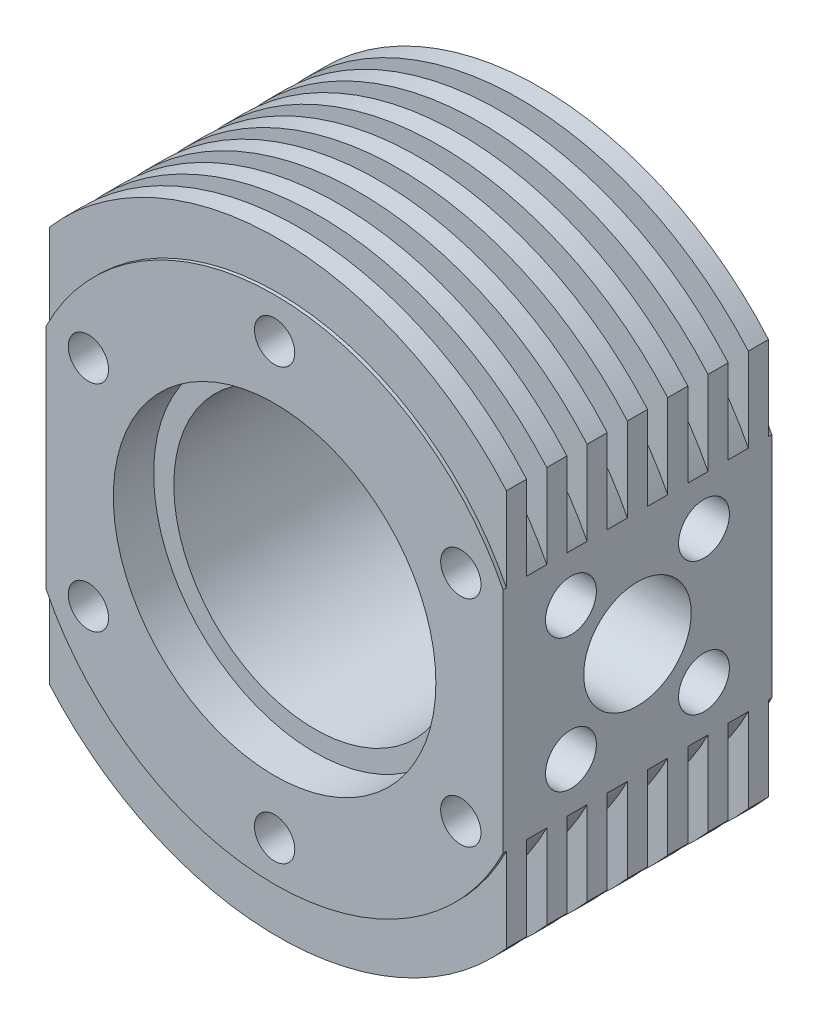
ISO-10303-21;
HEADER;
FILE_DESCRIPTION(('STEP AP214'),'2;1');
FILE_NAME('part.step','',(''),(''),'','','');
FILE_SCHEMA(('AUTOMOTIVE_DESIGN { 1 0 10303 214 1 1 1 1 }'));
ENDSEC;
DATA;
#1=APPLICATION_CONTEXT('core data for automotive mechanical design processes');
#2=APPLICATION_PROTOCOL_DEFINITION('international standard','automotive_design',2000,#1);
#3=PRODUCT_CONTEXT('',#1,'mechanical');
#4=PRODUCT('Part','Part','',(#3));
#5=PRODUCT_RELATED_PRODUCT_CATEGORY('part','',(#4));
#6=PRODUCT_DEFINITION_FORMATION('','',#4);
#7=PRODUCT_DEFINITION_CONTEXT('part definition',#1,'design');
#8=PRODUCT_DEFINITION('design','',#6,#7);
#9=PRODUCT_DEFINITION_SHAPE('','',#8);
#10=(LENGTH_UNIT() NAMED_UNIT(*) SI_UNIT(.MILLI.,.METRE.));
#11=(NAMED_UNIT(*) PLANE_ANGLE_UNIT() SI_UNIT($,.RADIAN.));
#12=(NAMED_UNIT(*) SI_UNIT($,.STERADIAN.) SOLID_ANGLE_UNIT());
#13=UNCERTAINTY_MEASURE_WITH_UNIT(LENGTH_MEASURE(1.E-05),#10,'distance_accuracy_value','');
#14=(GEOMETRIC_REPRESENTATION_CONTEXT(3) GLOBAL_UNCERTAINTY_ASSIGNED_CONTEXT((#13)) GLOBAL_UNIT_ASSIGNED_CONTEXT((#10,
#11,#12)) REPRESENTATION_CONTEXT('',''));
#15=CARTESIAN_POINT('',(0.,0.,0.));
#16=DIRECTION('',(0.,0.,1.));
#17=DIRECTION('',(1.,0.,0.));
#18=AXIS2_PLACEMENT_3D('',#15,#16,#17);
#19=CARTESIAN_POINT('',(13.,4.94974746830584,5.05025253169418));
#20=DIRECTION('',(1.,0.,0.));
#21=DIRECTION('',(0.,0.,-1.));
#22=AXIS2_PLACEMENT_3D('',#19,#20,#21);
#23=CYLINDRICAL_SURFACE('',#22,1.89249447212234);
#24=CARTESIAN_POINT('',(17.,4.94974746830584,5.05025253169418));
#25=DIRECTION('',(1.,0.,0.));
#26=DIRECTION('',(0.,0.,-1.));
#27=AXIS2_PLACEMENT_3D('',#24,#25,#26);
#28=CIRCLE('',#27,1.89249447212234);
#29=CARTESIAN_POINT('',(17.,4.94974746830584,3.15775805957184));
#30=VERTEX_POINT('',#29);
#31=EDGE_CURVE('E1195',#30,#30,#28,.T.);
#32=ORIENTED_EDGE('',*,*,#31,.T.);
#33=EDGE_LOOP('',(#32));
#34=FACE_BOUND('',#33,.T.);
#35=CARTESIAN_POINT('',(13.,4.94974746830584,5.05025253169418));
#36=DIRECTION('',(1.,0.,0.));
#37=DIRECTION('',(0.,0.,-1.));
#38=AXIS2_PLACEMENT_3D('',#35,#36,#37);
#39=CIRCLE('',#38,1.89249447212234);
#40=CARTESIAN_POINT('',(13.,4.94974746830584,3.15775805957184));
#41=VERTEX_POINT('',#40);
#42=EDGE_CURVE('E692',#41,#41,#39,.T.);
#43=ORIENTED_EDGE('',*,*,#42,.F.);
#44=EDGE_LOOP('',(#43));
#45=FACE_BOUND('',#44,.T.);
#46=CARTESIAN_POINT('',(13.5887437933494,6.5240742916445,4.));
#47=CARTESIAN_POINT('',(13.6120811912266,6.51983953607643,3.99365666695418));
#48=CARTESIAN_POINT('',(13.6357321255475,6.51612515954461,3.98816695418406));
#49=CARTESIAN_POINT('',(13.6835134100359,6.50980276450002,3.97890001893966));
#50=CARTESIAN_POINT('',(13.7076437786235,6.50719478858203,3.97512286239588));
#51=CARTESIAN_POINT('',(13.7792259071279,6.50123780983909,3.96652534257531));
#52=CARTESIAN_POINT('',(13.8271376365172,6.49952310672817,3.96410036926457));
#53=CARTESIAN_POINT('',(13.9167270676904,6.50063147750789,3.96567907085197));
#54=CARTESIAN_POINT('',(13.9584307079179,6.50291078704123,3.96891233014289));
#55=CARTESIAN_POINT('',(14.0417876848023,6.51088755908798,3.98048737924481));
#56=CARTESIAN_POINT('',(14.083417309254,6.51666326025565,3.98894619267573));
#57=CARTESIAN_POINT('',(14.1240691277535,6.5240742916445,3.99999999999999));
#58=B_SPLINE_CURVE_WITH_KNOTS('',3,(#46,#47,#48,#49,#50,#51,#52,#53,#54,#55,#56,#57),
.UNSPECIFIED.,.F.,.F.,(4,2,2,2,2,4),(0.,0.0736094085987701,0.147221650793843,0.290495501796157,
0.415743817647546,0.543904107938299),.UNSPECIFIED.);
#59=CARTESIAN_POINT('',(13.5887437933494,6.5240742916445,4.));
#60=VERTEX_POINT('',#59);
#61=CARTESIAN_POINT('',(14.1240691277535,6.5240742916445,4.));
#62=VERTEX_POINT('',#61);
#63=EDGE_CURVE('E12',#60,#62,#58,.T.);
#64=ORIENTED_EDGE('',*,*,#63,.F.);
#65=DIRECTION('',(1.,0.,0.));
#66=VECTOR('',#65,1.);
#67=CARTESIAN_POINT('',(13.,6.5240742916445,4.));
#68=LINE('',#67,#66);
#69=EDGE_CURVE('E49',#62,#60,#68,.F.);
#70=ORIENTED_EDGE('',*,*,#69,.F.);
#71=EDGE_LOOP('',(#64,#70));
#72=FACE_BOUND('',#71,.T.);
#73=ADVANCED_FACE('F35',(#34,#45,#72),#23,.F.);
#74=CARTESIAN_POINT('',(13.,-4.94974746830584,5.05025253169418));
#75=DIRECTION('',(1.,0.,0.));
#76=DIRECTION('',(0.,0.,-1.));
#77=AXIS2_PLACEMENT_3D('',#74,#75,#76);
#78=CYLINDRICAL_SURFACE('',#77,1.89249447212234);
#79=CARTESIAN_POINT('',(17.,-4.94974746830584,5.05025253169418));
#80=DIRECTION('',(1.,0.,0.));
#81=DIRECTION('',(0.,0.,1.));
#82=AXIS2_PLACEMENT_3D('',#79,#80,#81);
#83=CIRCLE('',#82,1.89249447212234);
#84=CARTESIAN_POINT('',(17.,-4.94974746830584,6.94274700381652));
#85=VERTEX_POINT('',#84);
#86=EDGE_CURVE('E1196',#85,#85,#83,.T.);
#87=ORIENTED_EDGE('',*,*,#86,.T.);
#88=EDGE_LOOP('',(#87));
#89=FACE_BOUND('',#88,.T.);
#90=CARTESIAN_POINT('',(13.,-4.94974746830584,5.05025253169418));
#91=DIRECTION('',(1.,0.,0.));
#92=DIRECTION('',(0.,0.,1.));
#93=AXIS2_PLACEMENT_3D('',#90,#91,#92);
#94=CIRCLE('',#93,1.89249447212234);
#95=CARTESIAN_POINT('',(13.,-4.94974746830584,6.94274700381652));
#96=VERTEX_POINT('',#95);
#97=EDGE_CURVE('E1192',#96,#96,#94,.T.);
#98=ORIENTED_EDGE('',*,*,#97,.F.);
#99=EDGE_LOOP('',(#98));
#100=FACE_BOUND('',#99,.T.);
#101=CARTESIAN_POINT('',(14.1240691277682,-6.5240742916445,4.));
#102=CARTESIAN_POINT('',(14.1007317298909,-6.5198395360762,3.99365666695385));
#103=CARTESIAN_POINT('',(14.0770807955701,-6.51612515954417,3.9881669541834));
#104=CARTESIAN_POINT('',(14.0292995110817,-6.50980276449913,3.97890001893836));
#105=CARTESIAN_POINT('',(14.005169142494,-6.50719478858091,3.97512286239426));
#106=CARTESIAN_POINT('',(13.9335870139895,-6.5012378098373,3.96652534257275));
#107=CARTESIAN_POINT('',(13.8856752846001,-6.49952310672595,3.96410036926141));
#108=CARTESIAN_POINT('',(13.7960858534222,-6.50063147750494,3.96567907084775));
#109=CARTESIAN_POINT('',(13.7543822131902,-6.50291078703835,3.96891233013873));
#110=CARTESIAN_POINT('',(13.6710252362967,-6.51088755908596,3.98048737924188));
#111=CARTESIAN_POINT('',(13.6293956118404,-6.51666326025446,3.98894619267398));
#112=CARTESIAN_POINT('',(13.5887437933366,-6.5240742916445,3.99999999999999));
#113=B_SPLINE_CURVE_WITH_KNOTS('',3,(#101,#102,#103,#104,#105,#106,#107,#108,#109,#110,#111,
#112),.UNSPECIFIED.,.F.,.F.,(4,2,2,2,2,4),(0.,0.0736094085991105,0.147221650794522,
0.290495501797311,0.415743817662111,0.543904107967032),.UNSPECIFIED.);
#114=CARTESIAN_POINT('',(14.1240691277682,-6.5240742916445,4.));
#115=VERTEX_POINT('',#114);
#116=CARTESIAN_POINT('',(13.5887437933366,-6.5240742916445,4.));
#117=VERTEX_POINT('',#116);
#118=EDGE_CURVE('E596',#115,#117,#113,.T.);
#119=ORIENTED_EDGE('',*,*,#118,.F.);
#120=DIRECTION('',(1.,0.,0.));
#121=VECTOR('',#120,1.);
#122=CARTESIAN_POINT('',(13.,-6.5240742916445,4.));
#123=LINE('',#122,#121);
#124=EDGE_CURVE('E569',#117,#115,#123,.T.);
#125=ORIENTED_EDGE('',*,*,#124,.F.);
#126=EDGE_LOOP('',(#119,#125));
#127=FACE_BOUND('',#126,.T.);
#128=ADVANCED_FACE('F559',(#89,#100,#127),#78,.F.);
#129=CARTESIAN_POINT('',(-13.,4.94974746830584,5.05025253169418));
#130=DIRECTION('',(-1.,0.,0.));
#131=DIRECTION('',(0.,0.,1.));
#132=AXIS2_PLACEMENT_3D('',#129,#130,#131);
#133=CYLINDRICAL_SURFACE('',#132,1.89249447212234);
#134=CARTESIAN_POINT('',(-13.,4.94974746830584,5.05025253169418));
#135=DIRECTION('',(1.,0.,0.));
#136=DIRECTION('',(0.,0.,-1.));
#137=AXIS2_PLACEMENT_3D('',#134,#135,#136);
#138=CIRCLE('',#137,1.89249447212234);
#139=CARTESIAN_POINT('',(-13.,4.94974746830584,3.15775805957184));
#140=VERTEX_POINT('',#139);
#141=EDGE_CURVE('E1180',#140,#140,#138,.T.);
#142=ORIENTED_EDGE('',*,*,#141,.T.);
#143=EDGE_LOOP('',(#142));
#144=FACE_BOUND('',#143,.T.);
#145=CARTESIAN_POINT('',(-17.,4.94974746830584,5.05025253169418));
#146=DIRECTION('',(1.,0.,0.));
#147=DIRECTION('',(0.,0.,-1.));
#148=AXIS2_PLACEMENT_3D('',#145,#146,#147);
#149=CIRCLE('',#148,1.89249447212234);
#150=CARTESIAN_POINT('',(-17.,4.94974746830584,3.15775805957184));
#151=VERTEX_POINT('',#150);
#152=EDGE_CURVE('E1163',#151,#151,#149,.T.);
#153=ORIENTED_EDGE('',*,*,#152,.F.);
#154=EDGE_LOOP('',(#153));
#155=FACE_BOUND('',#154,.T.);
#156=DIRECTION('',(-1.,0.,0.));
#157=VECTOR('',#156,1.);
#158=CARTESIAN_POINT('',(-13.,6.5240742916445,4.));
#159=LINE('',#158,#157);
#160=CARTESIAN_POINT('',(-14.1240691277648,6.5240742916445,4.));
#161=VERTEX_POINT('',#160);
#162=CARTESIAN_POINT('',(-13.5887437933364,6.5240742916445,4.));
#163=VERTEX_POINT('',#162);
#164=EDGE_CURVE('E484',#161,#163,#159,.F.);
#165=ORIENTED_EDGE('',*,*,#164,.T.);
#166=CARTESIAN_POINT('',(-13.5887437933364,6.5240742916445,4.));
#167=CARTESIAN_POINT('',(-13.6120811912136,6.51983953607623,3.99365666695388));
#168=CARTESIAN_POINT('',(-13.6357321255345,6.51612515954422,3.98816695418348));
#169=CARTESIAN_POINT('',(-13.6835134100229,6.50980276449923,3.97890001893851));
#170=CARTESIAN_POINT('',(-13.7076437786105,6.50719478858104,3.97512286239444));
#171=CARTESIAN_POINT('',(-13.779225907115,6.50123780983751,3.96652534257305));
#172=CARTESIAN_POINT('',(-13.8271376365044,6.49952310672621,3.96410036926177));
#173=CARTESIAN_POINT('',(-13.9167270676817,6.50063147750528,3.96567907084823));
#174=CARTESIAN_POINT('',(-13.9584307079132,6.50291078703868,3.96891233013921));
#175=CARTESIAN_POINT('',(-14.0417876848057,6.51088755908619,3.98048737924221));
#176=CARTESIAN_POINT('',(-14.0834173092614,6.5166632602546,3.98894619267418));
#177=CARTESIAN_POINT('',(-14.1240691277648,6.5240742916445,3.99999999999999));
#178=B_SPLINE_CURVE_WITH_KNOTS('',3,(#166,#167,#168,#169,#170,#171,#172,#173,#174,#175,#176,
#177),.UNSPECIFIED.,.F.,.F.,(4,2,2,2,2,4),(0.,0.0736094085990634,0.147221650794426,
0.290495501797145,0.415743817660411,0.543904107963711),.UNSPECIFIED.);
#179=EDGE_CURVE('E487',#163,#161,#178,.T.);
#180=ORIENTED_EDGE('',*,*,#179,.T.);
#181=EDGE_LOOP('',(#165,#180));
#182=FACE_BOUND('',#181,.T.);
#183=ADVANCED_FACE('F555',(#144,#155,#182),#133,.F.);
#184=CARTESIAN_POINT('',(-13.,-4.94974746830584,5.05025253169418));
#185=DIRECTION('',(-1.,0.,0.));
#186=DIRECTION('',(0.,0.,1.));
#187=AXIS2_PLACEMENT_3D('',#184,#185,#186);
#188=CYLINDRICAL_SURFACE('',#187,1.89249447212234);
#189=CARTESIAN_POINT('',(-13.,-4.94974746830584,5.05025253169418));
#190=DIRECTION('',(1.,0.,0.));
#191=DIRECTION('',(0.,0.,1.));
#192=AXIS2_PLACEMENT_3D('',#189,#190,#191);
#193=CIRCLE('',#192,1.89249447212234);
#194=CARTESIAN_POINT('',(-13.,-4.94974746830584,6.94274700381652));
#195=VERTEX_POINT('',#194);
#196=EDGE_CURVE('E1160',#195,#195,#193,.T.);
#197=ORIENTED_EDGE('',*,*,#196,.T.);
#198=EDGE_LOOP('',(#197));
#199=FACE_BOUND('',#198,.T.);
#200=CARTESIAN_POINT('',(-17.,-4.94974746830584,5.05025253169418));
#201=DIRECTION('',(1.,0.,0.));
#202=DIRECTION('',(0.,0.,1.));
#203=AXIS2_PLACEMENT_3D('',#200,#201,#202);
#204=CIRCLE('',#203,1.89249447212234);
#205=CARTESIAN_POINT('',(-17.,-4.94974746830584,6.94274700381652));
#206=VERTEX_POINT('',#205);
#207=EDGE_CURVE('E1164',#206,#206,#204,.T.);
#208=ORIENTED_EDGE('',*,*,#207,.F.);
#209=EDGE_LOOP('',(#208));
#210=FACE_BOUND('',#209,.T.);
#211=DIRECTION('',(-1.,0.,0.));
#212=VECTOR('',#211,1.);
#213=CARTESIAN_POINT('',(-13.,-6.5240742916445,4.));
#214=LINE('',#213,#212);
#215=CARTESIAN_POINT('',(-13.5887437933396,-6.5240742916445,4.));
#216=VERTEX_POINT('',#215);
#217=CARTESIAN_POINT('',(-14.1240691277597,-6.5240742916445,4.));
#218=VERTEX_POINT('',#217);
#219=EDGE_CURVE('E467',#216,#218,#214,.T.);
#220=ORIENTED_EDGE('',*,*,#219,.T.);
#221=CARTESIAN_POINT('',(-14.1240691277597,-6.5240742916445,4.));
#222=CARTESIAN_POINT('',(-14.1007317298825,-6.51983953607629,3.99365666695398));
#223=CARTESIAN_POINT('',(-14.0770807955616,-6.51612515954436,3.98816695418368));
#224=CARTESIAN_POINT('',(-14.0292995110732,-6.5098027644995,3.9789000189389));
#225=CARTESIAN_POINT('',(-14.0051691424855,-6.50719478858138,3.97512286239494));
#226=CARTESIAN_POINT('',(-13.933587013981,-6.50123780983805,3.96652534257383));
#227=CARTESIAN_POINT('',(-13.8856752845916,-6.49952310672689,3.96410036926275));
#228=CARTESIAN_POINT('',(-13.7960858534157,-6.50063147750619,3.96567907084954));
#229=CARTESIAN_POINT('',(-13.7543822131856,-6.50291078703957,3.9689123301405));
#230=CARTESIAN_POINT('',(-13.671025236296,-6.51088755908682,3.98048737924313));
#231=CARTESIAN_POINT('',(-13.6293956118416,-6.51666326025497,3.98894619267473));
#232=CARTESIAN_POINT('',(-13.5887437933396,-6.5240742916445,3.99999999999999));
#233=B_SPLINE_CURVE_WITH_KNOTS('',3,(#221,#222,#223,#224,#225,#226,#227,#228,#229,#230,#231,
#232),.UNSPECIFIED.,.F.,.F.,(4,2,2,2,2,4),(0.,0.0736094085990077,0.147221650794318,
0.290495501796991,0.415743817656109,0.543904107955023),.UNSPECIFIED.);
#234=EDGE_CURVE('E474',#218,#216,#233,.T.);
#235=ORIENTED_EDGE('',*,*,#234,.T.);
#236=EDGE_LOOP('',(#220,#235));
#237=FACE_BOUND('',#236,.T.);
#238=ADVANCED_FACE('F483',(#199,#210,#237),#188,.F.);
#239=CARTESIAN_POINT('',(17.,-14.7394029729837,20.));
#240=DIRECTION('',(-1.,0.,0.));
#241=DIRECTION('',(0.,0.,1.));
#242=AXIS2_PLACEMENT_3D('',#239,#240,#241);
#243=PLANE('',#242);
#244=CARTESIAN_POINT('',(17.,4.94974746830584,14.9497474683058));
#245=DIRECTION('',(1.,0.,0.));
#246=DIRECTION('',(0.,0.,1.));
#247=AXIS2_PLACEMENT_3D('',#244,#245,#246);
#248=CIRCLE('',#247,1.89249447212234);
#249=CARTESIAN_POINT('',(17.,4.94974746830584,16.8422419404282));
#250=VERTEX_POINT('',#249);
#251=EDGE_CURVE('E1191',#250,#250,#248,.T.);
#252=ORIENTED_EDGE('',*,*,#251,.F.);
#253=EDGE_LOOP('',(#252));
#254=FACE_BOUND('',#253,.T.);
#255=CARTESIAN_POINT('',(17.,-4.94974746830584,14.9497474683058));
#256=DIRECTION('',(1.,0.,0.));
#257=DIRECTION('',(0.,0.,-1.));
#258=AXIS2_PLACEMENT_3D('',#255,#256,#257);
#259=CIRCLE('',#258,1.89249447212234);
#260=CARTESIAN_POINT('',(17.,-4.94974746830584,13.0572529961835));
#261=VERTEX_POINT('',#260);
#262=EDGE_CURVE('E1202',#261,#261,#259,.T.);
#263=ORIENTED_EDGE('',*,*,#262,.F.);
#264=EDGE_LOOP('',(#263));
#265=FACE_BOUND('',#264,.T.);
#266=ORIENTED_EDGE('',*,*,#86,.F.);
#267=EDGE_LOOP('',(#266));
#268=FACE_BOUND('',#267,.T.);
#269=ORIENTED_EDGE('',*,*,#31,.F.);
#270=EDGE_LOOP('',(#269));
#271=FACE_BOUND('',#270,.T.);
#272=CARTESIAN_POINT('',(17.,0.,10.));
#273=DIRECTION('',(1.,0.,0.));
#274=DIRECTION('',(0.,0.,-1.));
#275=AXIS2_PLACEMENT_3D('',#272,#273,#274);
#276=CIRCLE('',#275,4.);
#277=CARTESIAN_POINT('',(17.,0.,6.));
#278=VERTEX_POINT('',#277);
#279=EDGE_CURVE('E691',#278,#278,#276,.T.);
#280=ORIENTED_EDGE('',*,*,#279,.F.);
#281=EDGE_LOOP('',(#280));
#282=FACE_BOUND('',#281,.T.);
#283=DIRECTION('',(0.,-1.,0.));
#284=VECTOR('',#283,1.);
#285=CARTESIAN_POINT('',(17.,-8.48528137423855,16.75));
#286=LINE('',#285,#284);
#287=CARTESIAN_POINT('',(17.,-8.48528137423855,16.75));
#288=VERTEX_POINT('',#287);
#289=CARTESIAN_POINT('',(17.,-14.7394029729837,16.75));
#290=VERTEX_POINT('',#289);
#291=EDGE_CURVE('E704',#288,#290,#286,.T.);
#292=ORIENTED_EDGE('',*,*,#291,.T.);
#293=DIRECTION('',(0.,0.,-1.));
#294=VECTOR('',#293,1.);
#295=CARTESIAN_POINT('',(17.,-14.7394029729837,20.));
#296=LINE('',#295,#294);
#297=CARTESIAN_POINT('',(17.,-14.7394029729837,15.25));
#298=VERTEX_POINT('',#297);
#299=EDGE_CURVE('E1103',#290,#298,#296,.T.);
#300=ORIENTED_EDGE('',*,*,#299,.T.);
#301=DIRECTION('',(0.,-1.,0.));
#302=VECTOR('',#301,1.);
#303=CARTESIAN_POINT('',(17.,-8.48528137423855,15.25));
#304=LINE('',#303,#302);
#305=CARTESIAN_POINT('',(17.,-8.48528137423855,15.25));
#306=VERTEX_POINT('',#305);
#307=EDGE_CURVE('E726',#306,#298,#304,.T.);
#308=ORIENTED_EDGE('',*,*,#307,.F.);
#309=DIRECTION('',(0.,0.,1.));
#310=VECTOR('',#309,1.);
#311=CARTESIAN_POINT('',(17.,-8.48528137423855,13.75));
#312=LINE('',#311,#310);
#313=CARTESIAN_POINT('',(17.,-8.48528137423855,13.75));
#314=VERTEX_POINT('',#313);
#315=EDGE_CURVE('E712',#314,#306,#312,.T.);
#316=ORIENTED_EDGE('',*,*,#315,.F.);
#317=DIRECTION('',(0.,-1.,0.));
#318=VECTOR('',#317,1.);
#319=CARTESIAN_POINT('',(17.,-8.48528137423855,13.75));
#320=LINE('',#319,#318);
#321=CARTESIAN_POINT('',(17.,-14.7394029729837,13.75));
#322=VERTEX_POINT('',#321);
#323=EDGE_CURVE('E732',#314,#322,#320,.T.);
#324=ORIENTED_EDGE('',*,*,#323,.T.);
#325=CARTESIAN_POINT('',(17.,-14.7394029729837,12.25));
#326=VERTEX_POINT('',#325);
#327=EDGE_CURVE('E1233',#322,#326,#296,.T.);
#328=ORIENTED_EDGE('',*,*,#327,.T.);
#329=DIRECTION('',(0.,-1.,0.));
#330=VECTOR('',#329,1.);
#331=CARTESIAN_POINT('',(17.,-8.48528137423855,12.25));
#332=LINE('',#331,#330);
#333=CARTESIAN_POINT('',(17.,-8.48528137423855,12.25));
#334=VERTEX_POINT('',#333);
#335=EDGE_CURVE('E752',#334,#326,#332,.T.);
#336=ORIENTED_EDGE('',*,*,#335,.F.);
#337=DIRECTION('',(0.,0.,1.));
#338=VECTOR('',#337,1.);
#339=CARTESIAN_POINT('',(17.,-8.48528137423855,10.75));
#340=LINE('',#339,#338);
#341=CARTESIAN_POINT('',(17.,-8.48528137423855,10.75));
#342=VERTEX_POINT('',#341);
#343=EDGE_CURVE('E740',#342,#334,#340,.T.);
#344=ORIENTED_EDGE('',*,*,#343,.F.);
#345=DIRECTION('',(0.,-1.,0.));
#346=VECTOR('',#345,1.);
#347=CARTESIAN_POINT('',(17.,-8.48528137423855,10.75));
#348=LINE('',#347,#346);
#349=CARTESIAN_POINT('',(17.,-14.7394029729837,10.75));
#350=VERTEX_POINT('',#349);
#351=EDGE_CURVE('E758',#342,#350,#348,.T.);
#352=ORIENTED_EDGE('',*,*,#351,.T.);
#353=CARTESIAN_POINT('',(17.,-14.7394029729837,9.25));
#354=VERTEX_POINT('',#353);
#355=EDGE_CURVE('E1235',#350,#354,#296,.T.);
#356=ORIENTED_EDGE('',*,*,#355,.T.);
#357=DIRECTION('',(0.,-1.,0.));
#358=VECTOR('',#357,1.);
#359=CARTESIAN_POINT('',(17.,-8.48528137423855,9.25));
#360=LINE('',#359,#358);
#361=CARTESIAN_POINT('',(17.,-8.48528137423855,9.25));
#362=VERTEX_POINT('',#361);
#363=EDGE_CURVE('E778',#362,#354,#360,.T.);
#364=ORIENTED_EDGE('',*,*,#363,.F.);
#365=DIRECTION('',(0.,0.,1.));
#366=VECTOR('',#365,1.);
#367=CARTESIAN_POINT('',(17.,-8.48528137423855,7.75));
#368=LINE('',#367,#366);
#369=CARTESIAN_POINT('',(17.,-8.48528137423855,7.75));
#370=VERTEX_POINT('',#369);
#371=EDGE_CURVE('E766',#370,#362,#368,.T.);
#372=ORIENTED_EDGE('',*,*,#371,.F.);
#373=DIRECTION('',(0.,-1.,0.));
#374=VECTOR('',#373,1.);
#375=CARTESIAN_POINT('',(17.,-8.48528137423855,7.75));
#376=LINE('',#375,#374);
#377=CARTESIAN_POINT('',(17.,-14.7394029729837,7.75));
#378=VERTEX_POINT('',#377);
#379=EDGE_CURVE('E784',#370,#378,#376,.T.);
#380=ORIENTED_EDGE('',*,*,#379,.T.);
#381=CARTESIAN_POINT('',(17.,-14.7394029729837,6.25));
#382=VERTEX_POINT('',#381);
#383=EDGE_CURVE('E1239',#378,#382,#296,.T.);
#384=ORIENTED_EDGE('',*,*,#383,.T.);
#385=DIRECTION('',(0.,-1.,0.));
#386=VECTOR('',#385,1.);
#387=CARTESIAN_POINT('',(17.,-8.48528137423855,6.25));
#388=LINE('',#387,#386);
#389=CARTESIAN_POINT('',(17.,-8.48528137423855,6.25));
#390=VERTEX_POINT('',#389);
#391=EDGE_CURVE('E804',#390,#382,#388,.T.);
#392=ORIENTED_EDGE('',*,*,#391,.F.);
#393=DIRECTION('',(0.,0.,1.));
#394=VECTOR('',#393,1.);
#395=CARTESIAN_POINT('',(17.,-8.48528137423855,4.75));
#396=LINE('',#395,#394);
#397=CARTESIAN_POINT('',(17.,-8.48528137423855,4.75));
#398=VERTEX_POINT('',#397);
#399=EDGE_CURVE('E792',#398,#390,#396,.T.);
#400=ORIENTED_EDGE('',*,*,#399,.F.);
#401=DIRECTION('',(0.,-1.,0.));
#402=VECTOR('',#401,1.);
#403=CARTESIAN_POINT('',(17.,-8.48528137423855,4.75));
#404=LINE('',#403,#402);
#405=CARTESIAN_POINT('',(17.,-14.7394029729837,4.75));
#406=VERTEX_POINT('',#405);
#407=EDGE_CURVE('E810',#398,#406,#404,.T.);
#408=ORIENTED_EDGE('',*,*,#407,.T.);
#409=CARTESIAN_POINT('',(17.,-14.7394029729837,3.25));
#410=VERTEX_POINT('',#409);
#411=EDGE_CURVE('E1243',#406,#410,#296,.T.);
#412=ORIENTED_EDGE('',*,*,#411,.T.);
#413=DIRECTION('',(0.,-1.,0.));
#414=VECTOR('',#413,1.);
#415=CARTESIAN_POINT('',(17.,-8.48528137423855,3.25));
#416=LINE('',#415,#414);
#417=CARTESIAN_POINT('',(17.,-8.48528137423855,3.25));
#418=VERTEX_POINT('',#417);
#419=EDGE_CURVE('E830',#418,#410,#416,.T.);
#420=ORIENTED_EDGE('',*,*,#419,.F.);
#421=DIRECTION('',(0.,0.,1.));
#422=VECTOR('',#421,1.);
#423=CARTESIAN_POINT('',(17.,-8.48528137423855,1.75));
#424=LINE('',#423,#422);
#425=CARTESIAN_POINT('',(17.,-8.48528137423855,1.75));
#426=VERTEX_POINT('',#425);
#427=EDGE_CURVE('E818',#426,#418,#424,.T.);
#428=ORIENTED_EDGE('',*,*,#427,.F.);
#429=DIRECTION('',(0.,-1.,0.));
#430=VECTOR('',#429,1.);
#431=CARTESIAN_POINT('',(17.,-8.48528137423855,1.75));
#432=LINE('',#431,#430);
#433=CARTESIAN_POINT('',(17.,-14.7394029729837,1.75));
#434=VERTEX_POINT('',#433);
#435=EDGE_CURVE('E836',#426,#434,#432,.T.);
#436=ORIENTED_EDGE('',*,*,#435,.T.);
#437=CARTESIAN_POINT('',(17.,-14.7394029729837,0.25));
#438=VERTEX_POINT('',#437);
#439=EDGE_CURVE('E1097',#434,#438,#296,.T.);
#440=ORIENTED_EDGE('',*,*,#439,.T.);
#441=DIRECTION('',(0.,-1.,0.));
#442=VECTOR('',#441,1.);
#443=CARTESIAN_POINT('',(17.,-14.7394029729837,0.25));
#444=LINE('',#443,#442);
#445=CARTESIAN_POINT('',(17.,-8.48528137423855,0.25));
#446=VERTEX_POINT('',#445);
#447=EDGE_CURVE('E1058',#446,#438,#444,.T.);
#448=ORIENTED_EDGE('',*,*,#447,.F.);
#449=DIRECTION('',(0.,0.,-1.));
#450=VECTOR('',#449,1.);
#451=CARTESIAN_POINT('',(17.,-8.48528137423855,0.25));
#452=LINE('',#451,#450);
#453=CARTESIAN_POINT('',(17.,-8.48528137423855,0.));
#454=VERTEX_POINT('',#453);
#455=EDGE_CURVE('E1043',#454,#446,#452,.F.);
#456=ORIENTED_EDGE('',*,*,#455,.F.);
#457=DIRECTION('',(0.,1.,0.));
#458=VECTOR('',#457,1.);
#459=CARTESIAN_POINT('',(17.,-14.7394029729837,0.));
#460=LINE('',#459,#458);
#461=CARTESIAN_POINT('',(17.,8.48528137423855,0.));
#462=VERTEX_POINT('',#461);
#463=EDGE_CURVE('E1071',#454,#462,#460,.T.);
#464=ORIENTED_EDGE('',*,*,#463,.T.);
#465=DIRECTION('',(0.,0.,-1.));
#466=VECTOR('',#465,1.);
#467=CARTESIAN_POINT('',(17.,8.48528137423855,0.25));
#468=LINE('',#467,#466);
#469=CARTESIAN_POINT('',(17.,8.48528137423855,0.25));
#470=VERTEX_POINT('',#469);
#471=EDGE_CURVE('E1050',#470,#462,#468,.T.);
#472=ORIENTED_EDGE('',*,*,#471,.F.);
#473=CARTESIAN_POINT('',(17.,14.7394029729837,0.25));
#474=VERTEX_POINT('',#473);
#475=EDGE_CURVE('E1055',#474,#470,#444,.T.);
#476=ORIENTED_EDGE('',*,*,#475,.F.);
#477=DIRECTION('',(0.,0.,-1.));
#478=VECTOR('',#477,1.);
#479=CARTESIAN_POINT('',(17.,14.7394029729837,20.));
#480=LINE('',#479,#478);
#481=CARTESIAN_POINT('',(17.,14.7394029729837,1.75));
#482=VERTEX_POINT('',#481);
#483=EDGE_CURVE('E1092',#482,#474,#480,.T.);
#484=ORIENTED_EDGE('',*,*,#483,.F.);
#485=DIRECTION('',(0.,1.,0.));
#486=VECTOR('',#485,1.);
#487=CARTESIAN_POINT('',(17.,8.48528137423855,1.75));
#488=LINE('',#487,#486);
#489=CARTESIAN_POINT('',(17.,8.48528137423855,1.75));
#490=VERTEX_POINT('',#489);
#491=EDGE_CURVE('E968',#490,#482,#488,.T.);
#492=ORIENTED_EDGE('',*,*,#491,.F.);
#493=DIRECTION('',(0.,0.,1.));
#494=VECTOR('',#493,1.);
#495=CARTESIAN_POINT('',(17.,8.48528137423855,1.75));
#496=LINE('',#495,#494);
#497=CARTESIAN_POINT('',(17.,8.48528137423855,3.25));
#498=VERTEX_POINT('',#497);
#499=EDGE_CURVE('E976',#490,#498,#496,.T.);
#500=ORIENTED_EDGE('',*,*,#499,.T.);
#501=DIRECTION('',(0.,1.,0.));
#502=VECTOR('',#501,1.);
#503=CARTESIAN_POINT('',(17.,8.48528137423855,3.25));
#504=LINE('',#503,#502);
#505=CARTESIAN_POINT('',(17.,14.7394029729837,3.25));
#506=VERTEX_POINT('',#505);
#507=EDGE_CURVE('E979',#498,#506,#504,.T.);
#508=ORIENTED_EDGE('',*,*,#507,.T.);
#509=CARTESIAN_POINT('',(17.,14.7394029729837,4.75));
#510=VERTEX_POINT('',#509);
#511=EDGE_CURVE('E1496',#510,#506,#480,.T.);
#512=ORIENTED_EDGE('',*,*,#511,.F.);
#513=DIRECTION('',(0.,1.,0.));
#514=VECTOR('',#513,1.);
#515=CARTESIAN_POINT('',(17.,8.48528137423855,4.75));
#516=LINE('',#515,#514);
#517=CARTESIAN_POINT('',(17.,8.48528137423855,4.75));
#518=VERTEX_POINT('',#517);
#519=EDGE_CURVE('E940',#518,#510,#516,.T.);
#520=ORIENTED_EDGE('',*,*,#519,.F.);
#521=DIRECTION('',(0.,0.,1.));
#522=VECTOR('',#521,1.);
#523=CARTESIAN_POINT('',(17.,8.48528137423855,4.75));
#524=LINE('',#523,#522);
#525=CARTESIAN_POINT('',(17.,8.48528137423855,6.25));
#526=VERTEX_POINT('',#525);
#527=EDGE_CURVE('E948',#518,#526,#524,.T.);
#528=ORIENTED_EDGE('',*,*,#527,.T.);
#529=DIRECTION('',(0.,1.,0.));
#530=VECTOR('',#529,1.);
#531=CARTESIAN_POINT('',(17.,8.48528137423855,6.25));
#532=LINE('',#531,#530);
#533=CARTESIAN_POINT('',(17.,14.7394029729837,6.25));
#534=VERTEX_POINT('',#533);
#535=EDGE_CURVE('E952',#526,#534,#532,.T.);
#536=ORIENTED_EDGE('',*,*,#535,.T.);
#537=CARTESIAN_POINT('',(17.,14.7394029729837,7.75));
#538=VERTEX_POINT('',#537);
#539=EDGE_CURVE('E1491',#538,#534,#480,.T.);
#540=ORIENTED_EDGE('',*,*,#539,.F.);
#541=DIRECTION('',(0.,1.,0.));
#542=VECTOR('',#541,1.);
#543=CARTESIAN_POINT('',(17.,8.48528137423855,7.75));
#544=LINE('',#543,#542);
#545=CARTESIAN_POINT('',(17.,8.48528137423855,7.75));
#546=VERTEX_POINT('',#545);
#547=EDGE_CURVE('E912',#546,#538,#544,.T.);
#548=ORIENTED_EDGE('',*,*,#547,.F.);
#549=DIRECTION('',(0.,0.,1.));
#550=VECTOR('',#549,1.);
#551=CARTESIAN_POINT('',(17.,8.48528137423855,7.75));
#552=LINE('',#551,#550);
#553=CARTESIAN_POINT('',(17.,8.48528137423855,9.25));
#554=VERTEX_POINT('',#553);
#555=EDGE_CURVE('E920',#546,#554,#552,.T.);
#556=ORIENTED_EDGE('',*,*,#555,.T.);
#557=DIRECTION('',(0.,1.,0.));
#558=VECTOR('',#557,1.);
#559=CARTESIAN_POINT('',(17.,8.48528137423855,9.25));
#560=LINE('',#559,#558);
#561=CARTESIAN_POINT('',(17.,14.7394029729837,9.25));
#562=VERTEX_POINT('',#561);
#563=EDGE_CURVE('E924',#554,#562,#560,.T.);
#564=ORIENTED_EDGE('',*,*,#563,.T.);
#565=CARTESIAN_POINT('',(17.,14.7394029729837,10.75));
#566=VERTEX_POINT('',#565);
#567=EDGE_CURVE('E1487',#566,#562,#480,.T.);
#568=ORIENTED_EDGE('',*,*,#567,.F.);
#569=DIRECTION('',(0.,1.,0.));
#570=VECTOR('',#569,1.);
#571=CARTESIAN_POINT('',(17.,8.48528137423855,10.75));
#572=LINE('',#571,#570);
#573=CARTESIAN_POINT('',(17.,8.48528137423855,10.75));
#574=VERTEX_POINT('',#573);
#575=EDGE_CURVE('E884',#574,#566,#572,.T.);
#576=ORIENTED_EDGE('',*,*,#575,.F.);
#577=DIRECTION('',(0.,0.,1.));
#578=VECTOR('',#577,1.);
#579=CARTESIAN_POINT('',(17.,8.48528137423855,10.75));
#580=LINE('',#579,#578);
#581=CARTESIAN_POINT('',(17.,8.48528137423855,12.25));
#582=VERTEX_POINT('',#581);
#583=EDGE_CURVE('E892',#574,#582,#580,.T.);
#584=ORIENTED_EDGE('',*,*,#583,.T.);
#585=DIRECTION('',(0.,1.,0.));
#586=VECTOR('',#585,1.);
#587=CARTESIAN_POINT('',(17.,8.48528137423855,12.25));
#588=LINE('',#587,#586);
#589=CARTESIAN_POINT('',(17.,14.7394029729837,12.25));
#590=VERTEX_POINT('',#589);
#591=EDGE_CURVE('E896',#582,#590,#588,.T.);
#592=ORIENTED_EDGE('',*,*,#591,.T.);
#593=CARTESIAN_POINT('',(17.,14.7394029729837,13.75));
#594=VERTEX_POINT('',#593);
#595=EDGE_CURVE('E1485',#594,#590,#480,.T.);
#596=ORIENTED_EDGE('',*,*,#595,.F.);
#597=DIRECTION('',(0.,1.,0.));
#598=VECTOR('',#597,1.);
#599=CARTESIAN_POINT('',(17.,8.48528137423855,13.75));
#600=LINE('',#599,#598);
#601=CARTESIAN_POINT('',(17.,8.48528137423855,13.75));
#602=VERTEX_POINT('',#601);
#603=EDGE_CURVE('E854',#602,#594,#600,.T.);
#604=ORIENTED_EDGE('',*,*,#603,.F.);
#605=DIRECTION('',(0.,0.,1.));
#606=VECTOR('',#605,1.);
#607=CARTESIAN_POINT('',(17.,8.48528137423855,13.75));
#608=LINE('',#607,#606);
#609=CARTESIAN_POINT('',(17.,8.48528137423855,15.25));
#610=VERTEX_POINT('',#609);
#611=EDGE_CURVE('E862',#602,#610,#608,.T.);
#612=ORIENTED_EDGE('',*,*,#611,.T.);
#613=DIRECTION('',(0.,1.,0.));
#614=VECTOR('',#613,1.);
#615=CARTESIAN_POINT('',(17.,8.48528137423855,15.25));
#616=LINE('',#615,#614);
#617=CARTESIAN_POINT('',(17.,14.7394029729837,15.25));
#618=VERTEX_POINT('',#617);
#619=EDGE_CURVE('E866',#610,#618,#616,.T.);
#620=ORIENTED_EDGE('',*,*,#619,.T.);
#621=CARTESIAN_POINT('',(17.,14.7394029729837,16.75));
#622=VERTEX_POINT('',#621);
#623=EDGE_CURVE('E1098',#622,#618,#480,.T.);
#624=ORIENTED_EDGE('',*,*,#623,.F.);
#625=DIRECTION('',(0.,1.,0.));
#626=VECTOR('',#625,1.);
#627=CARTESIAN_POINT('',(17.,8.48528137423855,16.75));
#628=LINE('',#627,#626);
#629=CARTESIAN_POINT('',(17.,8.48528137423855,16.75));
#630=VERTEX_POINT('',#629);
#631=EDGE_CURVE('E994',#630,#622,#628,.T.);
#632=ORIENTED_EDGE('',*,*,#631,.F.);
#633=DIRECTION('',(0.,0.,1.));
#634=VECTOR('',#633,1.);
#635=CARTESIAN_POINT('',(17.,8.48528137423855,16.75));
#636=LINE('',#635,#634);
#637=CARTESIAN_POINT('',(17.,8.48528137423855,18.25));
#638=VERTEX_POINT('',#637);
#639=EDGE_CURVE('E1002',#630,#638,#636,.T.);
#640=ORIENTED_EDGE('',*,*,#639,.T.);
#641=DIRECTION('',(0.,1.,0.));
#642=VECTOR('',#641,1.);
#643=CARTESIAN_POINT('',(17.,8.48528137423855,18.25));
#644=LINE('',#643,#642);
#645=CARTESIAN_POINT('',(17.,14.7394029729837,18.25));
#646=VERTEX_POINT('',#645);
#647=EDGE_CURVE('E1005',#638,#646,#644,.T.);
#648=ORIENTED_EDGE('',*,*,#647,.T.);
#649=CARTESIAN_POINT('',(17.,14.7394029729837,19.75));
#650=VERTEX_POINT('',#649);
#651=EDGE_CURVE('E1094',#650,#646,#480,.T.);
#652=ORIENTED_EDGE('',*,*,#651,.F.);
#653=DIRECTION('',(0.,1.,0.));
#654=VECTOR('',#653,1.);
#655=CARTESIAN_POINT('',(17.,-14.7394029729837,19.75));
#656=LINE('',#655,#654);
#657=CARTESIAN_POINT('',(17.,8.48528137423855,19.75));
#658=VERTEX_POINT('',#657);
#659=EDGE_CURVE('E1038',#658,#650,#656,.T.);
#660=ORIENTED_EDGE('',*,*,#659,.F.);
#661=DIRECTION('',(0.,0.,1.));
#662=VECTOR('',#661,1.);
#663=CARTESIAN_POINT('',(17.,8.48528137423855,19.75));
#664=LINE('',#663,#662);
#665=CARTESIAN_POINT('',(17.,8.48528137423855,20.));
#666=VERTEX_POINT('',#665);
#667=EDGE_CURVE('E1029',#666,#658,#664,.F.);
#668=ORIENTED_EDGE('',*,*,#667,.F.);
#669=DIRECTION('',(0.,1.,0.));
#670=VECTOR('',#669,1.);
#671=CARTESIAN_POINT('',(17.,-14.7394029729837,20.));
#672=LINE('',#671,#670);
#673=CARTESIAN_POINT('',(17.,-8.48528137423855,20.));
#674=VERTEX_POINT('',#673);
#675=EDGE_CURVE('E1072',#674,#666,#672,.T.);
#676=ORIENTED_EDGE('',*,*,#675,.F.);
#677=DIRECTION('',(0.,0.,1.));
#678=VECTOR('',#677,1.);
#679=CARTESIAN_POINT('',(17.,-8.48528137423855,19.75));
#680=LINE('',#679,#678);
#681=CARTESIAN_POINT('',(17.,-8.48528137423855,19.75));
#682=VERTEX_POINT('',#681);
#683=EDGE_CURVE('E1031',#682,#674,#680,.T.);
#684=ORIENTED_EDGE('',*,*,#683,.F.);
#685=CARTESIAN_POINT('',(17.,-14.7394029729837,19.75));
#686=VERTEX_POINT('',#685);
#687=EDGE_CURVE('E1035',#686,#682,#656,.T.);
#688=ORIENTED_EDGE('',*,*,#687,.F.);
#689=CARTESIAN_POINT('',(17.,-14.7394029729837,18.25));
#690=VERTEX_POINT('',#689);
#691=EDGE_CURVE('E1099',#686,#690,#296,.T.);
#692=ORIENTED_EDGE('',*,*,#691,.T.);
#693=DIRECTION('',(0.,-1.,0.));
#694=VECTOR('',#693,1.);
#695=CARTESIAN_POINT('',(17.,-8.48528137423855,18.25));
#696=LINE('',#695,#694);
#697=CARTESIAN_POINT('',(17.,-8.48528137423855,18.25));
#698=VERTEX_POINT('',#697);
#699=EDGE_CURVE('E698',#698,#690,#696,.T.);
#700=ORIENTED_EDGE('',*,*,#699,.F.);
#701=DIRECTION('',(0.,0.,1.));
#702=VECTOR('',#701,1.);
#703=CARTESIAN_POINT('',(17.,-8.48528137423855,16.75));
#704=LINE('',#703,#702);
#705=EDGE_CURVE('E717',#288,#698,#704,.T.);
#706=ORIENTED_EDGE('',*,*,#705,.F.);
#707=EDGE_LOOP('',(#292,#300,#308,#316,#324,#328,#336,#344,#352,#356,#364,#372,#380,#384,#392,
#400,#408,#412,#420,#428,#436,#440,#448,#456,#464,#472,#476,#484,#492,#500,#508,#512,#520,#528,
#536,#540,#548,#556,#564,#568,#576,#584,#592,#596,#604,#612,#620,#624,#632,#640,#648,#652,#660,
#668,#676,#684,#688,#692,#700,#706));
#708=FACE_BOUND('',#707,.T.);
#709=ADVANCED_FACE('F1213',(#254,#265,#268,#271,#282,#708),#243,.F.);
#710=CARTESIAN_POINT('',(-17.,-14.7394029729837,20.));
#711=DIRECTION('',(1.,0.,0.));
#712=DIRECTION('',(0.,0.,-1.));
#713=AXIS2_PLACEMENT_3D('',#710,#711,#712);
#714=PLANE('',#713);
#715=CARTESIAN_POINT('',(-17.,4.94974746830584,14.9497474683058));
#716=DIRECTION('',(1.,0.,0.));
#717=DIRECTION('',(0.,0.,1.));
#718=AXIS2_PLACEMENT_3D('',#715,#716,#717);
#719=CIRCLE('',#718,1.89249447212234);
#720=CARTESIAN_POINT('',(-17.,4.94974746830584,16.8422419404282));
#721=VERTEX_POINT('',#720);
#722=EDGE_CURVE('E1176',#721,#721,#719,.T.);
#723=ORIENTED_EDGE('',*,*,#722,.T.);
#724=EDGE_LOOP('',(#723));
#725=FACE_BOUND('',#724,.T.);
#726=CARTESIAN_POINT('',(-17.,-4.94974746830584,14.9497474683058));
#727=DIRECTION('',(1.,0.,0.));
#728=DIRECTION('',(0.,0.,-1.));
#729=AXIS2_PLACEMENT_3D('',#726,#727,#728);
#730=CIRCLE('',#729,1.89249447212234);
#731=CARTESIAN_POINT('',(-17.,-4.94974746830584,13.0572529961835));
#732=VERTEX_POINT('',#731);
#733=EDGE_CURVE('E1170',#732,#732,#730,.T.);
#734=ORIENTED_EDGE('',*,*,#733,.T.);
#735=EDGE_LOOP('',(#734));
#736=FACE_BOUND('',#735,.T.);
#737=ORIENTED_EDGE('',*,*,#207,.T.);
#738=EDGE_LOOP('',(#737));
#739=FACE_BOUND('',#738,.T.);
#740=ORIENTED_EDGE('',*,*,#152,.T.);
#741=EDGE_LOOP('',(#740));
#742=FACE_BOUND('',#741,.T.);
#743=CARTESIAN_POINT('',(-17.,0.,10.));
#744=DIRECTION('',(-1.,0.,0.));
#745=DIRECTION('',(0.,0.,1.));
#746=AXIS2_PLACEMENT_3D('',#743,#744,#745);
#747=CIRCLE('',#746,3.);
#748=CARTESIAN_POINT('',(-17.,0.,13.));
#749=VERTEX_POINT('',#748);
#750=EDGE_CURVE('E1183',#749,#749,#747,.T.);
#751=ORIENTED_EDGE('',*,*,#750,.F.);
#752=EDGE_LOOP('',(#751));
#753=FACE_BOUND('',#752,.T.);
#754=DIRECTION('',(0.,1.,0.));
#755=VECTOR('',#754,1.);
#756=CARTESIAN_POINT('',(-17.,-14.7394029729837,16.75));
#757=LINE('',#756,#755);
#758=CARTESIAN_POINT('',(-17.,-14.7394029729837,16.75));
#759=VERTEX_POINT('',#758);
#760=CARTESIAN_POINT('',(-17.,-8.48528137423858,16.75));
#761=VERTEX_POINT('',#760);
#762=EDGE_CURVE('E697',#759,#761,#757,.T.);
#763=ORIENTED_EDGE('',*,*,#762,.T.);
#764=DIRECTION('',(0.,0.,1.));
#765=VECTOR('',#764,1.);
#766=CARTESIAN_POINT('',(-17.,-8.48528137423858,16.75));
#767=LINE('',#766,#765);
#768=CARTESIAN_POINT('',(-17.,-8.48528137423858,18.25));
#769=VERTEX_POINT('',#768);
#770=EDGE_CURVE('E707',#761,#769,#767,.T.);
#771=ORIENTED_EDGE('',*,*,#770,.T.);
#772=DIRECTION('',(0.,1.,0.));
#773=VECTOR('',#772,1.);
#774=CARTESIAN_POINT('',(-17.,-14.7394029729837,18.25));
#775=LINE('',#774,#773);
#776=CARTESIAN_POINT('',(-17.,-14.7394029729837,18.25));
#777=VERTEX_POINT('',#776);
#778=EDGE_CURVE('E711',#777,#769,#775,.T.);
#779=ORIENTED_EDGE('',*,*,#778,.F.);
#780=DIRECTION('',(0.,0.,-1.));
#781=VECTOR('',#780,1.);
#782=CARTESIAN_POINT('',(-17.,-14.7394029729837,20.));
#783=LINE('',#782,#781);
#784=CARTESIAN_POINT('',(-17.,-14.7394029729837,19.75));
#785=VERTEX_POINT('',#784);
#786=EDGE_CURVE('E1084',#785,#777,#783,.T.);
#787=ORIENTED_EDGE('',*,*,#786,.F.);
#788=DIRECTION('',(0.,-1.,0.));
#789=VECTOR('',#788,1.);
#790=CARTESIAN_POINT('',(-17.,-14.7394029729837,19.75));
#791=LINE('',#790,#789);
#792=CARTESIAN_POINT('',(-17.,-8.48528137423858,19.75));
#793=VERTEX_POINT('',#792);
#794=EDGE_CURVE('E1115',#793,#785,#791,.T.);
#795=ORIENTED_EDGE('',*,*,#794,.F.);
#796=DIRECTION('',(0.,0.,1.));
#797=VECTOR('',#796,1.);
#798=CARTESIAN_POINT('',(-17.,-8.48528137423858,19.75));
#799=LINE('',#798,#797);
#800=CARTESIAN_POINT('',(-17.,-8.48528137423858,20.));
#801=VERTEX_POINT('',#800);
#802=EDGE_CURVE('E1022',#801,#793,#799,.F.);
#803=ORIENTED_EDGE('',*,*,#802,.F.);
#804=DIRECTION('',(0.,-1.,0.));
#805=VECTOR('',#804,1.);
#806=CARTESIAN_POINT('',(-17.,-14.7394029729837,20.));
#807=LINE('',#806,#805);
#808=CARTESIAN_POINT('',(-17.,8.48528137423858,20.));
#809=VERTEX_POINT('',#808);
#810=EDGE_CURVE('E1075',#809,#801,#807,.T.);
#811=ORIENTED_EDGE('',*,*,#810,.F.);
#812=DIRECTION('',(0.,0.,1.));
#813=VECTOR('',#812,1.);
#814=CARTESIAN_POINT('',(-17.,8.48528137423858,19.75));
#815=LINE('',#814,#813);
#816=CARTESIAN_POINT('',(-17.,8.48528137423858,19.75));
#817=VERTEX_POINT('',#816);
#818=EDGE_CURVE('E1027',#817,#809,#815,.T.);
#819=ORIENTED_EDGE('',*,*,#818,.F.);
#820=CARTESIAN_POINT('',(-17.,14.7394029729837,19.75));
#821=VERTEX_POINT('',#820);
#822=EDGE_CURVE('E1116',#821,#817,#791,.T.);
#823=ORIENTED_EDGE('',*,*,#822,.F.);
#824=DIRECTION('',(0.,0.,-1.));
#825=VECTOR('',#824,1.);
#826=CARTESIAN_POINT('',(-17.,14.7394029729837,20.));
#827=LINE('',#826,#825);
#828=CARTESIAN_POINT('',(-17.,14.7394029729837,18.25));
#829=VERTEX_POINT('',#828);
#830=EDGE_CURVE('E1089',#821,#829,#827,.T.);
#831=ORIENTED_EDGE('',*,*,#830,.T.);
#832=DIRECTION('',(0.,-1.,0.));
#833=VECTOR('',#832,1.);
#834=CARTESIAN_POINT('',(-17.,14.7394029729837,18.25));
#835=LINE('',#834,#833);
#836=CARTESIAN_POINT('',(-17.,8.48528137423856,18.25));
#837=VERTEX_POINT('',#836);
#838=EDGE_CURVE('E995',#829,#837,#835,.T.);
#839=ORIENTED_EDGE('',*,*,#838,.T.);
#840=DIRECTION('',(0.,0.,1.));
#841=VECTOR('',#840,1.);
#842=CARTESIAN_POINT('',(-17.,8.48528137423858,16.75));
#843=LINE('',#842,#841);
#844=CARTESIAN_POINT('',(-17.,8.48528137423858,16.75));
#845=VERTEX_POINT('',#844);
#846=EDGE_CURVE('E1013',#845,#837,#843,.T.);
#847=ORIENTED_EDGE('',*,*,#846,.F.);
#848=DIRECTION('',(0.,-1.,0.));
#849=VECTOR('',#848,1.);
#850=CARTESIAN_POINT('',(-17.,14.7394029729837,16.75));
#851=LINE('',#850,#849);
#852=CARTESIAN_POINT('',(-17.,14.7394029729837,16.75));
#853=VERTEX_POINT('',#852);
#854=EDGE_CURVE('E999',#853,#845,#851,.T.);
#855=ORIENTED_EDGE('',*,*,#854,.F.);
#856=CARTESIAN_POINT('',(-17.,14.7394029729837,15.25));
#857=VERTEX_POINT('',#856);
#858=EDGE_CURVE('E1093',#853,#857,#827,.T.);
#859=ORIENTED_EDGE('',*,*,#858,.T.);
#860=DIRECTION('',(0.,-1.,0.));
#861=VECTOR('',#860,1.);
#862=CARTESIAN_POINT('',(-17.,14.7394029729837,15.25));
#863=LINE('',#862,#861);
#864=CARTESIAN_POINT('',(-17.,8.48528137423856,15.25));
#865=VERTEX_POINT('',#864);
#866=EDGE_CURVE('E855',#857,#865,#863,.T.);
#867=ORIENTED_EDGE('',*,*,#866,.T.);
#868=DIRECTION('',(0.,0.,1.));
#869=VECTOR('',#868,1.);
#870=CARTESIAN_POINT('',(-17.,8.48528137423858,13.75));
#871=LINE('',#870,#869);
#872=CARTESIAN_POINT('',(-17.,8.48528137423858,13.75));
#873=VERTEX_POINT('',#872);
#874=EDGE_CURVE('E875',#873,#865,#871,.T.);
#875=ORIENTED_EDGE('',*,*,#874,.F.);
#876=DIRECTION('',(0.,-1.,0.));
#877=VECTOR('',#876,1.);
#878=CARTESIAN_POINT('',(-17.,14.7394029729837,13.75));
#879=LINE('',#878,#877);
#880=CARTESIAN_POINT('',(-17.,14.7394029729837,13.75));
#881=VERTEX_POINT('',#880);
#882=EDGE_CURVE('E859',#881,#873,#879,.T.);
#883=ORIENTED_EDGE('',*,*,#882,.F.);
#884=CARTESIAN_POINT('',(-17.,14.7394029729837,12.25));
#885=VERTEX_POINT('',#884);
#886=EDGE_CURVE('E1532',#881,#885,#827,.T.);
#887=ORIENTED_EDGE('',*,*,#886,.T.);
#888=DIRECTION('',(0.,-1.,0.));
#889=VECTOR('',#888,1.);
#890=CARTESIAN_POINT('',(-17.,14.7394029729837,12.25));
#891=LINE('',#890,#889);
#892=CARTESIAN_POINT('',(-17.,8.48528137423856,12.25));
#893=VERTEX_POINT('',#892);
#894=EDGE_CURVE('E885',#885,#893,#891,.T.);
#895=ORIENTED_EDGE('',*,*,#894,.T.);
#896=DIRECTION('',(0.,0.,1.));
#897=VECTOR('',#896,1.);
#898=CARTESIAN_POINT('',(-17.,8.48528137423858,10.75));
#899=LINE('',#898,#897);
#900=CARTESIAN_POINT('',(-17.,8.48528137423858,10.75));
#901=VERTEX_POINT('',#900);
#902=EDGE_CURVE('E867',#901,#893,#899,.T.);
#903=ORIENTED_EDGE('',*,*,#902,.F.);
#904=DIRECTION('',(0.,-1.,0.));
#905=VECTOR('',#904,1.);
#906=CARTESIAN_POINT('',(-17.,14.7394029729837,10.75));
#907=LINE('',#906,#905);
#908=CARTESIAN_POINT('',(-17.,14.7394029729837,10.75));
#909=VERTEX_POINT('',#908);
#910=EDGE_CURVE('E889',#909,#901,#907,.T.);
#911=ORIENTED_EDGE('',*,*,#910,.F.);
#912=CARTESIAN_POINT('',(-17.,14.7394029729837,9.25));
#913=VERTEX_POINT('',#912);
#914=EDGE_CURVE('E1528',#909,#913,#827,.T.);
#915=ORIENTED_EDGE('',*,*,#914,.T.);
#916=DIRECTION('',(0.,-1.,0.));
#917=VECTOR('',#916,1.);
#918=CARTESIAN_POINT('',(-17.,14.7394029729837,9.25));
#919=LINE('',#918,#917);
#920=CARTESIAN_POINT('',(-17.,8.48528137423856,9.25));
#921=VERTEX_POINT('',#920);
#922=EDGE_CURVE('E913',#913,#921,#919,.T.);
#923=ORIENTED_EDGE('',*,*,#922,.T.);
#924=DIRECTION('',(0.,0.,1.));
#925=VECTOR('',#924,1.);
#926=CARTESIAN_POINT('',(-17.,8.48528137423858,7.75));
#927=LINE('',#926,#925);
#928=CARTESIAN_POINT('',(-17.,8.48528137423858,7.75));
#929=VERTEX_POINT('',#928);
#930=EDGE_CURVE('E897',#929,#921,#927,.T.);
#931=ORIENTED_EDGE('',*,*,#930,.F.);
#932=DIRECTION('',(0.,-1.,0.));
#933=VECTOR('',#932,1.);
#934=CARTESIAN_POINT('',(-17.,14.7394029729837,7.75));
#935=LINE('',#934,#933);
#936=CARTESIAN_POINT('',(-17.,14.7394029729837,7.75));
#937=VERTEX_POINT('',#936);
#938=EDGE_CURVE('E917',#937,#929,#935,.T.);
#939=ORIENTED_EDGE('',*,*,#938,.F.);
#940=CARTESIAN_POINT('',(-17.,14.7394029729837,6.25));
#941=VERTEX_POINT('',#940);
#942=EDGE_CURVE('E1524',#937,#941,#827,.T.);
#943=ORIENTED_EDGE('',*,*,#942,.T.);
#944=DIRECTION('',(0.,-1.,0.));
#945=VECTOR('',#944,1.);
#946=CARTESIAN_POINT('',(-17.,14.7394029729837,6.25));
#947=LINE('',#946,#945);
#948=CARTESIAN_POINT('',(-17.,8.48528137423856,6.25));
#949=VERTEX_POINT('',#948);
#950=EDGE_CURVE('E941',#941,#949,#947,.T.);
#951=ORIENTED_EDGE('',*,*,#950,.T.);
#952=DIRECTION('',(0.,0.,1.));
#953=VECTOR('',#952,1.);
#954=CARTESIAN_POINT('',(-17.,8.48528137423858,4.75));
#955=LINE('',#954,#953);
#956=CARTESIAN_POINT('',(-17.,8.48528137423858,4.75));
#957=VERTEX_POINT('',#956);
#958=EDGE_CURVE('E925',#957,#949,#955,.T.);
#959=ORIENTED_EDGE('',*,*,#958,.F.);
#960=DIRECTION('',(0.,-1.,0.));
#961=VECTOR('',#960,1.);
#962=CARTESIAN_POINT('',(-17.,14.7394029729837,4.75));
#963=LINE('',#962,#961);
#964=CARTESIAN_POINT('',(-17.,14.7394029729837,4.75));
#965=VERTEX_POINT('',#964);
#966=EDGE_CURVE('E945',#965,#957,#963,.T.);
#967=ORIENTED_EDGE('',*,*,#966,.F.);
#968=CARTESIAN_POINT('',(-17.,14.7394029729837,3.25));
#969=VERTEX_POINT('',#968);
#970=EDGE_CURVE('E1522',#965,#969,#827,.T.);
#971=ORIENTED_EDGE('',*,*,#970,.T.);
#972=DIRECTION('',(0.,-1.,0.));
#973=VECTOR('',#972,1.);
#974=CARTESIAN_POINT('',(-17.,14.7394029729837,3.25));
#975=LINE('',#974,#973);
#976=CARTESIAN_POINT('',(-17.,8.48528137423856,3.25));
#977=VERTEX_POINT('',#976);
#978=EDGE_CURVE('E969',#969,#977,#975,.T.);
#979=ORIENTED_EDGE('',*,*,#978,.T.);
#980=DIRECTION('',(0.,0.,1.));
#981=VECTOR('',#980,1.);
#982=CARTESIAN_POINT('',(-17.,8.48528137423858,1.75));
#983=LINE('',#982,#981);
#984=CARTESIAN_POINT('',(-17.,8.48528137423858,1.75));
#985=VERTEX_POINT('',#984);
#986=EDGE_CURVE('E953',#985,#977,#983,.T.);
#987=ORIENTED_EDGE('',*,*,#986,.F.);
#988=DIRECTION('',(0.,-1.,0.));
#989=VECTOR('',#988,1.);
#990=CARTESIAN_POINT('',(-17.,14.7394029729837,1.75));
#991=LINE('',#990,#989);
#992=CARTESIAN_POINT('',(-17.,14.7394029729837,1.75));
#993=VERTEX_POINT('',#992);
#994=EDGE_CURVE('E973',#993,#985,#991,.T.);
#995=ORIENTED_EDGE('',*,*,#994,.F.);
#996=CARTESIAN_POINT('',(-17.,14.7394029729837,0.25));
#997=VERTEX_POINT('',#996);
#998=EDGE_CURVE('E1087',#993,#997,#827,.T.);
#999=ORIENTED_EDGE('',*,*,#998,.T.);
#1000=DIRECTION('',(0.,1.,0.));
#1001=VECTOR('',#1000,1.);
#1002=CARTESIAN_POINT('',(-17.,-14.7394029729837,0.25));
#1003=LINE('',#1002,#1001);
#1004=CARTESIAN_POINT('',(-17.,8.48528137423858,0.25));
#1005=VERTEX_POINT('',#1004);
#1006=EDGE_CURVE('E1107',#1005,#997,#1003,.T.);
#1007=ORIENTED_EDGE('',*,*,#1006,.F.);
#1008=DIRECTION('',(0.,0.,-1.));
#1009=VECTOR('',#1008,1.);
#1010=CARTESIAN_POINT('',(-17.,8.48528137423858,0.25));
#1011=LINE('',#1010,#1009);
#1012=CARTESIAN_POINT('',(-17.,8.48528137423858,0.));
#1013=VERTEX_POINT('',#1012);
#1014=EDGE_CURVE('E1102',#1013,#1005,#1011,.F.);
#1015=ORIENTED_EDGE('',*,*,#1014,.F.);
#1016=DIRECTION('',(0.,-1.,0.));
#1017=VECTOR('',#1016,1.);
#1018=CARTESIAN_POINT('',(-17.,-14.7394029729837,0.));
#1019=LINE('',#1018,#1017);
#1020=CARTESIAN_POINT('',(-17.,-8.48528137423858,0.));
#1021=VERTEX_POINT('',#1020);
#1022=EDGE_CURVE('E1076',#1013,#1021,#1019,.T.);
#1023=ORIENTED_EDGE('',*,*,#1022,.T.);
#1024=DIRECTION('',(0.,0.,-1.));
#1025=VECTOR('',#1024,1.);
#1026=CARTESIAN_POINT('',(-17.,-8.48528137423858,0.25));
#1027=LINE('',#1026,#1025);
#1028=CARTESIAN_POINT('',(-17.,-8.48528137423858,0.25));
#1029=VERTEX_POINT('',#1028);
#1030=EDGE_CURVE('E1110',#1029,#1021,#1027,.T.);
#1031=ORIENTED_EDGE('',*,*,#1030,.F.);
#1032=CARTESIAN_POINT('',(-17.,-14.7394029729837,0.25));
#1033=VERTEX_POINT('',#1032);
#1034=EDGE_CURVE('E1111',#1033,#1029,#1003,.T.);
#1035=ORIENTED_EDGE('',*,*,#1034,.F.);
#1036=CARTESIAN_POINT('',(-17.,-14.7394029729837,1.75));
#1037=VERTEX_POINT('',#1036);
#1038=EDGE_CURVE('E1079',#1037,#1033,#783,.T.);
#1039=ORIENTED_EDGE('',*,*,#1038,.F.);
#1040=DIRECTION('',(0.,1.,0.));
#1041=VECTOR('',#1040,1.);
#1042=CARTESIAN_POINT('',(-17.,-14.7394029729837,1.75));
#1043=LINE('',#1042,#1041);
#1044=CARTESIAN_POINT('',(-17.,-8.48528137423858,1.75));
#1045=VERTEX_POINT('',#1044);
#1046=EDGE_CURVE('E829',#1037,#1045,#1043,.T.);
#1047=ORIENTED_EDGE('',*,*,#1046,.T.);
#1048=DIRECTION('',(0.,0.,1.));
#1049=VECTOR('',#1048,1.);
#1050=CARTESIAN_POINT('',(-17.,-8.48528137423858,1.75));
#1051=LINE('',#1050,#1049);
#1052=CARTESIAN_POINT('',(-17.,-8.48528137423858,3.25));
#1053=VERTEX_POINT('',#1052);
#1054=EDGE_CURVE('E839',#1045,#1053,#1051,.T.);
#1055=ORIENTED_EDGE('',*,*,#1054,.T.);
#1056=DIRECTION('',(0.,1.,0.));
#1057=VECTOR('',#1056,1.);
#1058=CARTESIAN_POINT('',(-17.,-14.7394029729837,3.25));
#1059=LINE('',#1058,#1057);
#1060=CARTESIAN_POINT('',(-17.,-14.7394029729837,3.25));
#1061=VERTEX_POINT('',#1060);
#1062=EDGE_CURVE('E843',#1061,#1053,#1059,.T.);
#1063=ORIENTED_EDGE('',*,*,#1062,.F.);
#1064=CARTESIAN_POINT('',(-17.,-14.7394029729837,4.75));
#1065=VERTEX_POINT('',#1064);
#1066=EDGE_CURVE('E1264',#1065,#1061,#783,.T.);
#1067=ORIENTED_EDGE('',*,*,#1066,.F.);
#1068=DIRECTION('',(0.,1.,0.));
#1069=VECTOR('',#1068,1.);
#1070=CARTESIAN_POINT('',(-17.,-14.7394029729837,4.75));
#1071=LINE('',#1070,#1069);
#1072=CARTESIAN_POINT('',(-17.,-8.48528137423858,4.75));
#1073=VERTEX_POINT('',#1072);
#1074=EDGE_CURVE('E803',#1065,#1073,#1071,.T.);
#1075=ORIENTED_EDGE('',*,*,#1074,.T.);
#1076=DIRECTION('',(0.,0.,1.));
#1077=VECTOR('',#1076,1.);
#1078=CARTESIAN_POINT('',(-17.,-8.48528137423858,4.75));
#1079=LINE('',#1078,#1077);
#1080=CARTESIAN_POINT('',(-17.,-8.48528137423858,6.25));
#1081=VERTEX_POINT('',#1080);
#1082=EDGE_CURVE('E813',#1073,#1081,#1079,.T.);
#1083=ORIENTED_EDGE('',*,*,#1082,.T.);
#1084=DIRECTION('',(0.,1.,0.));
#1085=VECTOR('',#1084,1.);
#1086=CARTESIAN_POINT('',(-17.,-14.7394029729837,6.25));
#1087=LINE('',#1086,#1085);
#1088=CARTESIAN_POINT('',(-17.,-14.7394029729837,6.25));
#1089=VERTEX_POINT('',#1088);
#1090=EDGE_CURVE('E817',#1089,#1081,#1087,.T.);
#1091=ORIENTED_EDGE('',*,*,#1090,.F.);
#1092=CARTESIAN_POINT('',(-17.,-14.7394029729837,7.75));
#1093=VERTEX_POINT('',#1092);
#1094=EDGE_CURVE('E1266',#1093,#1089,#783,.T.);
#1095=ORIENTED_EDGE('',*,*,#1094,.F.);
#1096=DIRECTION('',(0.,1.,0.));
#1097=VECTOR('',#1096,1.);
#1098=CARTESIAN_POINT('',(-17.,-14.7394029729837,7.75));
#1099=LINE('',#1098,#1097);
#1100=CARTESIAN_POINT('',(-17.,-8.48528137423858,7.75));
#1101=VERTEX_POINT('',#1100);
#1102=EDGE_CURVE('E777',#1093,#1101,#1099,.T.);
#1103=ORIENTED_EDGE('',*,*,#1102,.T.);
#1104=DIRECTION('',(0.,0.,1.));
#1105=VECTOR('',#1104,1.);
#1106=CARTESIAN_POINT('',(-17.,-8.48528137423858,7.75));
#1107=LINE('',#1106,#1105);
#1108=CARTESIAN_POINT('',(-17.,-8.48528137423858,9.25));
#1109=VERTEX_POINT('',#1108);
#1110=EDGE_CURVE('E787',#1101,#1109,#1107,.T.);
#1111=ORIENTED_EDGE('',*,*,#1110,.T.);
#1112=DIRECTION('',(0.,1.,0.));
#1113=VECTOR('',#1112,1.);
#1114=CARTESIAN_POINT('',(-17.,-14.7394029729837,9.25));
#1115=LINE('',#1114,#1113);
#1116=CARTESIAN_POINT('',(-17.,-14.7394029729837,9.25));
#1117=VERTEX_POINT('',#1116);
#1118=EDGE_CURVE('E791',#1117,#1109,#1115,.T.);
#1119=ORIENTED_EDGE('',*,*,#1118,.F.);
#1120=CARTESIAN_POINT('',(-17.,-14.7394029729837,10.75));
#1121=VERTEX_POINT('',#1120);
#1122=EDGE_CURVE('E1271',#1121,#1117,#783,.T.);
#1123=ORIENTED_EDGE('',*,*,#1122,.F.);
#1124=DIRECTION('',(0.,1.,0.));
#1125=VECTOR('',#1124,1.);
#1126=CARTESIAN_POINT('',(-17.,-14.7394029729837,10.75));
#1127=LINE('',#1126,#1125);
#1128=CARTESIAN_POINT('',(-17.,-8.48528137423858,10.75));
#1129=VERTEX_POINT('',#1128);
#1130=EDGE_CURVE('E751',#1121,#1129,#1127,.T.);
#1131=ORIENTED_EDGE('',*,*,#1130,.T.);
#1132=DIRECTION('',(0.,0.,1.));
#1133=VECTOR('',#1132,1.);
#1134=CARTESIAN_POINT('',(-17.,-8.48528137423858,10.75));
#1135=LINE('',#1134,#1133);
#1136=CARTESIAN_POINT('',(-17.,-8.48528137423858,12.25));
#1137=VERTEX_POINT('',#1136);
#1138=EDGE_CURVE('E761',#1129,#1137,#1135,.T.);
#1139=ORIENTED_EDGE('',*,*,#1138,.T.);
#1140=DIRECTION('',(0.,1.,0.));
#1141=VECTOR('',#1140,1.);
#1142=CARTESIAN_POINT('',(-17.,-14.7394029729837,12.25));
#1143=LINE('',#1142,#1141);
#1144=CARTESIAN_POINT('',(-17.,-14.7394029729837,12.25));
#1145=VERTEX_POINT('',#1144);
#1146=EDGE_CURVE('E765',#1145,#1137,#1143,.T.);
#1147=ORIENTED_EDGE('',*,*,#1146,.F.);
#1148=CARTESIAN_POINT('',(-17.,-14.7394029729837,13.75));
#1149=VERTEX_POINT('',#1148);
#1150=EDGE_CURVE('E1276',#1149,#1145,#783,.T.);
#1151=ORIENTED_EDGE('',*,*,#1150,.F.);
#1152=DIRECTION('',(0.,1.,0.));
#1153=VECTOR('',#1152,1.);
#1154=CARTESIAN_POINT('',(-17.,-14.7394029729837,13.75));
#1155=LINE('',#1154,#1153);
#1156=CARTESIAN_POINT('',(-17.,-8.48528137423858,13.75));
#1157=VERTEX_POINT('',#1156);
#1158=EDGE_CURVE('E725',#1149,#1157,#1155,.T.);
#1159=ORIENTED_EDGE('',*,*,#1158,.T.);
#1160=DIRECTION('',(0.,0.,1.));
#1161=VECTOR('',#1160,1.);
#1162=CARTESIAN_POINT('',(-17.,-8.48528137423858,13.75));
#1163=LINE('',#1162,#1161);
#1164=CARTESIAN_POINT('',(-17.,-8.48528137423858,15.25));
#1165=VERTEX_POINT('',#1164);
#1166=EDGE_CURVE('E735',#1157,#1165,#1163,.T.);
#1167=ORIENTED_EDGE('',*,*,#1166,.T.);
#1168=DIRECTION('',(0.,1.,0.));
#1169=VECTOR('',#1168,1.);
#1170=CARTESIAN_POINT('',(-17.,-14.7394029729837,15.25));
#1171=LINE('',#1170,#1169);
#1172=CARTESIAN_POINT('',(-17.,-14.7394029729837,15.25));
#1173=VERTEX_POINT('',#1172);
#1174=EDGE_CURVE('E739',#1173,#1165,#1171,.T.);
#1175=ORIENTED_EDGE('',*,*,#1174,.F.);
#1176=EDGE_CURVE('E1088',#759,#1173,#783,.T.);
#1177=ORIENTED_EDGE('',*,*,#1176,.F.);
#1178=EDGE_LOOP('',(#763,#771,#779,#787,#795,#803,#811,#819,#823,#831,#839,#847,#855,#859,#867,
#875,#883,#887,#895,#903,#911,#915,#923,#931,#939,#943,#951,#959,#967,#971,#979,#987,#995,#999,
#1007,#1015,#1023,#1031,#1035,#1039,#1047,#1055,#1063,#1067,#1075,#1083,#1091,#1095,#1103,#1111,
#1119,#1123,#1131,#1139,#1147,#1151,#1159,#1167,#1175,#1177));
#1179=FACE_BOUND('',#1178,.T.);
#1180=ADVANCED_FACE('F1216',(#725,#736,#739,#742,#753,#1179),#714,.F.);
#1181=CARTESIAN_POINT('',(0.,0.,20.));
#1182=DIRECTION('',(0.,0.,-1.));
#1183=DIRECTION('',(-1.,0.,0.));
#1184=AXIS2_PLACEMENT_3D('',#1181,#1182,#1183);
#1185=CYLINDRICAL_SURFACE('',#1184,22.5);
#1186=CARTESIAN_POINT('',(0.,0.,16.75));
#1187=DIRECTION('',(0.,0.,-1.));
#1188=DIRECTION('',(1.,0.,0.));
#1189=AXIS2_PLACEMENT_3D('',#1186,#1187,#1188);
#1190=CIRCLE('',#1189,22.5);
#1191=EDGE_CURVE('E701',#290,#759,#1190,.T.);
#1192=ORIENTED_EDGE('',*,*,#1191,.T.);
#1193=ORIENTED_EDGE('',*,*,#1176,.T.);
#1194=CARTESIAN_POINT('',(0.,0.,15.25));
#1195=DIRECTION('',(0.,0.,-1.));
#1196=DIRECTION('',(1.,0.,0.));
#1197=AXIS2_PLACEMENT_3D('',#1194,#1195,#1196);
#1198=CIRCLE('',#1197,22.5);
#1199=EDGE_CURVE('E742',#298,#1173,#1198,.T.);
#1200=ORIENTED_EDGE('',*,*,#1199,.F.);
#1201=ORIENTED_EDGE('',*,*,#299,.F.);
#1202=EDGE_LOOP('',(#1192,#1193,#1200,#1201));
#1203=FACE_BOUND('',#1202,.T.);
#1204=ADVANCED_FACE('F1230',(#1203),#1185,.T.);
#1205=CARTESIAN_POINT('',(0.,0.,13.75));
#1206=DIRECTION('',(0.,0.,-1.));
#1207=DIRECTION('',(1.,0.,0.));
#1208=AXIS2_PLACEMENT_3D('',#1205,#1206,#1207);
#1209=CIRCLE('',#1208,22.5);
#1210=EDGE_CURVE('E729',#322,#1149,#1209,.T.);
#1211=ORIENTED_EDGE('',*,*,#1210,.T.);
#1212=ORIENTED_EDGE('',*,*,#1150,.T.);
#1213=CARTESIAN_POINT('',(0.,0.,12.25));
#1214=DIRECTION('',(0.,0.,-1.));
#1215=DIRECTION('',(1.,0.,0.));
#1216=AXIS2_PLACEMENT_3D('',#1213,#1214,#1215);
#1217=CIRCLE('',#1216,22.5);
#1218=EDGE_CURVE('E768',#326,#1145,#1217,.T.);
#1219=ORIENTED_EDGE('',*,*,#1218,.F.);
#1220=ORIENTED_EDGE('',*,*,#327,.F.);
#1221=EDGE_LOOP('',(#1211,#1212,#1219,#1220));
#1222=FACE_BOUND('',#1221,.T.);
#1223=ADVANCED_FACE('F1293',(#1222),#1185,.T.);
#1224=CARTESIAN_POINT('',(0.,0.,10.75));
#1225=DIRECTION('',(0.,0.,-1.));
#1226=DIRECTION('',(1.,0.,0.));
#1227=AXIS2_PLACEMENT_3D('',#1224,#1225,#1226);
#1228=CIRCLE('',#1227,22.5);
#1229=EDGE_CURVE('E755',#350,#1121,#1228,.T.);
#1230=ORIENTED_EDGE('',*,*,#1229,.T.);
#1231=ORIENTED_EDGE('',*,*,#1122,.T.);
#1232=CARTESIAN_POINT('',(0.,0.,9.25));
#1233=DIRECTION('',(0.,0.,-1.));
#1234=DIRECTION('',(1.,0.,0.));
#1235=AXIS2_PLACEMENT_3D('',#1232,#1233,#1234);
#1236=CIRCLE('',#1235,22.5);
#1237=EDGE_CURVE('E794',#354,#1117,#1236,.T.);
#1238=ORIENTED_EDGE('',*,*,#1237,.F.);
#1239=ORIENTED_EDGE('',*,*,#355,.F.);
#1240=EDGE_LOOP('',(#1230,#1231,#1238,#1239));
#1241=FACE_BOUND('',#1240,.T.);
#1242=ADVANCED_FACE('F1304',(#1241),#1185,.T.);
#1243=CARTESIAN_POINT('',(0.,0.,7.75));
#1244=DIRECTION('',(0.,0.,-1.));
#1245=DIRECTION('',(1.,0.,0.));
#1246=AXIS2_PLACEMENT_3D('',#1243,#1244,#1245);
#1247=CIRCLE('',#1246,22.5);
#1248=EDGE_CURVE('E781',#378,#1093,#1247,.T.);
#1249=ORIENTED_EDGE('',*,*,#1248,.T.);
#1250=ORIENTED_EDGE('',*,*,#1094,.T.);
#1251=CARTESIAN_POINT('',(0.,0.,6.25));
#1252=DIRECTION('',(0.,0.,-1.));
#1253=DIRECTION('',(1.,0.,0.));
#1254=AXIS2_PLACEMENT_3D('',#1251,#1252,#1253);
#1255=CIRCLE('',#1254,22.5);
#1256=EDGE_CURVE('E820',#382,#1089,#1255,.T.);
#1257=ORIENTED_EDGE('',*,*,#1256,.F.);
#1258=ORIENTED_EDGE('',*,*,#383,.F.);
#1259=EDGE_LOOP('',(#1249,#1250,#1257,#1258));
#1260=FACE_BOUND('',#1259,.T.);
#1261=ADVANCED_FACE('F1315',(#1260),#1185,.T.);
#1262=CARTESIAN_POINT('',(0.,0.,4.75));
#1263=DIRECTION('',(0.,0.,-1.));
#1264=DIRECTION('',(1.,0.,0.));
#1265=AXIS2_PLACEMENT_3D('',#1262,#1263,#1264);
#1266=CIRCLE('',#1265,22.5);
#1267=EDGE_CURVE('E807',#406,#1065,#1266,.T.);
#1268=ORIENTED_EDGE('',*,*,#1267,.T.);
#1269=ORIENTED_EDGE('',*,*,#1066,.T.);
#1270=CARTESIAN_POINT('',(0.,0.,3.25));
#1271=DIRECTION('',(0.,0.,-1.));
#1272=DIRECTION('',(1.,0.,0.));
#1273=AXIS2_PLACEMENT_3D('',#1270,#1271,#1272);
#1274=CIRCLE('',#1273,22.5);
#1275=EDGE_CURVE('E845',#410,#1061,#1274,.T.);
#1276=ORIENTED_EDGE('',*,*,#1275,.F.);
#1277=ORIENTED_EDGE('',*,*,#411,.F.);
#1278=EDGE_LOOP('',(#1268,#1269,#1276,#1277));
#1279=FACE_BOUND('',#1278,.T.);
#1280=ADVANCED_FACE('F1326',(#1279),#1185,.T.);
#1281=CARTESIAN_POINT('',(0.,0.,1.75));
#1282=DIRECTION('',(0.,0.,-1.));
#1283=DIRECTION('',(1.,0.,0.));
#1284=AXIS2_PLACEMENT_3D('',#1281,#1282,#1283);
#1285=CIRCLE('',#1284,22.5);
#1286=EDGE_CURVE('E833',#434,#1037,#1285,.T.);
#1287=ORIENTED_EDGE('',*,*,#1286,.T.);
#1288=ORIENTED_EDGE('',*,*,#1038,.T.);
#1289=CARTESIAN_POINT('',(0.,0.,0.25));
#1290=DIRECTION('',(0.,0.,-1.));
#1291=DIRECTION('',(-1.,0.,0.));
#1292=AXIS2_PLACEMENT_3D('',#1289,#1290,#1291);
#1293=CIRCLE('',#1292,22.5);
#1294=EDGE_CURVE('E1057',#438,#1033,#1293,.T.);
#1295=ORIENTED_EDGE('',*,*,#1294,.F.);
#1296=ORIENTED_EDGE('',*,*,#439,.F.);
#1297=EDGE_LOOP('',(#1287,#1288,#1295,#1296));
#1298=FACE_BOUND('',#1297,.T.);
#1299=ADVANCED_FACE('F1261',(#1298),#1185,.T.);
#1300=CARTESIAN_POINT('',(0.,0.,20.));
#1301=DIRECTION('',(0.,0.,-1.));
#1302=DIRECTION('',(-1.,0.,0.));
#1303=AXIS2_PLACEMENT_3D('',#1300,#1301,#1302);
#1304=CYLINDRICAL_SURFACE('',#1303,22.5);
#1305=CARTESIAN_POINT('',(0.,0.,13.75));
#1306=DIRECTION('',(0.,0.,1.));
#1307=DIRECTION('',(1.,0.,0.));
#1308=AXIS2_PLACEMENT_3D('',#1305,#1306,#1307);
#1309=CIRCLE('',#1308,22.5);
#1310=EDGE_CURVE('E857',#594,#881,#1309,.T.);
#1311=ORIENTED_EDGE('',*,*,#1310,.F.);
#1312=ORIENTED_EDGE('',*,*,#595,.T.);
#1313=CARTESIAN_POINT('',(0.,0.,12.25));
#1314=DIRECTION('',(0.,0.,1.));
#1315=DIRECTION('',(1.,0.,0.));
#1316=AXIS2_PLACEMENT_3D('',#1313,#1314,#1315);
#1317=CIRCLE('',#1316,22.5);
#1318=EDGE_CURVE('E900',#590,#885,#1317,.T.);
#1319=ORIENTED_EDGE('',*,*,#1318,.T.);
#1320=ORIENTED_EDGE('',*,*,#886,.F.);
#1321=EDGE_LOOP('',(#1311,#1312,#1319,#1320));
#1322=FACE_BOUND('',#1321,.T.);
#1323=ADVANCED_FACE('F1462',(#1322),#1304,.T.);
#1324=CARTESIAN_POINT('',(0.,0.,10.75));
#1325=DIRECTION('',(0.,0.,1.));
#1326=DIRECTION('',(1.,0.,0.));
#1327=AXIS2_PLACEMENT_3D('',#1324,#1325,#1326);
#1328=CIRCLE('',#1327,22.5);
#1329=EDGE_CURVE('E887',#566,#909,#1328,.T.);
#1330=ORIENTED_EDGE('',*,*,#1329,.F.);
#1331=ORIENTED_EDGE('',*,*,#567,.T.);
#1332=CARTESIAN_POINT('',(0.,0.,9.25));
#1333=DIRECTION('',(0.,0.,1.));
#1334=DIRECTION('',(1.,0.,0.));
#1335=AXIS2_PLACEMENT_3D('',#1332,#1333,#1334);
#1336=CIRCLE('',#1335,22.5);
#1337=EDGE_CURVE('E928',#562,#913,#1336,.T.);
#1338=ORIENTED_EDGE('',*,*,#1337,.T.);
#1339=ORIENTED_EDGE('',*,*,#914,.F.);
#1340=EDGE_LOOP('',(#1330,#1331,#1338,#1339));
#1341=FACE_BOUND('',#1340,.T.);
#1342=ADVANCED_FACE('F1469',(#1341),#1304,.T.);
#1343=CARTESIAN_POINT('',(0.,0.,7.75));
#1344=DIRECTION('',(0.,0.,1.));
#1345=DIRECTION('',(1.,0.,0.));
#1346=AXIS2_PLACEMENT_3D('',#1343,#1344,#1345);
#1347=CIRCLE('',#1346,22.5);
#1348=EDGE_CURVE('E915',#538,#937,#1347,.T.);
#1349=ORIENTED_EDGE('',*,*,#1348,.F.);
#1350=ORIENTED_EDGE('',*,*,#539,.T.);
#1351=CARTESIAN_POINT('',(0.,0.,6.25));
#1352=DIRECTION('',(0.,0.,1.));
#1353=DIRECTION('',(1.,0.,0.));
#1354=AXIS2_PLACEMENT_3D('',#1351,#1352,#1353);
#1355=CIRCLE('',#1354,22.5);
#1356=EDGE_CURVE('E956',#534,#941,#1355,.T.);
#1357=ORIENTED_EDGE('',*,*,#1356,.T.);
#1358=ORIENTED_EDGE('',*,*,#942,.F.);
#1359=EDGE_LOOP('',(#1349,#1350,#1357,#1358));
#1360=FACE_BOUND('',#1359,.T.);
#1361=ADVANCED_FACE('F2182',(#1360),#1304,.T.);
#1362=CARTESIAN_POINT('',(0.,0.,4.75));
#1363=DIRECTION('',(0.,0.,1.));
#1364=DIRECTION('',(1.,0.,0.));
#1365=AXIS2_PLACEMENT_3D('',#1362,#1363,#1364);
#1366=CIRCLE('',#1365,22.5);
#1367=EDGE_CURVE('E943',#510,#965,#1366,.T.);
#1368=ORIENTED_EDGE('',*,*,#1367,.F.);
#1369=ORIENTED_EDGE('',*,*,#511,.T.);
#1370=CARTESIAN_POINT('',(0.,0.,3.25));
#1371=DIRECTION('',(0.,0.,1.));
#1372=DIRECTION('',(1.,0.,0.));
#1373=AXIS2_PLACEMENT_3D('',#1370,#1371,#1372);
#1374=CIRCLE('',#1373,22.5);
#1375=EDGE_CURVE('E982',#506,#969,#1374,.T.);
#1376=ORIENTED_EDGE('',*,*,#1375,.T.);
#1377=ORIENTED_EDGE('',*,*,#970,.F.);
#1378=EDGE_LOOP('',(#1368,#1369,#1376,#1377));
#1379=FACE_BOUND('',#1378,.T.);
#1380=ADVANCED_FACE('F1477',(#1379),#1304,.T.);
#1381=CARTESIAN_POINT('',(0.,0.,1.75));
#1382=DIRECTION('',(0.,0.,1.));
#1383=DIRECTION('',(1.,0.,0.));
#1384=AXIS2_PLACEMENT_3D('',#1381,#1382,#1383);
#1385=CIRCLE('',#1384,22.5);
#1386=EDGE_CURVE('E971',#482,#993,#1385,.T.);
#1387=ORIENTED_EDGE('',*,*,#1386,.F.);
#1388=ORIENTED_EDGE('',*,*,#483,.T.);
#1389=CARTESIAN_POINT('',(0.,0.,0.25));
#1390=DIRECTION('',(0.,0.,-1.));
#1391=DIRECTION('',(-1.,0.,0.));
#1392=AXIS2_PLACEMENT_3D('',#1389,#1390,#1391);
#1393=CIRCLE('',#1392,22.5);
#1394=EDGE_CURVE('E1052',#997,#474,#1393,.T.);
#1395=ORIENTED_EDGE('',*,*,#1394,.F.);
#1396=ORIENTED_EDGE('',*,*,#998,.F.);
#1397=EDGE_LOOP('',(#1387,#1388,#1395,#1396));
#1398=FACE_BOUND('',#1397,.T.);
#1399=ADVANCED_FACE('F1472',(#1398),#1304,.T.);
#1400=ORIENTED_EDGE('',*,*,#623,.T.);
#1401=CARTESIAN_POINT('',(0.,0.,15.25));
#1402=DIRECTION('',(0.,0.,1.));
#1403=DIRECTION('',(1.,0.,0.));
#1404=AXIS2_PLACEMENT_3D('',#1401,#1402,#1403);
#1405=CIRCLE('',#1404,22.5);
#1406=EDGE_CURVE('E870',#618,#857,#1405,.T.);
#1407=ORIENTED_EDGE('',*,*,#1406,.T.);
#1408=ORIENTED_EDGE('',*,*,#858,.F.);
#1409=CARTESIAN_POINT('',(0.,0.,16.75));
#1410=DIRECTION('',(0.,0.,1.));
#1411=DIRECTION('',(1.,0.,0.));
#1412=AXIS2_PLACEMENT_3D('',#1409,#1410,#1411);
#1413=CIRCLE('',#1412,22.5);
#1414=EDGE_CURVE('E997',#622,#853,#1413,.T.);
#1415=ORIENTED_EDGE('',*,*,#1414,.F.);
#1416=EDGE_LOOP('',(#1400,#1407,#1408,#1415));
#1417=FACE_BOUND('',#1416,.T.);
#1418=ADVANCED_FACE('F1463',(#1417),#1304,.T.);
#1419=ORIENTED_EDGE('',*,*,#786,.T.);
#1420=CARTESIAN_POINT('',(0.,0.,18.25));
#1421=DIRECTION('',(0.,0.,-1.));
#1422=DIRECTION('',(1.,0.,0.));
#1423=AXIS2_PLACEMENT_3D('',#1420,#1421,#1422);
#1424=CIRCLE('',#1423,22.5);
#1425=EDGE_CURVE('E714',#690,#777,#1424,.T.);
#1426=ORIENTED_EDGE('',*,*,#1425,.F.);
#1427=ORIENTED_EDGE('',*,*,#691,.F.);
#1428=CARTESIAN_POINT('',(0.,0.,19.75));
#1429=DIRECTION('',(0.,0.,1.));
#1430=DIRECTION('',(1.,0.,0.));
#1431=AXIS2_PLACEMENT_3D('',#1428,#1429,#1430);
#1432=CIRCLE('',#1431,22.5);
#1433=EDGE_CURVE('E1033',#785,#686,#1432,.T.);
#1434=ORIENTED_EDGE('',*,*,#1433,.F.);
#1435=EDGE_LOOP('',(#1419,#1426,#1427,#1434));
#1436=FACE_BOUND('',#1435,.T.);
#1437=ADVANCED_FACE('F37',(#1436),#1185,.T.);
#1438=ORIENTED_EDGE('',*,*,#651,.T.);
#1439=CARTESIAN_POINT('',(0.,0.,18.25));
#1440=DIRECTION('',(0.,0.,1.));
#1441=DIRECTION('',(1.,0.,0.));
#1442=AXIS2_PLACEMENT_3D('',#1439,#1440,#1441);
#1443=CIRCLE('',#1442,22.5);
#1444=EDGE_CURVE('E1008',#646,#829,#1443,.T.);
#1445=ORIENTED_EDGE('',*,*,#1444,.T.);
#1446=ORIENTED_EDGE('',*,*,#830,.F.);
#1447=CARTESIAN_POINT('',(0.,0.,19.75));
#1448=DIRECTION('',(0.,0.,1.));
#1449=DIRECTION('',(1.,0.,0.));
#1450=AXIS2_PLACEMENT_3D('',#1447,#1448,#1449);
#1451=CIRCLE('',#1450,22.5);
#1452=EDGE_CURVE('E1037',#650,#821,#1451,.T.);
#1453=ORIENTED_EDGE('',*,*,#1452,.F.);
#1454=EDGE_LOOP('',(#1438,#1445,#1446,#1453));
#1455=FACE_BOUND('',#1454,.T.);
#1456=ADVANCED_FACE('F1452',(#1455),#1304,.T.);
#1457=CARTESIAN_POINT('',(0.,0.,20.));
#1458=DIRECTION('',(0.,0.,1.));
#1459=DIRECTION('',(1.,0.,0.));
#1460=AXIS2_PLACEMENT_3D('',#1457,#1458,#1459);
#1461=PLANE('',#1460);
#1462=CARTESIAN_POINT('',(0.,16.,20.));
#1463=DIRECTION('',(0.,0.,1.));
#1464=DIRECTION('',(1.,0.,0.));
#1465=AXIS2_PLACEMENT_3D('',#1462,#1463,#1464);
#1466=CIRCLE('',#1465,1.5);
#1467=CARTESIAN_POINT('',(1.5,16.,20.));
#1468=VERTEX_POINT('',#1467);
#1469=EDGE_CURVE('E1140',#1468,#1468,#1466,.T.);
#1470=ORIENTED_EDGE('',*,*,#1469,.F.);
#1471=EDGE_LOOP('',(#1470));
#1472=FACE_BOUND('',#1471,.T.);
#1473=CARTESIAN_POINT('',(-13.8564064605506,7.99999999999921,20.));
#1474=DIRECTION('',(0.,0.,1.));
#1475=DIRECTION('',(1.,0.,0.));
#1476=AXIS2_PLACEMENT_3D('',#1473,#1474,#1475);
#1477=CIRCLE('',#1476,1.50000000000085);
#1478=CARTESIAN_POINT('',(-12.3564064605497,7.99999999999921,20.));
#1479=VERTEX_POINT('',#1478);
#1480=EDGE_CURVE('E1131',#1479,#1479,#1477,.T.);
#1481=ORIENTED_EDGE('',*,*,#1480,.F.);
#1482=EDGE_LOOP('',(#1481));
#1483=FACE_BOUND('',#1482,.T.);
#1484=CARTESIAN_POINT('',(-13.8564064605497,-8.00000000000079,20.));
#1485=DIRECTION('',(0.,0.,1.));
#1486=DIRECTION('',(1.,0.,0.));
#1487=AXIS2_PLACEMENT_3D('',#1484,#1485,#1486);
#1488=CIRCLE('',#1487,1.50000000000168);
#1489=CARTESIAN_POINT('',(-12.356406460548,-8.00000000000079,20.));
#1490=VERTEX_POINT('',#1489);
#1491=EDGE_CURVE('E1130',#1490,#1490,#1488,.T.);
#1492=ORIENTED_EDGE('',*,*,#1491,.F.);
#1493=EDGE_LOOP('',(#1492));
#1494=FACE_BOUND('',#1493,.T.);
#1495=CARTESIAN_POINT('',(1.81311109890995E-12,-16.,20.));
#1496=DIRECTION('',(0.,0.,1.));
#1497=DIRECTION('',(1.,0.,0.));
#1498=AXIS2_PLACEMENT_3D('',#1495,#1496,#1497);
#1499=CIRCLE('',#1498,1.50000000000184);
#1500=CARTESIAN_POINT('',(1.50000000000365,-16.,20.));
#1501=VERTEX_POINT('',#1500);
#1502=EDGE_CURVE('E1156',#1501,#1501,#1499,.T.);
#1503=ORIENTED_EDGE('',*,*,#1502,.F.);
#1504=EDGE_LOOP('',(#1503));
#1505=FACE_BOUND('',#1504,.T.);
#1506=CARTESIAN_POINT('',(13.8564064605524,-7.99999999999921,20.));
#1507=DIRECTION('',(0.,0.,1.));
#1508=DIRECTION('',(1.,0.,0.));
#1509=AXIS2_PLACEMENT_3D('',#1506,#1507,#1508);
#1510=CIRCLE('',#1509,1.50000000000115);
#1511=CARTESIAN_POINT('',(15.3564064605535,-7.99999999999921,20.));
#1512=VERTEX_POINT('',#1511);
#1513=EDGE_CURVE('E1150',#1512,#1512,#1510,.T.);
#1514=ORIENTED_EDGE('',*,*,#1513,.F.);
#1515=EDGE_LOOP('',(#1514));
#1516=FACE_BOUND('',#1515,.T.);
#1517=CARTESIAN_POINT('',(13.8564064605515,8.00000000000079,20.));
#1518=DIRECTION('',(0.,0.,1.));
#1519=DIRECTION('',(1.,0.,0.));
#1520=AXIS2_PLACEMENT_3D('',#1517,#1518,#1519);
#1521=CIRCLE('',#1520,1.50000000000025);
#1522=CARTESIAN_POINT('',(15.3564064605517,8.00000000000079,20.));
#1523=VERTEX_POINT('',#1522);
#1524=EDGE_CURVE('E1145',#1523,#1523,#1521,.T.);
#1525=ORIENTED_EDGE('',*,*,#1524,.F.);
#1526=EDGE_LOOP('',(#1525));
#1527=FACE_BOUND('',#1526,.T.);
#1528=CARTESIAN_POINT('',(0.,0.,20.));
#1529=DIRECTION('',(0.,0.,1.));
#1530=DIRECTION('',(1.,0.,0.));
#1531=AXIS2_PLACEMENT_3D('',#1528,#1529,#1530);
#1532=CIRCLE('',#1531,12.);
#1533=CARTESIAN_POINT('',(12.,0.,20.));
#1534=VERTEX_POINT('',#1533);
#1535=EDGE_CURVE('E1065',#1534,#1534,#1532,.T.);
#1536=ORIENTED_EDGE('',*,*,#1535,.F.);
#1537=EDGE_LOOP('',(#1536));
#1538=FACE_BOUND('',#1537,.T.);
#1539=ORIENTED_EDGE('',*,*,#675,.T.);
#1540=CARTESIAN_POINT('',(0.,0.,20.));
#1541=DIRECTION('',(0.,0.,1.));
#1542=DIRECTION('',(1.,0.,0.));
#1543=AXIS2_PLACEMENT_3D('',#1540,#1541,#1542);
#1544=CIRCLE('',#1543,19.);
#1545=EDGE_CURVE('E1016',#666,#809,#1544,.T.);
#1546=ORIENTED_EDGE('',*,*,#1545,.T.);
#1547=ORIENTED_EDGE('',*,*,#810,.T.);
#1548=CARTESIAN_POINT('',(0.,0.,20.));
#1549=DIRECTION('',(0.,0.,1.));
#1550=DIRECTION('',(1.,0.,0.));
#1551=AXIS2_PLACEMENT_3D('',#1548,#1549,#1550);
#1552=CIRCLE('',#1551,19.);
#1553=EDGE_CURVE('E1113',#801,#674,#1552,.T.);
#1554=ORIENTED_EDGE('',*,*,#1553,.T.);
#1555=EDGE_LOOP('',(#1539,#1546,#1547,#1554));
#1556=FACE_BOUND('',#1555,.T.);
#1557=ADVANCED_FACE('F1449',(#1472,#1483,#1494,#1505,#1516,#1527,#1538,#1556),#1461,.T.);
#1558=CARTESIAN_POINT('',(0.,0.,0.));
#1559=DIRECTION('',(0.,0.,1.));
#1560=DIRECTION('',(1.,0.,0.));
#1561=AXIS2_PLACEMENT_3D('',#1558,#1559,#1560);
#1562=PLANE('',#1561);
#1563=CARTESIAN_POINT('',(0.,16.,0.));
#1564=DIRECTION('',(0.,0.,1.));
#1565=DIRECTION('',(1.,0.,0.));
#1566=AXIS2_PLACEMENT_3D('',#1563,#1564,#1565);
#1567=CIRCLE('',#1566,1.5);
#1568=CARTESIAN_POINT('',(1.5,16.,0.));
#1569=VERTEX_POINT('',#1568);
#1570=EDGE_CURVE('E1988',#1569,#1569,#1567,.T.);
#1571=ORIENTED_EDGE('',*,*,#1570,.T.);
#1572=EDGE_LOOP('',(#1571));
#1573=FACE_BOUND('',#1572,.T.);
#1574=CARTESIAN_POINT('',(-13.8564064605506,7.99999999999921,0.));
#1575=DIRECTION('',(0.,0.,1.));
#1576=DIRECTION('',(1.,0.,0.));
#1577=AXIS2_PLACEMENT_3D('',#1574,#1575,#1576);
#1578=CIRCLE('',#1577,1.50000000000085);
#1579=CARTESIAN_POINT('',(-12.3564064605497,7.99999999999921,0.));
#1580=VERTEX_POINT('',#1579);
#1581=EDGE_CURVE('E1996',#1580,#1580,#1578,.T.);
#1582=ORIENTED_EDGE('',*,*,#1581,.T.);
#1583=EDGE_LOOP('',(#1582));
#1584=FACE_BOUND('',#1583,.T.);
#1585=CARTESIAN_POINT('',(-13.8564064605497,-8.00000000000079,0.));
#1586=DIRECTION('',(0.,0.,1.));
#1587=DIRECTION('',(1.,0.,0.));
#1588=AXIS2_PLACEMENT_3D('',#1585,#1586,#1587);
#1589=CIRCLE('',#1588,1.50000000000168);
#1590=CARTESIAN_POINT('',(-12.356406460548,-8.00000000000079,0.));
#1591=VERTEX_POINT('',#1590);
#1592=EDGE_CURVE('E481',#1591,#1591,#1589,.T.);
#1593=ORIENTED_EDGE('',*,*,#1592,.T.);
#1594=EDGE_LOOP('',(#1593));
#1595=FACE_BOUND('',#1594,.T.);
#1596=CARTESIAN_POINT('',(1.81311109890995E-12,-16.,0.));
#1597=DIRECTION('',(0.,0.,1.));
#1598=DIRECTION('',(1.,0.,0.));
#1599=AXIS2_PLACEMENT_3D('',#1596,#1597,#1598);
#1600=CIRCLE('',#1599,1.50000000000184);
#1601=CARTESIAN_POINT('',(1.50000000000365,-16.,0.));
#1602=VERTEX_POINT('',#1601);
#1603=EDGE_CURVE('E480',#1602,#1602,#1600,.T.);
#1604=ORIENTED_EDGE('',*,*,#1603,.T.);
#1605=EDGE_LOOP('',(#1604));
#1606=FACE_BOUND('',#1605,.T.);
#1607=CARTESIAN_POINT('',(13.8564064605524,-7.99999999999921,0.));
#1608=DIRECTION('',(0.,0.,1.));
#1609=DIRECTION('',(1.,0.,0.));
#1610=AXIS2_PLACEMENT_3D('',#1607,#1608,#1609);
#1611=CIRCLE('',#1610,1.50000000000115);
#1612=CARTESIAN_POINT('',(15.3564064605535,-7.99999999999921,0.));
#1613=VERTEX_POINT('',#1612);
#1614=EDGE_CURVE('E2004',#1613,#1613,#1611,.T.);
#1615=ORIENTED_EDGE('',*,*,#1614,.T.);
#1616=EDGE_LOOP('',(#1615));
#1617=FACE_BOUND('',#1616,.T.);
#1618=CARTESIAN_POINT('',(13.8564064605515,8.00000000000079,0.));
#1619=DIRECTION('',(0.,0.,1.));
#1620=DIRECTION('',(1.,0.,0.));
#1621=AXIS2_PLACEMENT_3D('',#1618,#1619,#1620);
#1622=CIRCLE('',#1621,1.50000000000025);
#1623=CARTESIAN_POINT('',(15.3564064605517,8.00000000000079,0.));
#1624=VERTEX_POINT('',#1623);
#1625=EDGE_CURVE('E2000',#1624,#1624,#1622,.T.);
#1626=ORIENTED_EDGE('',*,*,#1625,.T.);
#1627=EDGE_LOOP('',(#1626));
#1628=FACE_BOUND('',#1627,.T.);
#1629=CARTESIAN_POINT('',(0.,0.,0.));
#1630=DIRECTION('',(0.,0.,1.));
#1631=DIRECTION('',(1.,0.,0.));
#1632=AXIS2_PLACEMENT_3D('',#1629,#1630,#1631);
#1633=CIRCLE('',#1632,10.5);
#1634=CARTESIAN_POINT('',(10.5,0.,0.));
#1635=VERTEX_POINT('',#1634);
#1636=EDGE_CURVE('E1068',#1635,#1635,#1633,.T.);
#1637=ORIENTED_EDGE('',*,*,#1636,.T.);
#1638=EDGE_LOOP('',(#1637));
#1639=FACE_BOUND('',#1638,.T.);
#1640=CARTESIAN_POINT('',(0.,0.,0.));
#1641=DIRECTION('',(0.,0.,-1.));
#1642=DIRECTION('',(-1.,0.,0.));
#1643=AXIS2_PLACEMENT_3D('',#1640,#1641,#1642);
#1644=CIRCLE('',#1643,19.);
#1645=EDGE_CURVE('E1045',#1013,#462,#1644,.T.);
#1646=ORIENTED_EDGE('',*,*,#1645,.T.);
#1647=ORIENTED_EDGE('',*,*,#463,.F.);
#1648=EDGE_CURVE('E1048',#454,#1021,#1644,.T.);
#1649=ORIENTED_EDGE('',*,*,#1648,.T.);
#1650=ORIENTED_EDGE('',*,*,#1022,.F.);
#1651=EDGE_LOOP('',(#1646,#1647,#1649,#1650));
#1652=FACE_BOUND('',#1651,.T.);
#1653=ADVANCED_FACE('F1447',(#1573,#1584,#1595,#1606,#1617,#1628,#1639,#1652),#1562,.F.);
#1654=CARTESIAN_POINT('',(0.,0.,20.));
#1655=DIRECTION('',(0.,0.,-1.));
#1656=DIRECTION('',(-1.,0.,0.));
#1657=AXIS2_PLACEMENT_3D('',#1654,#1655,#1656);
#1658=CYLINDRICAL_SURFACE('',#1657,10.5);
#1659=CARTESIAN_POINT('',(10.5,0.,6.));
#1660=CARTESIAN_POINT('',(10.5000003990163,0.10816249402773,5.9999994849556));
#1661=CARTESIAN_POINT('',(10.498325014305,0.216317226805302,6.00439073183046));
#1662=CARTESIAN_POINT('',(10.4916697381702,0.431849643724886,6.02191001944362));
#1663=CARTESIAN_POINT('',(10.4866888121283,0.539227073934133,6.03504079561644));
#1664=CARTESIAN_POINT('',(10.4735569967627,0.752320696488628,6.06990351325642));
#1665=CARTESIAN_POINT('',(10.4654078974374,0.858037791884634,6.09163059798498));
#1666=CARTESIAN_POINT('',(10.4461608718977,1.0671353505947,6.14346705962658));
#1667=CARTESIAN_POINT('',(10.4350617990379,1.17051488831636,6.1735796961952));
#1668=CARTESIAN_POINT('',(10.3978067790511,1.47558283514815,6.275957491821));
#1669=CARTESIAN_POINT('',(10.3676498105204,1.67285936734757,6.36037184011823));
#1670=CARTESIAN_POINT('',(10.299666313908,2.05031727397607,6.55881212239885));
#1671=CARTESIAN_POINT('',(10.2618376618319,2.23049389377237,6.67284625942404));
#1672=CARTESIAN_POINT('',(10.180554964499,2.5766497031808,6.93251241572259));
#1673=CARTESIAN_POINT('',(10.1369382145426,2.74179208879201,7.07921055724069));
#1674=CARTESIAN_POINT('',(10.0497839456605,3.04580227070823,7.39776929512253));
#1675=CARTESIAN_POINT('',(10.0062464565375,3.18466164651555,7.56963792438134));
#1676=CARTESIAN_POINT('',(9.92227089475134,3.43759067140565,7.9419494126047));
#1677=CARTESIAN_POINT('',(9.88202363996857,3.55046194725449,8.14325385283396));
#1678=CARTESIAN_POINT('',(9.81172534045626,3.74037141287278,8.56376133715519));
#1679=CARTESIAN_POINT('',(9.78167007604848,3.81742443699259,8.78295692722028));
#1680=CARTESIAN_POINT('',(9.73690200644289,3.93017824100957,9.22336580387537));
#1681=CARTESIAN_POINT('',(9.72159703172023,3.96748208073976,9.44410640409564));
#1682=CARTESIAN_POINT('',(9.70633324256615,4.00468984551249,9.88920414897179));
#1683=CARTESIAN_POINT('',(9.70636782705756,4.00460985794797,10.1135596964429));
#1684=CARTESIAN_POINT('',(9.72126995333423,3.96827544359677,10.5446850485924));
#1685=CARTESIAN_POINT('',(9.7352165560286,3.93426697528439,10.7516819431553));
#1686=CARTESIAN_POINT('',(9.77483723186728,3.83476135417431,11.1567726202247));
#1687=CARTESIAN_POINT('',(9.80051312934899,3.76925930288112,11.3548650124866));
#1688=CARTESIAN_POINT('',(9.86123925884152,3.60742653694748,11.7410230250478));
#1689=CARTESIAN_POINT('',(9.89646077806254,3.51052547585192,11.9288214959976));
#1690=CARTESIAN_POINT('',(9.97225487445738,3.28904350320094,12.2861354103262));
#1691=CARTESIAN_POINT('',(10.0128293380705,3.16445282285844,12.455644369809));
#1692=CARTESIAN_POINT('',(10.098198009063,2.88093153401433,12.7839680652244));
#1693=CARTESIAN_POINT('',(10.1430894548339,2.72021551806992,12.9412196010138));
#1694=CARTESIAN_POINT('',(10.2296147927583,2.37418548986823,13.227011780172));
#1695=CARTESIAN_POINT('',(10.2712481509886,2.18886745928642,13.3555477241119));
#1696=CARTESIAN_POINT('',(10.3474418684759,1.79480303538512,13.5820586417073));
#1697=CARTESIAN_POINT('',(10.3818749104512,1.58572200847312,13.6794973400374));
#1698=CARTESIAN_POINT('',(10.4388398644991,1.15249572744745,13.8372947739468));
#1699=CARTESIAN_POINT('',(10.4613772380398,0.928357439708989,13.8976705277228));
#1700=CARTESIAN_POINT('',(10.4910432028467,0.484523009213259,13.9765867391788));
#1701=CARTESIAN_POINT('',(10.4989458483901,0.265252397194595,13.9972312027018));
#1702=CARTESIAN_POINT('',(10.5008547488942,-0.173737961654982,14.0022453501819));
#1703=CARTESIAN_POINT('',(10.4948642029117,-0.393457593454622,13.986623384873));
#1704=CARTESIAN_POINT('',(10.4701697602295,-0.817913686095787,13.921135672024));
#1705=CARTESIAN_POINT('',(10.4519828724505,-1.02289813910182,13.8726616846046));
#1706=CARTESIAN_POINT('',(10.4052481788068,-1.42166989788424,13.7446926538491));
#1707=CARTESIAN_POINT('',(10.3766990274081,-1.61545574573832,13.6651935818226));
#1708=CARTESIAN_POINT('',(10.3109930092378,-1.9927891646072,13.4748769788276));
#1709=CARTESIAN_POINT('',(10.2736055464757,-2.17586131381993,13.3631989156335));
#1710=CARTESIAN_POINT('',(10.1943397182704,-2.52128853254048,13.1126626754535));
#1711=CARTESIAN_POINT('',(10.1524596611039,-2.68363574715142,12.9737942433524));
#1712=CARTESIAN_POINT('',(10.0656958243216,-2.99318363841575,12.6630384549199));
#1713=CARTESIAN_POINT('',(10.0207823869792,-3.13889454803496,12.4896715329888));
#1714=CARTESIAN_POINT('',(9.93541546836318,-3.3994666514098,12.1200825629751));
#1715=CARTESIAN_POINT('',(9.89496245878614,-3.5143245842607,11.9238581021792));
#1716=CARTESIAN_POINT('',(9.8232166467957,-3.71017634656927,11.5122134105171));
#1717=CARTESIAN_POINT('',(9.79197384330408,-3.79098632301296,11.2966963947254));
#1718=CARTESIAN_POINT('',(9.74321766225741,-3.91461506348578,10.8535843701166));
#1719=CARTESIAN_POINT('',(9.72569541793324,-3.95745836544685,10.6259972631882));
#1720=CARTESIAN_POINT('',(9.70756665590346,-4.0017080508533,10.1814058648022));
#1721=CARTESIAN_POINT('',(9.70591893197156,-4.00566532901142,9.96469593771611));
#1722=CARTESIAN_POINT('',(9.71704265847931,-3.97860439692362,9.53386917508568));
#1723=CARTESIAN_POINT('',(9.72981264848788,-3.94758972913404,9.31975207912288));
#1724=CARTESIAN_POINT('',(9.76745395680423,-3.85347442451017,8.90727176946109));
#1725=CARTESIAN_POINT('',(9.791918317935,-3.7914498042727,8.70862269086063));
#1726=CARTESIAN_POINT('',(9.84994250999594,-3.63803895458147,8.32444340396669));
#1727=CARTESIAN_POINT('',(9.88350467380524,-3.54664519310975,8.13891657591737));
#1728=CARTESIAN_POINT('',(9.95818178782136,-3.33140020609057,7.77542408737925));
#1729=CARTESIAN_POINT('',(9.99960518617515,-3.20607159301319,7.59839700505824));
#1730=CARTESIAN_POINT('',(10.0843001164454,-2.92880801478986,7.26708722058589));
#1731=CARTESIAN_POINT('',(10.1275722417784,-2.77686445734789,7.11281189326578));
#1732=CARTESIAN_POINT('',(10.2140487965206,-2.44027354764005,6.82240379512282));
#1733=CARTESIAN_POINT('',(10.257110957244,-2.25426250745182,6.68779077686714));
#1734=CARTESIAN_POINT('',(10.3160576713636,-1.9593594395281,6.51085677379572));
#1735=CARTESIAN_POINT('',(10.3347758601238,-1.85833951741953,6.45601540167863));
#1736=CARTESIAN_POINT('',(10.3698156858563,-1.65163041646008,6.35509657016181));
#1737=CARTESIAN_POINT('',(10.3861383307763,-1.54594322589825,6.30901542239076));
#1738=CARTESIAN_POINT('',(10.4167693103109,-1.32443531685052,6.22365764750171));
#1739=CARTESIAN_POINT('',(10.4309078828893,-1.20838133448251,6.18492455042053));
#1740=CARTESIAN_POINT('',(10.455499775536,-0.972896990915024,6.11819134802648));
#1741=CARTESIAN_POINT('',(10.4659547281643,-0.853468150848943,6.09018648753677));
#1742=CARTESIAN_POINT('',(10.4828293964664,-0.612288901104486,6.04523747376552));
#1743=CARTESIAN_POINT('',(10.4892499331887,-0.490538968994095,6.02829106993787));
#1744=CARTESIAN_POINT('',(10.4978347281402,-0.245855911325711,6.00567336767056));
#1745=CARTESIAN_POINT('',(10.4999995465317,-0.122922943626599,6.0000005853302));
#1746=CARTESIAN_POINT('',(10.5,0.,6.));
#1747=B_SPLINE_CURVE_WITH_KNOTS('',3,(#1659,#1660,#1661,#1662,#1663,#1664,#1665,#1666,#1667,
#1668,#1669,#1670,#1671,#1672,#1673,#1674,#1675,#1676,#1677,#1678,#1679,#1680,#1681,#1682,#1683,
#1684,#1685,#1686,#1687,#1688,#1689,#1690,#1691,#1692,#1693,#1694,#1695,#1696,#1697,#1698,#1699,
#1700,#1701,#1702,#1703,#1704,#1705,#1706,#1707,#1708,#1709,#1710,#1711,#1712,#1713,#1714,#1715,
#1716,#1717,#1718,#1719,#1720,#1721,#1722,#1723,#1724,#1725,#1726,#1727,#1728,#1729,#1730,#1731,
#1732,#1733,#1734,#1735,#1736,#1737,#1738,#1739,#1740,#1741,#1742,#1743,#1744,#1745,#1746),
.UNSPECIFIED.,.T.,.F.,(4,2,2,2,2,2,2,2,2,2,2,2,2,2,2,2,2,2,2,2,2,2,2,2,2,2,2,2,2,2,2,2,2,2,2,2,
2,2,2,2,2,2,2,4),(0.,0.324371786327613,0.648845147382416,0.973135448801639,1.29755198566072,
1.94440281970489,2.59143298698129,3.26390430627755,3.93659070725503,4.63589568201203,
5.33491077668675,6.00452340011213,6.67384786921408,7.30162176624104,7.92949333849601,
8.56947733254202,9.20968746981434,9.89441427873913,10.5792530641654,11.2753331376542,
11.971093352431,12.6288692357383,13.286493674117,13.9178684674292,14.5493252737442,
15.1995482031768,15.8500168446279,16.5394482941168,17.2289525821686,17.9221337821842,
18.6148666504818,19.2618271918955,19.9087222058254,20.5345843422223,21.1606071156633,
21.8201912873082,22.4799887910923,23.1771058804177,23.52612041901,23.8749876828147,
24.2439123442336,24.6126732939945,24.981359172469,25.3499965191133),.UNSPECIFIED.);
#1748=CARTESIAN_POINT('',(10.5,0.,6.));
#1749=VERTEX_POINT('',#1748);
#1750=EDGE_CURVE('E684',#1749,#1749,#1747,.T.);
#1751=ORIENTED_EDGE('',*,*,#1750,.T.);
#1752=EDGE_LOOP('',(#1751));
#1753=FACE_BOUND('',#1752,.T.);
#1754=ORIENTED_EDGE('',*,*,#1636,.F.);
#1755=EDGE_LOOP('',(#1754));
#1756=FACE_BOUND('',#1755,.T.);
#1757=CARTESIAN_POINT('',(0.,0.,17.));
#1758=DIRECTION('',(0.,0.,1.));
#1759=DIRECTION('',(1.,0.,0.));
#1760=AXIS2_PLACEMENT_3D('',#1757,#1758,#1759);
#1761=CIRCLE('',#1760,10.5);
#1762=CARTESIAN_POINT('',(10.5,0.,17.));
#1763=VERTEX_POINT('',#1762);
#1764=EDGE_CURVE('E1064',#1763,#1763,#1761,.T.);
#1765=ORIENTED_EDGE('',*,*,#1764,.T.);
#1766=EDGE_LOOP('',(#1765));
#1767=FACE_BOUND('',#1766,.T.);
#1768=ADVANCED_FACE('F1443',(#1753,#1756,#1767),#1658,.F.);
#1769=CARTESIAN_POINT('',(0.,0.,17.));
#1770=DIRECTION('',(0.,0.,1.));
#1771=DIRECTION('',(1.,0.,0.));
#1772=AXIS2_PLACEMENT_3D('',#1769,#1770,#1771);
#1773=CYLINDRICAL_SURFACE('',#1772,12.);
#1774=CARTESIAN_POINT('',(0.,0.,17.));
#1775=DIRECTION('',(0.,0.,1.));
#1776=DIRECTION('',(1.,0.,0.));
#1777=AXIS2_PLACEMENT_3D('',#1774,#1775,#1776);
#1778=CIRCLE('',#1777,12.);
#1779=CARTESIAN_POINT('',(12.,0.,17.));
#1780=VERTEX_POINT('',#1779);
#1781=EDGE_CURVE('E1061',#1780,#1780,#1778,.T.);
#1782=ORIENTED_EDGE('',*,*,#1781,.F.);
#1783=EDGE_LOOP('',(#1782));
#1784=FACE_BOUND('',#1783,.T.);
#1785=ORIENTED_EDGE('',*,*,#1535,.T.);
#1786=EDGE_LOOP('',(#1785));
#1787=FACE_BOUND('',#1786,.T.);
#1788=ADVANCED_FACE('F1439',(#1784,#1787),#1773,.F.);
#1789=CARTESIAN_POINT('',(0.,0.,17.));
#1790=DIRECTION('',(0.,0.,1.));
#1791=DIRECTION('',(1.,0.,0.));
#1792=AXIS2_PLACEMENT_3D('',#1789,#1790,#1791);
#1793=PLANE('',#1792);
#1794=ORIENTED_EDGE('',*,*,#1764,.F.);
#1795=EDGE_LOOP('',(#1794));
#1796=FACE_BOUND('',#1795,.T.);
#1797=ORIENTED_EDGE('',*,*,#1781,.T.);
#1798=EDGE_LOOP('',(#1797));
#1799=FACE_BOUND('',#1798,.T.);
#1800=ADVANCED_FACE('F1433',(#1796,#1799),#1793,.T.);
#1801=CARTESIAN_POINT('',(0.,0.,0.25));
#1802=DIRECTION('',(0.,0.,-1.));
#1803=DIRECTION('',(-1.,0.,0.));
#1804=AXIS2_PLACEMENT_3D('',#1801,#1802,#1803);
#1805=CYLINDRICAL_SURFACE('',#1804,19.);
#1806=ORIENTED_EDGE('',*,*,#471,.T.);
#1807=ORIENTED_EDGE('',*,*,#1645,.F.);
#1808=ORIENTED_EDGE('',*,*,#1014,.T.);
#1809=CARTESIAN_POINT('',(0.,0.,0.25));
#1810=DIRECTION('',(0.,0.,-1.));
#1811=DIRECTION('',(-1.,0.,0.));
#1812=AXIS2_PLACEMENT_3D('',#1809,#1810,#1811);
#1813=CIRCLE('',#1812,19.);
#1814=EDGE_CURVE('E1040',#1005,#470,#1813,.T.);
#1815=ORIENTED_EDGE('',*,*,#1814,.T.);
#1816=EDGE_LOOP('',(#1806,#1807,#1808,#1815));
#1817=FACE_BOUND('',#1816,.T.);
#1818=ADVANCED_FACE('F1429',(#1817),#1805,.T.);
#1819=CARTESIAN_POINT('',(0.,0.,0.25));
#1820=DIRECTION('',(0.,0.,-1.));
#1821=DIRECTION('',(-1.,0.,0.));
#1822=AXIS2_PLACEMENT_3D('',#1819,#1820,#1821);
#1823=PLANE('',#1822);
#1824=ORIENTED_EDGE('',*,*,#475,.T.);
#1825=ORIENTED_EDGE('',*,*,#1814,.F.);
#1826=ORIENTED_EDGE('',*,*,#1006,.T.);
#1827=ORIENTED_EDGE('',*,*,#1394,.T.);
#1828=EDGE_LOOP('',(#1824,#1825,#1826,#1827));
#1829=FACE_BOUND('',#1828,.T.);
#1830=ADVANCED_FACE('F1432',(#1829),#1823,.T.);
#1831=ORIENTED_EDGE('',*,*,#447,.T.);
#1832=ORIENTED_EDGE('',*,*,#1294,.T.);
#1833=ORIENTED_EDGE('',*,*,#1034,.T.);
#1834=EDGE_CURVE('E1044',#446,#1029,#1813,.T.);
#1835=ORIENTED_EDGE('',*,*,#1834,.F.);
#1836=EDGE_LOOP('',(#1831,#1832,#1833,#1835));
#1837=FACE_BOUND('',#1836,.T.);
#1838=ADVANCED_FACE('F1258',(#1837),#1823,.T.);
#1839=ORIENTED_EDGE('',*,*,#455,.T.);
#1840=ORIENTED_EDGE('',*,*,#1834,.T.);
#1841=ORIENTED_EDGE('',*,*,#1030,.T.);
#1842=ORIENTED_EDGE('',*,*,#1648,.F.);
#1843=EDGE_LOOP('',(#1839,#1840,#1841,#1842));
#1844=FACE_BOUND('',#1843,.T.);
#1845=ADVANCED_FACE('F1424',(#1844),#1805,.T.);
#1846=CARTESIAN_POINT('',(0.,0.,19.75));
#1847=DIRECTION('',(0.,0.,1.));
#1848=DIRECTION('',(1.,0.,0.));
#1849=AXIS2_PLACEMENT_3D('',#1846,#1847,#1848);
#1850=CYLINDRICAL_SURFACE('',#1849,19.);
#1851=ORIENTED_EDGE('',*,*,#683,.T.);
#1852=ORIENTED_EDGE('',*,*,#1553,.F.);
#1853=ORIENTED_EDGE('',*,*,#802,.T.);
#1854=CARTESIAN_POINT('',(0.,0.,19.75));
#1855=DIRECTION('',(0.,0.,1.));
#1856=DIRECTION('',(1.,0.,0.));
#1857=AXIS2_PLACEMENT_3D('',#1854,#1855,#1856);
#1858=CIRCLE('',#1857,19.);
#1859=EDGE_CURVE('E1023',#793,#682,#1858,.T.);
#1860=ORIENTED_EDGE('',*,*,#1859,.T.);
#1861=EDGE_LOOP('',(#1851,#1852,#1853,#1860));
#1862=FACE_BOUND('',#1861,.T.);
#1863=ADVANCED_FACE('F1420',(#1862),#1850,.T.);
#1864=CARTESIAN_POINT('',(0.,0.,19.75));
#1865=DIRECTION('',(0.,0.,1.));
#1866=DIRECTION('',(1.,0.,0.));
#1867=AXIS2_PLACEMENT_3D('',#1864,#1865,#1866);
#1868=PLANE('',#1867);
#1869=ORIENTED_EDGE('',*,*,#687,.T.);
#1870=ORIENTED_EDGE('',*,*,#1859,.F.);
#1871=ORIENTED_EDGE('',*,*,#794,.T.);
#1872=ORIENTED_EDGE('',*,*,#1433,.T.);
#1873=EDGE_LOOP('',(#1869,#1870,#1871,#1872));
#1874=FACE_BOUND('',#1873,.T.);
#1875=ADVANCED_FACE('F1423',(#1874),#1868,.T.);
#1876=ORIENTED_EDGE('',*,*,#659,.T.);
#1877=ORIENTED_EDGE('',*,*,#1452,.T.);
#1878=ORIENTED_EDGE('',*,*,#822,.T.);
#1879=EDGE_CURVE('E1019',#658,#817,#1858,.T.);
#1880=ORIENTED_EDGE('',*,*,#1879,.F.);
#1881=EDGE_LOOP('',(#1876,#1877,#1878,#1880));
#1882=FACE_BOUND('',#1881,.T.);
#1883=ADVANCED_FACE('F1426',(#1882),#1868,.T.);
#1884=ORIENTED_EDGE('',*,*,#667,.T.);
#1885=ORIENTED_EDGE('',*,*,#1879,.T.);
#1886=ORIENTED_EDGE('',*,*,#818,.T.);
#1887=ORIENTED_EDGE('',*,*,#1545,.F.);
#1888=EDGE_LOOP('',(#1884,#1885,#1886,#1887));
#1889=FACE_BOUND('',#1888,.T.);
#1890=ADVANCED_FACE('F1418',(#1889),#1850,.T.);
#1891=CARTESIAN_POINT('',(0.,0.,16.75));
#1892=DIRECTION('',(0.,0.,1.));
#1893=DIRECTION('',(1.,0.,0.));
#1894=AXIS2_PLACEMENT_3D('',#1891,#1892,#1893);
#1895=CYLINDRICAL_SURFACE('',#1894,19.);
#1896=CARTESIAN_POINT('',(0.,0.,18.25));
#1897=DIRECTION('',(0.,0.,-1.));
#1898=DIRECTION('',(1.,0.,0.));
#1899=AXIS2_PLACEMENT_3D('',#1896,#1897,#1898);
#1900=CIRCLE('',#1899,19.);
#1901=EDGE_CURVE('E878',#837,#638,#1900,.T.);
#1902=ORIENTED_EDGE('',*,*,#1901,.T.);
#1903=ORIENTED_EDGE('',*,*,#639,.F.);
#1904=CARTESIAN_POINT('',(0.,0.,16.75));
#1905=DIRECTION('',(0.,0.,-1.));
#1906=DIRECTION('',(1.,0.,0.));
#1907=AXIS2_PLACEMENT_3D('',#1904,#1905,#1906);
#1908=CIRCLE('',#1907,19.);
#1909=EDGE_CURVE('E991',#845,#630,#1908,.T.);
#1910=ORIENTED_EDGE('',*,*,#1909,.F.);
#1911=ORIENTED_EDGE('',*,*,#846,.T.);
#1912=EDGE_LOOP('',(#1902,#1903,#1910,#1911));
#1913=FACE_BOUND('',#1912,.T.);
#1914=ADVANCED_FACE('F1411',(#1913),#1895,.T.);
#1915=CARTESIAN_POINT('',(0.,0.,16.75));
#1916=DIRECTION('',(0.,0.,1.));
#1917=DIRECTION('',(1.,0.,0.));
#1918=AXIS2_PLACEMENT_3D('',#1915,#1916,#1917);
#1919=PLANE('',#1918);
#1920=ORIENTED_EDGE('',*,*,#1909,.T.);
#1921=ORIENTED_EDGE('',*,*,#631,.T.);
#1922=ORIENTED_EDGE('',*,*,#1414,.T.);
#1923=ORIENTED_EDGE('',*,*,#854,.T.);
#1924=EDGE_LOOP('',(#1920,#1921,#1922,#1923));
#1925=FACE_BOUND('',#1924,.T.);
#1926=ADVANCED_FACE('F1408',(#1925),#1919,.T.);
#1927=CARTESIAN_POINT('',(0.,0.,18.25));
#1928=DIRECTION('',(0.,0.,1.));
#1929=DIRECTION('',(1.,0.,0.));
#1930=AXIS2_PLACEMENT_3D('',#1927,#1928,#1929);
#1931=PLANE('',#1930);
#1932=ORIENTED_EDGE('',*,*,#1901,.F.);
#1933=ORIENTED_EDGE('',*,*,#838,.F.);
#1934=ORIENTED_EDGE('',*,*,#1444,.F.);
#1935=ORIENTED_EDGE('',*,*,#647,.F.);
#1936=EDGE_LOOP('',(#1932,#1933,#1934,#1935));
#1937=FACE_BOUND('',#1936,.T.);
#1938=ADVANCED_FACE('F1406',(#1937),#1931,.F.);
#1939=CARTESIAN_POINT('',(0.,0.,1.75));
#1940=DIRECTION('',(0.,0.,1.));
#1941=DIRECTION('',(1.,0.,0.));
#1942=AXIS2_PLACEMENT_3D('',#1939,#1940,#1941);
#1943=CYLINDRICAL_SURFACE('',#1942,19.);
#1944=CARTESIAN_POINT('',(0.,0.,3.25));
#1945=DIRECTION('',(0.,0.,-1.));
#1946=DIRECTION('',(1.,0.,0.));
#1947=AXIS2_PLACEMENT_3D('',#1944,#1945,#1946);
#1948=CIRCLE('',#1947,19.);
#1949=EDGE_CURVE('E719',#977,#498,#1948,.T.);
#1950=ORIENTED_EDGE('',*,*,#1949,.T.);
#1951=ORIENTED_EDGE('',*,*,#499,.F.);
#1952=CARTESIAN_POINT('',(0.,0.,1.75));
#1953=DIRECTION('',(0.,0.,-1.));
#1954=DIRECTION('',(1.,0.,0.));
#1955=AXIS2_PLACEMENT_3D('',#1952,#1953,#1954);
#1956=CIRCLE('',#1955,19.);
#1957=EDGE_CURVE('E965',#985,#490,#1956,.T.);
#1958=ORIENTED_EDGE('',*,*,#1957,.F.);
#1959=ORIENTED_EDGE('',*,*,#986,.T.);
#1960=EDGE_LOOP('',(#1950,#1951,#1958,#1959));
#1961=FACE_BOUND('',#1960,.T.);
#1962=ADVANCED_FACE('F1399',(#1961),#1943,.T.);
#1963=CARTESIAN_POINT('',(0.,0.,1.75));
#1964=DIRECTION('',(0.,0.,1.));
#1965=DIRECTION('',(1.,0.,0.));
#1966=AXIS2_PLACEMENT_3D('',#1963,#1964,#1965);
#1967=PLANE('',#1966);
#1968=ORIENTED_EDGE('',*,*,#1957,.T.);
#1969=ORIENTED_EDGE('',*,*,#491,.T.);
#1970=ORIENTED_EDGE('',*,*,#1386,.T.);
#1971=ORIENTED_EDGE('',*,*,#994,.T.);
#1972=EDGE_LOOP('',(#1968,#1969,#1970,#1971));
#1973=FACE_BOUND('',#1972,.T.);
#1974=ADVANCED_FACE('F1396',(#1973),#1967,.T.);
#1975=CARTESIAN_POINT('',(0.,0.,3.25));
#1976=DIRECTION('',(0.,0.,1.));
#1977=DIRECTION('',(1.,0.,0.));
#1978=AXIS2_PLACEMENT_3D('',#1975,#1976,#1977);
#1979=PLANE('',#1978);
#1980=ORIENTED_EDGE('',*,*,#1949,.F.);
#1981=ORIENTED_EDGE('',*,*,#978,.F.);
#1982=ORIENTED_EDGE('',*,*,#1375,.F.);
#1983=ORIENTED_EDGE('',*,*,#507,.F.);
#1984=EDGE_LOOP('',(#1980,#1981,#1982,#1983));
#1985=FACE_BOUND('',#1984,.T.);
#1986=ADVANCED_FACE('F1394',(#1985),#1979,.F.);
#1987=CARTESIAN_POINT('',(0.,0.,4.75));
#1988=DIRECTION('',(0.,0.,1.));
#1989=DIRECTION('',(1.,0.,0.));
#1990=AXIS2_PLACEMENT_3D('',#1987,#1988,#1989);
#1991=CYLINDRICAL_SURFACE('',#1990,19.);
#1992=CARTESIAN_POINT('',(0.,0.,6.25));
#1993=DIRECTION('',(0.,0.,-1.));
#1994=DIRECTION('',(1.,0.,0.));
#1995=AXIS2_PLACEMENT_3D('',#1992,#1993,#1994);
#1996=CIRCLE('',#1995,19.);
#1997=EDGE_CURVE('E949',#949,#526,#1996,.T.);
#1998=ORIENTED_EDGE('',*,*,#1997,.T.);
#1999=ORIENTED_EDGE('',*,*,#527,.F.);
#2000=CARTESIAN_POINT('',(0.,0.,4.75));
#2001=DIRECTION('',(0.,0.,-1.));
#2002=DIRECTION('',(1.,0.,0.));
#2003=AXIS2_PLACEMENT_3D('',#2000,#2001,#2002);
#2004=CIRCLE('',#2003,19.);
#2005=EDGE_CURVE('E937',#957,#518,#2004,.T.);
#2006=ORIENTED_EDGE('',*,*,#2005,.F.);
#2007=ORIENTED_EDGE('',*,*,#958,.T.);
#2008=EDGE_LOOP('',(#1998,#1999,#2006,#2007));
#2009=FACE_BOUND('',#2008,.T.);
#2010=ADVANCED_FACE('F1387',(#2009),#1991,.T.);
#2011=CARTESIAN_POINT('',(0.,0.,4.75));
#2012=DIRECTION('',(0.,0.,1.));
#2013=DIRECTION('',(1.,0.,0.));
#2014=AXIS2_PLACEMENT_3D('',#2011,#2012,#2013);
#2015=PLANE('',#2014);
#2016=ORIENTED_EDGE('',*,*,#2005,.T.);
#2017=ORIENTED_EDGE('',*,*,#519,.T.);
#2018=ORIENTED_EDGE('',*,*,#1367,.T.);
#2019=ORIENTED_EDGE('',*,*,#966,.T.);
#2020=EDGE_LOOP('',(#2016,#2017,#2018,#2019));
#2021=FACE_BOUND('',#2020,.T.);
#2022=ADVANCED_FACE('F1384',(#2021),#2015,.T.);
#2023=CARTESIAN_POINT('',(0.,0.,6.25));
#2024=DIRECTION('',(0.,0.,1.));
#2025=DIRECTION('',(1.,0.,0.));
#2026=AXIS2_PLACEMENT_3D('',#2023,#2024,#2025);
#2027=PLANE('',#2026);
#2028=ORIENTED_EDGE('',*,*,#1997,.F.);
#2029=ORIENTED_EDGE('',*,*,#950,.F.);
#2030=ORIENTED_EDGE('',*,*,#1356,.F.);
#2031=ORIENTED_EDGE('',*,*,#535,.F.);
#2032=EDGE_LOOP('',(#2028,#2029,#2030,#2031));
#2033=FACE_BOUND('',#2032,.T.);
#2034=ADVANCED_FACE('F1382',(#2033),#2027,.F.);
#2035=CARTESIAN_POINT('',(0.,0.,7.75));
#2036=DIRECTION('',(0.,0.,1.));
#2037=DIRECTION('',(1.,0.,0.));
#2038=AXIS2_PLACEMENT_3D('',#2035,#2036,#2037);
#2039=CYLINDRICAL_SURFACE('',#2038,19.);
#2040=CARTESIAN_POINT('',(0.,0.,9.25));
#2041=DIRECTION('',(0.,0.,-1.));
#2042=DIRECTION('',(1.,0.,0.));
#2043=AXIS2_PLACEMENT_3D('',#2040,#2041,#2042);
#2044=CIRCLE('',#2043,19.);
#2045=EDGE_CURVE('E921',#921,#554,#2044,.T.);
#2046=ORIENTED_EDGE('',*,*,#2045,.T.);
#2047=ORIENTED_EDGE('',*,*,#555,.F.);
#2048=CARTESIAN_POINT('',(0.,0.,7.75));
#2049=DIRECTION('',(0.,0.,-1.));
#2050=DIRECTION('',(1.,0.,0.));
#2051=AXIS2_PLACEMENT_3D('',#2048,#2049,#2050);
#2052=CIRCLE('',#2051,19.);
#2053=EDGE_CURVE('E909',#929,#546,#2052,.T.);
#2054=ORIENTED_EDGE('',*,*,#2053,.F.);
#2055=ORIENTED_EDGE('',*,*,#930,.T.);
#2056=EDGE_LOOP('',(#2046,#2047,#2054,#2055));
#2057=FACE_BOUND('',#2056,.T.);
#2058=ADVANCED_FACE('F1375',(#2057),#2039,.T.);
#2059=CARTESIAN_POINT('',(0.,0.,7.75));
#2060=DIRECTION('',(0.,0.,1.));
#2061=DIRECTION('',(1.,0.,0.));
#2062=AXIS2_PLACEMENT_3D('',#2059,#2060,#2061);
#2063=PLANE('',#2062);
#2064=ORIENTED_EDGE('',*,*,#2053,.T.);
#2065=ORIENTED_EDGE('',*,*,#547,.T.);
#2066=ORIENTED_EDGE('',*,*,#1348,.T.);
#2067=ORIENTED_EDGE('',*,*,#938,.T.);
#2068=EDGE_LOOP('',(#2064,#2065,#2066,#2067));
#2069=FACE_BOUND('',#2068,.T.);
#2070=ADVANCED_FACE('F1372',(#2069),#2063,.T.);
#2071=CARTESIAN_POINT('',(0.,0.,9.25));
#2072=DIRECTION('',(0.,0.,1.));
#2073=DIRECTION('',(1.,0.,0.));
#2074=AXIS2_PLACEMENT_3D('',#2071,#2072,#2073);
#2075=PLANE('',#2074);
#2076=ORIENTED_EDGE('',*,*,#2045,.F.);
#2077=ORIENTED_EDGE('',*,*,#922,.F.);
#2078=ORIENTED_EDGE('',*,*,#1337,.F.);
#2079=ORIENTED_EDGE('',*,*,#563,.F.);
#2080=EDGE_LOOP('',(#2076,#2077,#2078,#2079));
#2081=FACE_BOUND('',#2080,.T.);
#2082=ADVANCED_FACE('F1370',(#2081),#2075,.F.);
#2083=CARTESIAN_POINT('',(0.,0.,10.75));
#2084=DIRECTION('',(0.,0.,1.));
#2085=DIRECTION('',(1.,0.,0.));
#2086=AXIS2_PLACEMENT_3D('',#2083,#2084,#2085);
#2087=CYLINDRICAL_SURFACE('',#2086,19.);
#2088=CARTESIAN_POINT('',(0.,0.,12.25));
#2089=DIRECTION('',(0.,0.,-1.));
#2090=DIRECTION('',(1.,0.,0.));
#2091=AXIS2_PLACEMENT_3D('',#2088,#2089,#2090);
#2092=CIRCLE('',#2091,19.);
#2093=EDGE_CURVE('E893',#893,#582,#2092,.T.);
#2094=ORIENTED_EDGE('',*,*,#2093,.T.);
#2095=ORIENTED_EDGE('',*,*,#583,.F.);
#2096=CARTESIAN_POINT('',(0.,0.,10.75));
#2097=DIRECTION('',(0.,0.,-1.));
#2098=DIRECTION('',(1.,0.,0.));
#2099=AXIS2_PLACEMENT_3D('',#2096,#2097,#2098);
#2100=CIRCLE('',#2099,19.);
#2101=EDGE_CURVE('E881',#901,#574,#2100,.T.);
#2102=ORIENTED_EDGE('',*,*,#2101,.F.);
#2103=ORIENTED_EDGE('',*,*,#902,.T.);
#2104=EDGE_LOOP('',(#2094,#2095,#2102,#2103));
#2105=FACE_BOUND('',#2104,.T.);
#2106=ADVANCED_FACE('F1363',(#2105),#2087,.T.);
#2107=CARTESIAN_POINT('',(0.,0.,10.75));
#2108=DIRECTION('',(0.,0.,1.));
#2109=DIRECTION('',(1.,0.,0.));
#2110=AXIS2_PLACEMENT_3D('',#2107,#2108,#2109);
#2111=PLANE('',#2110);
#2112=ORIENTED_EDGE('',*,*,#2101,.T.);
#2113=ORIENTED_EDGE('',*,*,#575,.T.);
#2114=ORIENTED_EDGE('',*,*,#1329,.T.);
#2115=ORIENTED_EDGE('',*,*,#910,.T.);
#2116=EDGE_LOOP('',(#2112,#2113,#2114,#2115));
#2117=FACE_BOUND('',#2116,.T.);
#2118=ADVANCED_FACE('F1360',(#2117),#2111,.T.);
#2119=CARTESIAN_POINT('',(0.,0.,12.25));
#2120=DIRECTION('',(0.,0.,1.));
#2121=DIRECTION('',(1.,0.,0.));
#2122=AXIS2_PLACEMENT_3D('',#2119,#2120,#2121);
#2123=PLANE('',#2122);
#2124=ORIENTED_EDGE('',*,*,#2093,.F.);
#2125=ORIENTED_EDGE('',*,*,#894,.F.);
#2126=ORIENTED_EDGE('',*,*,#1318,.F.);
#2127=ORIENTED_EDGE('',*,*,#591,.F.);
#2128=EDGE_LOOP('',(#2124,#2125,#2126,#2127));
#2129=FACE_BOUND('',#2128,.T.);
#2130=ADVANCED_FACE('F1358',(#2129),#2123,.F.);
#2131=CARTESIAN_POINT('',(0.,0.,13.75));
#2132=DIRECTION('',(0.,0.,1.));
#2133=DIRECTION('',(1.,0.,0.));
#2134=AXIS2_PLACEMENT_3D('',#2131,#2132,#2133);
#2135=CYLINDRICAL_SURFACE('',#2134,19.);
#2136=CARTESIAN_POINT('',(0.,0.,15.25));
#2137=DIRECTION('',(0.,0.,-1.));
#2138=DIRECTION('',(1.,0.,0.));
#2139=AXIS2_PLACEMENT_3D('',#2136,#2137,#2138);
#2140=CIRCLE('',#2139,19.);
#2141=EDGE_CURVE('E863',#865,#610,#2140,.T.);
#2142=ORIENTED_EDGE('',*,*,#2141,.T.);
#2143=ORIENTED_EDGE('',*,*,#611,.F.);
#2144=CARTESIAN_POINT('',(0.,0.,13.75));
#2145=DIRECTION('',(0.,0.,-1.));
#2146=DIRECTION('',(1.,0.,0.));
#2147=AXIS2_PLACEMENT_3D('',#2144,#2145,#2146);
#2148=CIRCLE('',#2147,19.);
#2149=EDGE_CURVE('E851',#873,#602,#2148,.T.);
#2150=ORIENTED_EDGE('',*,*,#2149,.F.);
#2151=ORIENTED_EDGE('',*,*,#874,.T.);
#2152=EDGE_LOOP('',(#2142,#2143,#2150,#2151));
#2153=FACE_BOUND('',#2152,.T.);
#2154=ADVANCED_FACE('F1351',(#2153),#2135,.T.);
#2155=CARTESIAN_POINT('',(0.,0.,13.75));
#2156=DIRECTION('',(0.,0.,1.));
#2157=DIRECTION('',(1.,0.,0.));
#2158=AXIS2_PLACEMENT_3D('',#2155,#2156,#2157);
#2159=PLANE('',#2158);
#2160=ORIENTED_EDGE('',*,*,#2149,.T.);
#2161=ORIENTED_EDGE('',*,*,#603,.T.);
#2162=ORIENTED_EDGE('',*,*,#1310,.T.);
#2163=ORIENTED_EDGE('',*,*,#882,.T.);
#2164=EDGE_LOOP('',(#2160,#2161,#2162,#2163));
#2165=FACE_BOUND('',#2164,.T.);
#2166=ADVANCED_FACE('F1348',(#2165),#2159,.T.);
#2167=CARTESIAN_POINT('',(0.,0.,15.25));
#2168=DIRECTION('',(0.,0.,1.));
#2169=DIRECTION('',(1.,0.,0.));
#2170=AXIS2_PLACEMENT_3D('',#2167,#2168,#2169);
#2171=PLANE('',#2170);
#2172=ORIENTED_EDGE('',*,*,#2141,.F.);
#2173=ORIENTED_EDGE('',*,*,#866,.F.);
#2174=ORIENTED_EDGE('',*,*,#1406,.F.);
#2175=ORIENTED_EDGE('',*,*,#619,.F.);
#2176=EDGE_LOOP('',(#2172,#2173,#2174,#2175));
#2177=FACE_BOUND('',#2176,.T.);
#2178=ADVANCED_FACE('F1343',(#2177),#2171,.F.);
#2179=CARTESIAN_POINT('',(0.,0.,1.75));
#2180=DIRECTION('',(0.,0.,1.));
#2181=DIRECTION('',(1.,0.,0.));
#2182=AXIS2_PLACEMENT_3D('',#2179,#2180,#2181);
#2183=CYLINDRICAL_SURFACE('',#2182,19.);
#2184=CARTESIAN_POINT('',(0.,0.,3.25));
#2185=DIRECTION('',(0.,0.,1.));
#2186=DIRECTION('',(1.,0.,0.));
#2187=AXIS2_PLACEMENT_3D('',#2184,#2185,#2186);
#2188=CIRCLE('',#2187,19.);
#2189=EDGE_CURVE('E840',#1053,#418,#2188,.T.);
#2190=ORIENTED_EDGE('',*,*,#2189,.F.);
#2191=ORIENTED_EDGE('',*,*,#1054,.F.);
#2192=CARTESIAN_POINT('',(0.,0.,1.75));
#2193=DIRECTION('',(0.,0.,1.));
#2194=DIRECTION('',(1.,0.,0.));
#2195=AXIS2_PLACEMENT_3D('',#2192,#2193,#2194);
#2196=CIRCLE('',#2195,19.);
#2197=EDGE_CURVE('E826',#1045,#426,#2196,.T.);
#2198=ORIENTED_EDGE('',*,*,#2197,.T.);
#2199=ORIENTED_EDGE('',*,*,#427,.T.);
#2200=EDGE_LOOP('',(#2190,#2191,#2198,#2199));
#2201=FACE_BOUND('',#2200,.T.);
#2202=ADVANCED_FACE('F1333',(#2201),#2183,.T.);
#2203=CARTESIAN_POINT('',(0.,0.,1.75));
#2204=DIRECTION('',(0.,0.,1.));
#2205=DIRECTION('',(1.,0.,0.));
#2206=AXIS2_PLACEMENT_3D('',#2203,#2204,#2205);
#2207=PLANE('',#2206);
#2208=ORIENTED_EDGE('',*,*,#2197,.F.);
#2209=ORIENTED_EDGE('',*,*,#1046,.F.);
#2210=ORIENTED_EDGE('',*,*,#1286,.F.);
#2211=ORIENTED_EDGE('',*,*,#435,.F.);
#2212=EDGE_LOOP('',(#2208,#2209,#2210,#2211));
#2213=FACE_BOUND('',#2212,.T.);
#2214=ADVANCED_FACE('F1335',(#2213),#2207,.T.);
#2215=CARTESIAN_POINT('',(0.,0.,3.25));
#2216=DIRECTION('',(0.,0.,1.));
#2217=DIRECTION('',(1.,0.,0.));
#2218=AXIS2_PLACEMENT_3D('',#2215,#2216,#2217);
#2219=PLANE('',#2218);
#2220=ORIENTED_EDGE('',*,*,#2189,.T.);
#2221=ORIENTED_EDGE('',*,*,#419,.T.);
#2222=ORIENTED_EDGE('',*,*,#1275,.T.);
#2223=ORIENTED_EDGE('',*,*,#1062,.T.);
#2224=EDGE_LOOP('',(#2220,#2221,#2222,#2223));
#2225=FACE_BOUND('',#2224,.T.);
#2226=ADVANCED_FACE('F1329',(#2225),#2219,.F.);
#2227=CARTESIAN_POINT('',(0.,0.,4.75));
#2228=DIRECTION('',(0.,0.,1.));
#2229=DIRECTION('',(1.,0.,0.));
#2230=AXIS2_PLACEMENT_3D('',#2227,#2228,#2229);
#2231=CYLINDRICAL_SURFACE('',#2230,19.);
#2232=CARTESIAN_POINT('',(0.,0.,6.25));
#2233=DIRECTION('',(0.,0.,1.));
#2234=DIRECTION('',(1.,0.,0.));
#2235=AXIS2_PLACEMENT_3D('',#2232,#2233,#2234);
#2236=CIRCLE('',#2235,19.);
#2237=EDGE_CURVE('E814',#1081,#390,#2236,.T.);
#2238=ORIENTED_EDGE('',*,*,#2237,.F.);
#2239=ORIENTED_EDGE('',*,*,#1082,.F.);
#2240=CARTESIAN_POINT('',(0.,0.,4.75));
#2241=DIRECTION('',(0.,0.,1.));
#2242=DIRECTION('',(1.,0.,0.));
#2243=AXIS2_PLACEMENT_3D('',#2240,#2241,#2242);
#2244=CIRCLE('',#2243,19.);
#2245=EDGE_CURVE('E800',#1073,#398,#2244,.T.);
#2246=ORIENTED_EDGE('',*,*,#2245,.T.);
#2247=ORIENTED_EDGE('',*,*,#399,.T.);
#2248=EDGE_LOOP('',(#2238,#2239,#2246,#2247));
#2249=FACE_BOUND('',#2248,.T.);
#2250=ADVANCED_FACE('F1322',(#2249),#2231,.T.);
#2251=CARTESIAN_POINT('',(0.,0.,4.75));
#2252=DIRECTION('',(0.,0.,1.));
#2253=DIRECTION('',(1.,0.,0.));
#2254=AXIS2_PLACEMENT_3D('',#2251,#2252,#2253);
#2255=PLANE('',#2254);
#2256=ORIENTED_EDGE('',*,*,#2245,.F.);
#2257=ORIENTED_EDGE('',*,*,#1074,.F.);
#2258=ORIENTED_EDGE('',*,*,#1267,.F.);
#2259=ORIENTED_EDGE('',*,*,#407,.F.);
#2260=EDGE_LOOP('',(#2256,#2257,#2258,#2259));
#2261=FACE_BOUND('',#2260,.T.);
#2262=ADVANCED_FACE('F1325',(#2261),#2255,.T.);
#2263=CARTESIAN_POINT('',(0.,0.,6.25));
#2264=DIRECTION('',(0.,0.,1.));
#2265=DIRECTION('',(1.,0.,0.));
#2266=AXIS2_PLACEMENT_3D('',#2263,#2264,#2265);
#2267=PLANE('',#2266);
#2268=ORIENTED_EDGE('',*,*,#2237,.T.);
#2269=ORIENTED_EDGE('',*,*,#391,.T.);
#2270=ORIENTED_EDGE('',*,*,#1256,.T.);
#2271=ORIENTED_EDGE('',*,*,#1090,.T.);
#2272=EDGE_LOOP('',(#2268,#2269,#2270,#2271));
#2273=FACE_BOUND('',#2272,.T.);
#2274=ADVANCED_FACE('F1318',(#2273),#2267,.F.);
#2275=CARTESIAN_POINT('',(0.,0.,7.75));
#2276=DIRECTION('',(0.,0.,1.));
#2277=DIRECTION('',(1.,0.,0.));
#2278=AXIS2_PLACEMENT_3D('',#2275,#2276,#2277);
#2279=CYLINDRICAL_SURFACE('',#2278,19.);
#2280=CARTESIAN_POINT('',(0.,0.,9.25));
#2281=DIRECTION('',(0.,0.,1.));
#2282=DIRECTION('',(1.,0.,0.));
#2283=AXIS2_PLACEMENT_3D('',#2280,#2281,#2282);
#2284=CIRCLE('',#2283,19.);
#2285=EDGE_CURVE('E788',#1109,#362,#2284,.T.);
#2286=ORIENTED_EDGE('',*,*,#2285,.F.);
#2287=ORIENTED_EDGE('',*,*,#1110,.F.);
#2288=CARTESIAN_POINT('',(0.,0.,7.75));
#2289=DIRECTION('',(0.,0.,1.));
#2290=DIRECTION('',(1.,0.,0.));
#2291=AXIS2_PLACEMENT_3D('',#2288,#2289,#2290);
#2292=CIRCLE('',#2291,19.);
#2293=EDGE_CURVE('E774',#1101,#370,#2292,.T.);
#2294=ORIENTED_EDGE('',*,*,#2293,.T.);
#2295=ORIENTED_EDGE('',*,*,#371,.T.);
#2296=EDGE_LOOP('',(#2286,#2287,#2294,#2295));
#2297=FACE_BOUND('',#2296,.T.);
#2298=ADVANCED_FACE('F1311',(#2297),#2279,.T.);
#2299=CARTESIAN_POINT('',(0.,0.,7.75));
#2300=DIRECTION('',(0.,0.,1.));
#2301=DIRECTION('',(1.,0.,0.));
#2302=AXIS2_PLACEMENT_3D('',#2299,#2300,#2301);
#2303=PLANE('',#2302);
#2304=ORIENTED_EDGE('',*,*,#2293,.F.);
#2305=ORIENTED_EDGE('',*,*,#1102,.F.);
#2306=ORIENTED_EDGE('',*,*,#1248,.F.);
#2307=ORIENTED_EDGE('',*,*,#379,.F.);
#2308=EDGE_LOOP('',(#2304,#2305,#2306,#2307));
#2309=FACE_BOUND('',#2308,.T.);
#2310=ADVANCED_FACE('F1314',(#2309),#2303,.T.);
#2311=CARTESIAN_POINT('',(0.,0.,9.25));
#2312=DIRECTION('',(0.,0.,1.));
#2313=DIRECTION('',(1.,0.,0.));
#2314=AXIS2_PLACEMENT_3D('',#2311,#2312,#2313);
#2315=PLANE('',#2314);
#2316=ORIENTED_EDGE('',*,*,#2285,.T.);
#2317=ORIENTED_EDGE('',*,*,#363,.T.);
#2318=ORIENTED_EDGE('',*,*,#1237,.T.);
#2319=ORIENTED_EDGE('',*,*,#1118,.T.);
#2320=EDGE_LOOP('',(#2316,#2317,#2318,#2319));
#2321=FACE_BOUND('',#2320,.T.);
#2322=ADVANCED_FACE('F1307',(#2321),#2315,.F.);
#2323=CARTESIAN_POINT('',(0.,0.,10.75));
#2324=DIRECTION('',(0.,0.,1.));
#2325=DIRECTION('',(1.,0.,0.));
#2326=AXIS2_PLACEMENT_3D('',#2323,#2324,#2325);
#2327=CYLINDRICAL_SURFACE('',#2326,19.);
#2328=CARTESIAN_POINT('',(0.,0.,12.25));
#2329=DIRECTION('',(0.,0.,1.));
#2330=DIRECTION('',(1.,0.,0.));
#2331=AXIS2_PLACEMENT_3D('',#2328,#2329,#2330);
#2332=CIRCLE('',#2331,19.);
#2333=EDGE_CURVE('E762',#1137,#334,#2332,.T.);
#2334=ORIENTED_EDGE('',*,*,#2333,.F.);
#2335=ORIENTED_EDGE('',*,*,#1138,.F.);
#2336=CARTESIAN_POINT('',(0.,0.,10.75));
#2337=DIRECTION('',(0.,0.,1.));
#2338=DIRECTION('',(1.,0.,0.));
#2339=AXIS2_PLACEMENT_3D('',#2336,#2337,#2338);
#2340=CIRCLE('',#2339,19.);
#2341=EDGE_CURVE('E748',#1129,#342,#2340,.T.);
#2342=ORIENTED_EDGE('',*,*,#2341,.T.);
#2343=ORIENTED_EDGE('',*,*,#343,.T.);
#2344=EDGE_LOOP('',(#2334,#2335,#2342,#2343));
#2345=FACE_BOUND('',#2344,.T.);
#2346=ADVANCED_FACE('F1300',(#2345),#2327,.T.);
#2347=CARTESIAN_POINT('',(0.,0.,10.75));
#2348=DIRECTION('',(0.,0.,1.));
#2349=DIRECTION('',(1.,0.,0.));
#2350=AXIS2_PLACEMENT_3D('',#2347,#2348,#2349);
#2351=PLANE('',#2350);
#2352=ORIENTED_EDGE('',*,*,#2341,.F.);
#2353=ORIENTED_EDGE('',*,*,#1130,.F.);
#2354=ORIENTED_EDGE('',*,*,#1229,.F.);
#2355=ORIENTED_EDGE('',*,*,#351,.F.);
#2356=EDGE_LOOP('',(#2352,#2353,#2354,#2355));
#2357=FACE_BOUND('',#2356,.T.);
#2358=ADVANCED_FACE('F1303',(#2357),#2351,.T.);
#2359=CARTESIAN_POINT('',(0.,0.,12.25));
#2360=DIRECTION('',(0.,0.,1.));
#2361=DIRECTION('',(1.,0.,0.));
#2362=AXIS2_PLACEMENT_3D('',#2359,#2360,#2361);
#2363=PLANE('',#2362);
#2364=ORIENTED_EDGE('',*,*,#2333,.T.);
#2365=ORIENTED_EDGE('',*,*,#335,.T.);
#2366=ORIENTED_EDGE('',*,*,#1218,.T.);
#2367=ORIENTED_EDGE('',*,*,#1146,.T.);
#2368=EDGE_LOOP('',(#2364,#2365,#2366,#2367));
#2369=FACE_BOUND('',#2368,.T.);
#2370=ADVANCED_FACE('F1296',(#2369),#2363,.F.);
#2371=CARTESIAN_POINT('',(0.,0.,13.75));
#2372=DIRECTION('',(0.,0.,1.));
#2373=DIRECTION('',(1.,0.,0.));
#2374=AXIS2_PLACEMENT_3D('',#2371,#2372,#2373);
#2375=CYLINDRICAL_SURFACE('',#2374,19.);
#2376=CARTESIAN_POINT('',(0.,0.,15.25));
#2377=DIRECTION('',(0.,0.,1.));
#2378=DIRECTION('',(1.,0.,0.));
#2379=AXIS2_PLACEMENT_3D('',#2376,#2377,#2378);
#2380=CIRCLE('',#2379,19.);
#2381=EDGE_CURVE('E736',#1165,#306,#2380,.T.);
#2382=ORIENTED_EDGE('',*,*,#2381,.F.);
#2383=ORIENTED_EDGE('',*,*,#1166,.F.);
#2384=CARTESIAN_POINT('',(0.,0.,13.75));
#2385=DIRECTION('',(0.,0.,1.));
#2386=DIRECTION('',(1.,0.,0.));
#2387=AXIS2_PLACEMENT_3D('',#2384,#2385,#2386);
#2388=CIRCLE('',#2387,19.);
#2389=EDGE_CURVE('E722',#1157,#314,#2388,.T.);
#2390=ORIENTED_EDGE('',*,*,#2389,.T.);
#2391=ORIENTED_EDGE('',*,*,#315,.T.);
#2392=EDGE_LOOP('',(#2382,#2383,#2390,#2391));
#2393=FACE_BOUND('',#2392,.T.);
#2394=ADVANCED_FACE('F1289',(#2393),#2375,.T.);
#2395=CARTESIAN_POINT('',(0.,0.,13.75));
#2396=DIRECTION('',(0.,0.,1.));
#2397=DIRECTION('',(1.,0.,0.));
#2398=AXIS2_PLACEMENT_3D('',#2395,#2396,#2397);
#2399=PLANE('',#2398);
#2400=ORIENTED_EDGE('',*,*,#2389,.F.);
#2401=ORIENTED_EDGE('',*,*,#1158,.F.);
#2402=ORIENTED_EDGE('',*,*,#1210,.F.);
#2403=ORIENTED_EDGE('',*,*,#323,.F.);
#2404=EDGE_LOOP('',(#2400,#2401,#2402,#2403));
#2405=FACE_BOUND('',#2404,.T.);
#2406=ADVANCED_FACE('F1573',(#2405),#2399,.T.);
#2407=CARTESIAN_POINT('',(0.,0.,15.25));
#2408=DIRECTION('',(0.,0.,1.));
#2409=DIRECTION('',(1.,0.,0.));
#2410=AXIS2_PLACEMENT_3D('',#2407,#2408,#2409);
#2411=PLANE('',#2410);
#2412=ORIENTED_EDGE('',*,*,#2381,.T.);
#2413=ORIENTED_EDGE('',*,*,#307,.T.);
#2414=ORIENTED_EDGE('',*,*,#1199,.T.);
#2415=ORIENTED_EDGE('',*,*,#1174,.T.);
#2416=EDGE_LOOP('',(#2412,#2413,#2414,#2415));
#2417=FACE_BOUND('',#2416,.T.);
#2418=ADVANCED_FACE('F1287',(#2417),#2411,.F.);
#2419=CARTESIAN_POINT('',(0.,0.,16.75));
#2420=DIRECTION('',(0.,0.,1.));
#2421=DIRECTION('',(1.,0.,0.));
#2422=AXIS2_PLACEMENT_3D('',#2419,#2420,#2421);
#2423=CYLINDRICAL_SURFACE('',#2422,19.);
#2424=CARTESIAN_POINT('',(0.,0.,18.25));
#2425=DIRECTION('',(0.,0.,1.));
#2426=DIRECTION('',(1.,0.,0.));
#2427=AXIS2_PLACEMENT_3D('',#2424,#2425,#2426);
#2428=CIRCLE('',#2427,19.);
#2429=EDGE_CURVE('E708',#769,#698,#2428,.T.);
#2430=ORIENTED_EDGE('',*,*,#2429,.F.);
#2431=ORIENTED_EDGE('',*,*,#770,.F.);
#2432=CARTESIAN_POINT('',(0.,0.,16.75));
#2433=DIRECTION('',(0.,0.,1.));
#2434=DIRECTION('',(1.,0.,0.));
#2435=AXIS2_PLACEMENT_3D('',#2432,#2433,#2434);
#2436=CIRCLE('',#2435,19.);
#2437=EDGE_CURVE('E694',#761,#288,#2436,.T.);
#2438=ORIENTED_EDGE('',*,*,#2437,.T.);
#2439=ORIENTED_EDGE('',*,*,#705,.T.);
#2440=EDGE_LOOP('',(#2430,#2431,#2438,#2439));
#2441=FACE_BOUND('',#2440,.T.);
#2442=ADVANCED_FACE('F1563',(#2441),#2423,.T.);
#2443=CARTESIAN_POINT('',(0.,0.,16.75));
#2444=DIRECTION('',(0.,0.,1.));
#2445=DIRECTION('',(1.,0.,0.));
#2446=AXIS2_PLACEMENT_3D('',#2443,#2444,#2445);
#2447=PLANE('',#2446);
#2448=ORIENTED_EDGE('',*,*,#2437,.F.);
#2449=ORIENTED_EDGE('',*,*,#762,.F.);
#2450=ORIENTED_EDGE('',*,*,#1191,.F.);
#2451=ORIENTED_EDGE('',*,*,#291,.F.);
#2452=EDGE_LOOP('',(#2448,#2449,#2450,#2451));
#2453=FACE_BOUND('',#2452,.T.);
#2454=ADVANCED_FACE('F1564',(#2453),#2447,.T.);
#2455=CARTESIAN_POINT('',(0.,0.,18.25));
#2456=DIRECTION('',(0.,0.,1.));
#2457=DIRECTION('',(1.,0.,0.));
#2458=AXIS2_PLACEMENT_3D('',#2455,#2456,#2457);
#2459=PLANE('',#2458);
#2460=ORIENTED_EDGE('',*,*,#2429,.T.);
#2461=ORIENTED_EDGE('',*,*,#699,.T.);
#2462=ORIENTED_EDGE('',*,*,#1425,.T.);
#2463=ORIENTED_EDGE('',*,*,#778,.T.);
#2464=EDGE_LOOP('',(#2460,#2461,#2462,#2463));
#2465=FACE_BOUND('',#2464,.T.);
#2466=ADVANCED_FACE('F1560',(#2465),#2459,.F.);
#2467=CARTESIAN_POINT('',(-17.001,0.,10.));
#2468=DIRECTION('',(1.,0.,0.));
#2469=DIRECTION('',(0.,0.,-1.));
#2470=AXIS2_PLACEMENT_3D('',#2467,#2468,#2469);
#2471=CYLINDRICAL_SURFACE('',#2470,4.);
#2472=ORIENTED_EDGE('',*,*,#1750,.F.);
#2473=EDGE_LOOP('',(#2472));
#2474=FACE_BOUND('',#2473,.T.);
#2475=ORIENTED_EDGE('',*,*,#279,.T.);
#2476=EDGE_LOOP('',(#2475));
#2477=FACE_BOUND('',#2476,.T.);
#2478=ADVANCED_FACE('F680',(#2474,#2477),#2471,.F.);
#2479=CARTESIAN_POINT('',(13.,4.94974746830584,5.05025253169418));
#2480=DIRECTION('',(1.,0.,0.));
#2481=DIRECTION('',(0.,0.,-1.));
#2482=AXIS2_PLACEMENT_3D('',#2479,#2480,#2481);
#2483=PLANE('',#2482);
#2484=ORIENTED_EDGE('',*,*,#42,.T.);
#2485=EDGE_LOOP('',(#2484));
#2486=FACE_BOUND('',#2485,.T.);
#2487=ADVANCED_FACE('F677',(#2486),#2483,.T.);
#2488=CARTESIAN_POINT('',(13.,-4.94974746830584,5.05025253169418));
#2489=DIRECTION('',(-1.,0.,0.));
#2490=DIRECTION('',(0.,0.,1.));
#2491=AXIS2_PLACEMENT_3D('',#2488,#2489,#2490);
#2492=PLANE('',#2491);
#2493=ORIENTED_EDGE('',*,*,#97,.T.);
#2494=EDGE_LOOP('',(#2493));
#2495=FACE_BOUND('',#2494,.T.);
#2496=ADVANCED_FACE('F607',(#2495),#2492,.F.);
#2497=CARTESIAN_POINT('',(13.,-4.94974746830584,14.9497474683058));
#2498=DIRECTION('',(1.,0.,0.));
#2499=DIRECTION('',(0.,0.,-1.));
#2500=AXIS2_PLACEMENT_3D('',#2497,#2498,#2499);
#2501=CYLINDRICAL_SURFACE('',#2500,1.89249447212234);
#2502=DIRECTION('',(1.,0.,0.));
#2503=VECTOR('',#2502,1.);
#2504=CARTESIAN_POINT('',(13.,-6.5240742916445,16.));
#2505=LINE('',#2504,#2503);
#2506=CARTESIAN_POINT('',(14.1240691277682,-6.5240742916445,16.));
#2507=VERTEX_POINT('',#2506);
#2508=CARTESIAN_POINT('',(13.5887437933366,-6.5240742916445,16.));
#2509=VERTEX_POINT('',#2508);
#2510=EDGE_CURVE('E627',#2507,#2509,#2505,.F.);
#2511=ORIENTED_EDGE('',*,*,#2510,.F.);
#2512=CARTESIAN_POINT('',(14.1240691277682,-6.5240742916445,16.));
#2513=CARTESIAN_POINT('',(14.1007317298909,-6.5198395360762,16.0063433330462));
#2514=CARTESIAN_POINT('',(14.0770807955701,-6.51612515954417,16.0118330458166));
#2515=CARTESIAN_POINT('',(14.0292995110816,-6.50980276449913,16.0210999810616));
#2516=CARTESIAN_POINT('',(14.005169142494,-6.50719478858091,16.0248771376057));
#2517=CARTESIAN_POINT('',(13.9335870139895,-6.5012378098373,16.0334746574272));
#2518=CARTESIAN_POINT('',(13.8856752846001,-6.49952310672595,16.0358996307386));
#2519=CARTESIAN_POINT('',(13.7960858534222,-6.50063147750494,16.0343209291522));
#2520=CARTESIAN_POINT('',(13.7543822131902,-6.50291078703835,16.0310876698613));
#2521=CARTESIAN_POINT('',(13.6710252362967,-6.51088755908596,16.0195126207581));
#2522=CARTESIAN_POINT('',(13.6293956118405,-6.51666326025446,16.011053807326));
#2523=CARTESIAN_POINT('',(13.5887437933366,-6.5240742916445,16.));
#2524=B_SPLINE_CURVE_WITH_KNOTS('',3,(#2512,#2513,#2514,#2515,#2516,#2517,#2518,#2519,#2520,
#2521,#2522,#2523),.UNSPECIFIED.,.F.,.F.,(4,2,2,2,2,4),(0.,0.0736094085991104,0.14722165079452,
0.290495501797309,0.415743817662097,0.543904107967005),.UNSPECIFIED.);
#2525=EDGE_CURVE('E475',#2507,#2509,#2524,.T.);
#2526=ORIENTED_EDGE('',*,*,#2525,.T.);
#2527=EDGE_LOOP('',(#2511,#2526));
#2528=FACE_BOUND('',#2527,.T.);
#2529=CARTESIAN_POINT('',(13.,-4.94974746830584,14.9497474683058));
#2530=DIRECTION('',(1.,0.,0.));
#2531=DIRECTION('',(0.,0.,-1.));
#2532=AXIS2_PLACEMENT_3D('',#2529,#2530,#2531);
#2533=CIRCLE('',#2532,1.89249447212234);
#2534=CARTESIAN_POINT('',(13.,-4.94974746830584,13.0572529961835));
#2535=VERTEX_POINT('',#2534);
#2536=EDGE_CURVE('E1199',#2535,#2535,#2533,.T.);
#2537=ORIENTED_EDGE('',*,*,#2536,.F.);
#2538=EDGE_LOOP('',(#2537));
#2539=FACE_BOUND('',#2538,.T.);
#2540=ORIENTED_EDGE('',*,*,#262,.T.);
#2541=EDGE_LOOP('',(#2540));
#2542=FACE_BOUND('',#2541,.T.);
#2543=ADVANCED_FACE('F612',(#2528,#2539,#2542),#2501,.F.);
#2544=CARTESIAN_POINT('',(13.,-4.94974746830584,14.9497474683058));
#2545=DIRECTION('',(1.,0.,0.));
#2546=DIRECTION('',(0.,0.,-1.));
#2547=AXIS2_PLACEMENT_3D('',#2544,#2545,#2546);
#2548=PLANE('',#2547);
#2549=ORIENTED_EDGE('',*,*,#2536,.T.);
#2550=EDGE_LOOP('',(#2549));
#2551=FACE_BOUND('',#2550,.T.);
#2552=ADVANCED_FACE('F608',(#2551),#2548,.T.);
#2553=CARTESIAN_POINT('',(13.,4.94974746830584,14.9497474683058));
#2554=DIRECTION('',(1.,0.,0.));
#2555=DIRECTION('',(0.,0.,-1.));
#2556=AXIS2_PLACEMENT_3D('',#2553,#2554,#2555);
#2557=CYLINDRICAL_SURFACE('',#2556,1.89249447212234);
#2558=DIRECTION('',(1.,0.,0.));
#2559=VECTOR('',#2558,1.);
#2560=CARTESIAN_POINT('',(13.,6.5240742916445,16.));
#2561=LINE('',#2560,#2559);
#2562=CARTESIAN_POINT('',(13.5887437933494,6.5240742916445,16.));
#2563=VERTEX_POINT('',#2562);
#2564=CARTESIAN_POINT('',(14.1240691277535,6.5240742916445,16.));
#2565=VERTEX_POINT('',#2564);
#2566=EDGE_CURVE('E658',#2563,#2565,#2561,.T.);
#2567=ORIENTED_EDGE('',*,*,#2566,.F.);
#2568=CARTESIAN_POINT('',(13.5887437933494,6.5240742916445,16.));
#2569=CARTESIAN_POINT('',(13.6120811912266,6.51983953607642,16.0063433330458));
#2570=CARTESIAN_POINT('',(13.6357321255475,6.51612515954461,16.0118330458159));
#2571=CARTESIAN_POINT('',(13.6835134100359,6.50980276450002,16.0210999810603));
#2572=CARTESIAN_POINT('',(13.7076437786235,6.50719478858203,16.0248771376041));
#2573=CARTESIAN_POINT('',(13.7792259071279,6.50123780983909,16.0334746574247));
#2574=CARTESIAN_POINT('',(13.8271376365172,6.49952310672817,16.0358996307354));
#2575=CARTESIAN_POINT('',(13.9167270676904,6.50063147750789,16.034320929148));
#2576=CARTESIAN_POINT('',(13.9584307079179,6.50291078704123,16.0310876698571));
#2577=CARTESIAN_POINT('',(14.0417876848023,6.51088755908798,16.0195126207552));
#2578=CARTESIAN_POINT('',(14.083417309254,6.51666326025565,16.0110538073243));
#2579=CARTESIAN_POINT('',(14.1240691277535,6.5240742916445,16.));
#2580=B_SPLINE_CURVE_WITH_KNOTS('',3,(#2568,#2569,#2570,#2571,#2572,#2573,#2574,#2575,#2576,
#2577,#2578,#2579),.UNSPECIFIED.,.F.,.F.,(4,2,2,2,2,4),(0.,0.0736094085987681,0.14722165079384,
0.290495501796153,0.415743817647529,0.543904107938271),.UNSPECIFIED.);
#2581=EDGE_CURVE('E2035',#2563,#2565,#2580,.T.);
#2582=ORIENTED_EDGE('',*,*,#2581,.T.);
#2583=EDGE_LOOP('',(#2567,#2582));
#2584=FACE_BOUND('',#2583,.T.);
#2585=CARTESIAN_POINT('',(13.,4.94974746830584,14.9497474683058));
#2586=DIRECTION('',(1.,0.,0.));
#2587=DIRECTION('',(0.,0.,1.));
#2588=AXIS2_PLACEMENT_3D('',#2585,#2586,#2587);
#2589=CIRCLE('',#2588,1.89249447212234);
#2590=CARTESIAN_POINT('',(13.,4.94974746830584,16.8422419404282));
#2591=VERTEX_POINT('',#2590);
#2592=EDGE_CURVE('E1205',#2591,#2591,#2589,.T.);
#2593=ORIENTED_EDGE('',*,*,#2592,.F.);
#2594=EDGE_LOOP('',(#2593));
#2595=FACE_BOUND('',#2594,.T.);
#2596=ORIENTED_EDGE('',*,*,#251,.T.);
#2597=EDGE_LOOP('',(#2596));
#2598=FACE_BOUND('',#2597,.T.);
#2599=ADVANCED_FACE('F611',(#2584,#2595,#2598),#2557,.F.);
#2600=CARTESIAN_POINT('',(13.,4.94974746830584,14.9497474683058));
#2601=DIRECTION('',(-1.,0.,0.));
#2602=DIRECTION('',(0.,0.,1.));
#2603=AXIS2_PLACEMENT_3D('',#2600,#2601,#2602);
#2604=PLANE('',#2603);
#2605=ORIENTED_EDGE('',*,*,#2592,.T.);
#2606=EDGE_LOOP('',(#2605));
#2607=FACE_BOUND('',#2606,.T.);
#2608=ADVANCED_FACE('F618',(#2607),#2604,.F.);
#2609=CARTESIAN_POINT('',(-14.5,0.,10.));
#2610=DIRECTION('',(-1.,0.,0.));
#2611=DIRECTION('',(0.,0.,1.));
#2612=AXIS2_PLACEMENT_3D('',#2609,#2610,#2611);
#2613=CONICAL_SURFACE('',#2612,3.,0.785398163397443);
#2614=CARTESIAN_POINT('',(-11.5,0.,10.));
#2615=VERTEX_POINT('',#2614);
#2616=VERTEX_LOOP('',#2615);
#2617=FACE_BOUND('',#2616,.T.);
#2618=CARTESIAN_POINT('',(-14.5,0.,10.));
#2619=DIRECTION('',(-1.,0.,0.));
#2620=DIRECTION('',(0.,0.,1.));
#2621=AXIS2_PLACEMENT_3D('',#2618,#2619,#2620);
#2622=CIRCLE('',#2621,3.);
#2623=CARTESIAN_POINT('',(-14.5,0.,13.));
#2624=VERTEX_POINT('',#2623);
#2625=EDGE_CURVE('E1188',#2624,#2624,#2622,.T.);
#2626=ORIENTED_EDGE('',*,*,#2625,.T.);
#2627=EDGE_LOOP('',(#2626));
#2628=FACE_BOUND('',#2627,.T.);
#2629=ADVANCED_FACE('F1707',(#2617,#2628),#2613,.F.);
#2630=CARTESIAN_POINT('',(-17.,0.,10.));
#2631=DIRECTION('',(-1.,0.,0.));
#2632=DIRECTION('',(0.,0.,1.));
#2633=AXIS2_PLACEMENT_3D('',#2630,#2631,#2632);
#2634=CYLINDRICAL_SURFACE('',#2633,3.);
#2635=ORIENTED_EDGE('',*,*,#2625,.F.);
#2636=EDGE_LOOP('',(#2635));
#2637=FACE_BOUND('',#2636,.T.);
#2638=ORIENTED_EDGE('',*,*,#750,.T.);
#2639=EDGE_LOOP('',(#2638));
#2640=FACE_BOUND('',#2639,.T.);
#2641=ADVANCED_FACE('F553',(#2637,#2640),#2634,.F.);
#2642=CARTESIAN_POINT('',(-13.,4.94974746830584,5.05025253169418));
#2643=DIRECTION('',(-1.,0.,0.));
#2644=DIRECTION('',(0.,0.,-1.));
#2645=AXIS2_PLACEMENT_3D('',#2642,#2643,#2644);
#2646=PLANE('',#2645);
#2647=ORIENTED_EDGE('',*,*,#141,.F.);
#2648=EDGE_LOOP('',(#2647));
#2649=FACE_BOUND('',#2648,.T.);
#2650=ADVANCED_FACE('F549',(#2649),#2646,.T.);
#2651=CARTESIAN_POINT('',(-13.,-4.94974746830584,5.05025253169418));
#2652=DIRECTION('',(1.,0.,0.));
#2653=DIRECTION('',(0.,0.,1.));
#2654=AXIS2_PLACEMENT_3D('',#2651,#2652,#2653);
#2655=PLANE('',#2654);
#2656=ORIENTED_EDGE('',*,*,#196,.F.);
#2657=EDGE_LOOP('',(#2656));
#2658=FACE_BOUND('',#2657,.T.);
#2659=ADVANCED_FACE('F552',(#2658),#2655,.F.);
#2660=CARTESIAN_POINT('',(-13.,-4.94974746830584,14.9497474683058));
#2661=DIRECTION('',(-1.,0.,0.));
#2662=DIRECTION('',(0.,0.,1.));
#2663=AXIS2_PLACEMENT_3D('',#2660,#2661,#2662);
#2664=CYLINDRICAL_SURFACE('',#2663,1.89249447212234);
#2665=CARTESIAN_POINT('',(-14.1240691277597,-6.5240742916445,16.));
#2666=CARTESIAN_POINT('',(-14.1007317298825,-6.51983953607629,16.006343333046));
#2667=CARTESIAN_POINT('',(-14.0770807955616,-6.51612515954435,16.0118330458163));
#2668=CARTESIAN_POINT('',(-14.0292995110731,-6.5098027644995,16.0210999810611));
#2669=CARTESIAN_POINT('',(-14.0051691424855,-6.50719478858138,16.0248771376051));
#2670=CARTESIAN_POINT('',(-13.933587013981,-6.50123780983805,16.0334746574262));
#2671=CARTESIAN_POINT('',(-13.8856752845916,-6.49952310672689,16.0358996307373));
#2672=CARTESIAN_POINT('',(-13.7960858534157,-6.50063147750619,16.0343209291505));
#2673=CARTESIAN_POINT('',(-13.7543822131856,-6.50291078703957,16.0310876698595));
#2674=CARTESIAN_POINT('',(-13.671025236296,-6.51088755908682,16.0195126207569));
#2675=CARTESIAN_POINT('',(-13.6293956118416,-6.51666326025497,16.0110538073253));
#2676=CARTESIAN_POINT('',(-13.5887437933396,-6.5240742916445,16.));
#2677=B_SPLINE_CURVE_WITH_KNOTS('',3,(#2665,#2666,#2667,#2668,#2669,#2670,#2671,#2672,#2673,
#2674,#2675,#2676),.UNSPECIFIED.,.F.,.F.,(4,2,2,2,2,4),(0.,0.0736094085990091,0.147221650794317,
0.29049550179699,0.415743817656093,0.543904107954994),.UNSPECIFIED.);
#2678=CARTESIAN_POINT('',(-14.1240691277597,-6.5240742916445,16.));
#2679=VERTEX_POINT('',#2678);
#2680=CARTESIAN_POINT('',(-13.5887437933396,-6.5240742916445,16.));
#2681=VERTEX_POINT('',#2680);
#2682=EDGE_CURVE('E651',#2679,#2681,#2677,.T.);
#2683=ORIENTED_EDGE('',*,*,#2682,.F.);
#2684=DIRECTION('',(-1.,0.,0.));
#2685=VECTOR('',#2684,1.);
#2686=CARTESIAN_POINT('',(-13.,-6.5240742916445,16.));
#2687=LINE('',#2686,#2685);
#2688=EDGE_CURVE('E537',#2679,#2681,#2687,.F.);
#2689=ORIENTED_EDGE('',*,*,#2688,.T.);
#2690=EDGE_LOOP('',(#2683,#2689));
#2691=FACE_BOUND('',#2690,.T.);
#2692=CARTESIAN_POINT('',(-13.,-4.94974746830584,14.9497474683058));
#2693=DIRECTION('',(1.,0.,0.));
#2694=DIRECTION('',(0.,0.,-1.));
#2695=AXIS2_PLACEMENT_3D('',#2692,#2693,#2694);
#2696=CIRCLE('',#2695,1.89249447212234);
#2697=CARTESIAN_POINT('',(-13.,-4.94974746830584,13.0572529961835));
#2698=VERTEX_POINT('',#2697);
#2699=EDGE_CURVE('E1167',#2698,#2698,#2696,.T.);
#2700=ORIENTED_EDGE('',*,*,#2699,.T.);
#2701=EDGE_LOOP('',(#2700));
#2702=FACE_BOUND('',#2701,.T.);
#2703=ORIENTED_EDGE('',*,*,#733,.F.);
#2704=EDGE_LOOP('',(#2703));
#2705=FACE_BOUND('',#2704,.T.);
#2706=ADVANCED_FACE('F659',(#2691,#2702,#2705),#2664,.F.);
#2707=CARTESIAN_POINT('',(-13.,-4.94974746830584,14.9497474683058));
#2708=DIRECTION('',(-1.,0.,0.));
#2709=DIRECTION('',(0.,0.,-1.));
#2710=AXIS2_PLACEMENT_3D('',#2707,#2708,#2709);
#2711=PLANE('',#2710);
#2712=ORIENTED_EDGE('',*,*,#2699,.F.);
#2713=EDGE_LOOP('',(#2712));
#2714=FACE_BOUND('',#2713,.T.);
#2715=ADVANCED_FACE('F546',(#2714),#2711,.T.);
#2716=CARTESIAN_POINT('',(-13.,4.94974746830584,14.9497474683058));
#2717=DIRECTION('',(-1.,0.,0.));
#2718=DIRECTION('',(0.,0.,1.));
#2719=AXIS2_PLACEMENT_3D('',#2716,#2717,#2718);
#2720=CYLINDRICAL_SURFACE('',#2719,1.89249447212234);
#2721=CARTESIAN_POINT('',(-13.5887437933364,6.5240742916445,16.));
#2722=CARTESIAN_POINT('',(-13.6120811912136,6.51983953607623,16.0063433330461));
#2723=CARTESIAN_POINT('',(-13.6357321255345,6.51612515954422,16.0118330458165));
#2724=CARTESIAN_POINT('',(-13.6835134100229,6.50980276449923,16.0210999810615));
#2725=CARTESIAN_POINT('',(-13.7076437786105,6.50719478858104,16.0248771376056));
#2726=CARTESIAN_POINT('',(-13.779225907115,6.50123780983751,16.0334746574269));
#2727=CARTESIAN_POINT('',(-13.8271376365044,6.49952310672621,16.0358996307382));
#2728=CARTESIAN_POINT('',(-13.9167270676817,6.50063147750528,16.0343209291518));
#2729=CARTESIAN_POINT('',(-13.9584307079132,6.50291078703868,16.0310876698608));
#2730=CARTESIAN_POINT('',(-14.0417876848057,6.51088755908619,16.0195126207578));
#2731=CARTESIAN_POINT('',(-14.0834173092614,6.5166632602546,16.0110538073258));
#2732=CARTESIAN_POINT('',(-14.1240691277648,6.5240742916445,16.));
#2733=B_SPLINE_CURVE_WITH_KNOTS('',3,(#2721,#2722,#2723,#2724,#2725,#2726,#2727,#2728,#2729,
#2730,#2731,#2732),.UNSPECIFIED.,.F.,.F.,(4,2,2,2,2,4),(0.,0.0736094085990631,0.147221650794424,
0.290495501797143,0.415743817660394,0.54390410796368),.UNSPECIFIED.);
#2734=CARTESIAN_POINT('',(-13.5887437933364,6.5240742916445,16.));
#2735=VERTEX_POINT('',#2734);
#2736=CARTESIAN_POINT('',(-14.1240691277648,6.5240742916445,16.));
#2737=VERTEX_POINT('',#2736);
#2738=EDGE_CURVE('E528',#2735,#2737,#2733,.T.);
#2739=ORIENTED_EDGE('',*,*,#2738,.F.);
#2740=DIRECTION('',(-1.,0.,0.));
#2741=VECTOR('',#2740,1.);
#2742=CARTESIAN_POINT('',(-13.,6.5240742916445,16.));
#2743=LINE('',#2742,#2741);
#2744=EDGE_CURVE('E538',#2735,#2737,#2743,.T.);
#2745=ORIENTED_EDGE('',*,*,#2744,.T.);
#2746=EDGE_LOOP('',(#2739,#2745));
#2747=FACE_BOUND('',#2746,.T.);
#2748=CARTESIAN_POINT('',(-13.,4.94974746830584,14.9497474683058));
#2749=DIRECTION('',(1.,0.,0.));
#2750=DIRECTION('',(0.,0.,1.));
#2751=AXIS2_PLACEMENT_3D('',#2748,#2749,#2750);
#2752=CIRCLE('',#2751,1.89249447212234);
#2753=CARTESIAN_POINT('',(-13.,4.94974746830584,16.8422419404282));
#2754=VERTEX_POINT('',#2753);
#2755=EDGE_CURVE('E1173',#2754,#2754,#2752,.T.);
#2756=ORIENTED_EDGE('',*,*,#2755,.T.);
#2757=EDGE_LOOP('',(#2756));
#2758=FACE_BOUND('',#2757,.T.);
#2759=ORIENTED_EDGE('',*,*,#722,.F.);
#2760=EDGE_LOOP('',(#2759));
#2761=FACE_BOUND('',#2760,.T.);
#2762=ADVANCED_FACE('F541',(#2747,#2758,#2761),#2720,.F.);
#2763=CARTESIAN_POINT('',(-13.,4.94974746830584,14.9497474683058));
#2764=DIRECTION('',(1.,0.,0.));
#2765=DIRECTION('',(0.,0.,1.));
#2766=AXIS2_PLACEMENT_3D('',#2763,#2764,#2765);
#2767=PLANE('',#2766);
#2768=ORIENTED_EDGE('',*,*,#2755,.F.);
#2769=EDGE_LOOP('',(#2768));
#2770=FACE_BOUND('',#2769,.T.);
#2771=ADVANCED_FACE('F523',(#2770),#2767,.F.);
#2772=CARTESIAN_POINT('',(-13.8564064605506,7.99999999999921,16.));
#2773=DIRECTION('',(0.,0.,1.));
#2774=DIRECTION('',(1.,0.,0.));
#2775=AXIS2_PLACEMENT_3D('',#2772,#2773,#2774);
#2776=CYLINDRICAL_SURFACE('',#2775,1.50000000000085);
#2777=ORIENTED_EDGE('',*,*,#2738,.T.);
#2778=CARTESIAN_POINT('',(-13.8564064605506,7.99999999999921,16.));
#2779=DIRECTION('',(0.,0.,1.));
#2780=DIRECTION('',(1.,0.,0.));
#2781=AXIS2_PLACEMENT_3D('',#2778,#2779,#2780);
#2782=CIRCLE('',#2781,1.50000000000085);
#2783=EDGE_CURVE('E1128',#2735,#2737,#2782,.T.);
#2784=ORIENTED_EDGE('',*,*,#2783,.F.);
#2785=EDGE_LOOP('',(#2777,#2784));
#2786=FACE_BOUND('',#2785,.T.);
#2787=ORIENTED_EDGE('',*,*,#1480,.T.);
#2788=EDGE_LOOP('',(#2787));
#2789=FACE_BOUND('',#2788,.T.);
#2790=ADVANCED_FACE('F518',(#2786,#2789),#2776,.F.);
#2791=CARTESIAN_POINT('',(-13.8564064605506,7.99999999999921,16.));
#2792=DIRECTION('',(0.,0.,1.));
#2793=DIRECTION('',(1.,0.,0.));
#2794=AXIS2_PLACEMENT_3D('',#2791,#2792,#2793);
#2795=PLANE('',#2794);
#2796=ORIENTED_EDGE('',*,*,#2783,.T.);
#2797=ORIENTED_EDGE('',*,*,#2744,.F.);
#2798=EDGE_LOOP('',(#2796,#2797));
#2799=FACE_BOUND('',#2798,.T.);
#2800=ADVANCED_FACE('F514',(#2799),#2795,.T.);
#2801=CARTESIAN_POINT('',(-13.8564064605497,-8.00000000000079,16.));
#2802=DIRECTION('',(0.,0.,1.));
#2803=DIRECTION('',(1.,0.,0.));
#2804=AXIS2_PLACEMENT_3D('',#2801,#2802,#2803);
#2805=CYLINDRICAL_SURFACE('',#2804,1.50000000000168);
#2806=ORIENTED_EDGE('',*,*,#2682,.T.);
#2807=CARTESIAN_POINT('',(-13.8564064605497,-8.00000000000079,16.));
#2808=DIRECTION('',(0.,0.,1.));
#2809=DIRECTION('',(1.,0.,0.));
#2810=AXIS2_PLACEMENT_3D('',#2807,#2808,#2809);
#2811=CIRCLE('',#2810,1.50000000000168);
#2812=EDGE_CURVE('E1134',#2679,#2681,#2811,.T.);
#2813=ORIENTED_EDGE('',*,*,#2812,.F.);
#2814=EDGE_LOOP('',(#2806,#2813));
#2815=FACE_BOUND('',#2814,.T.);
#2816=ORIENTED_EDGE('',*,*,#1491,.T.);
#2817=EDGE_LOOP('',(#2816));
#2818=FACE_BOUND('',#2817,.T.);
#2819=ADVANCED_FACE('F517',(#2815,#2818),#2805,.F.);
#2820=CARTESIAN_POINT('',(-13.8564064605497,-8.00000000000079,16.));
#2821=DIRECTION('',(0.,0.,1.));
#2822=DIRECTION('',(1.,0.,0.));
#2823=AXIS2_PLACEMENT_3D('',#2820,#2821,#2822);
#2824=PLANE('',#2823);
#2825=ORIENTED_EDGE('',*,*,#2812,.T.);
#2826=ORIENTED_EDGE('',*,*,#2688,.F.);
#2827=EDGE_LOOP('',(#2825,#2826));
#2828=FACE_BOUND('',#2827,.T.);
#2829=ADVANCED_FACE('F643',(#2828),#2824,.T.);
#2830=CARTESIAN_POINT('',(13.8564064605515,8.00000000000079,16.));
#2831=DIRECTION('',(0.,0.,1.));
#2832=DIRECTION('',(1.,0.,0.));
#2833=AXIS2_PLACEMENT_3D('',#2830,#2831,#2832);
#2834=CYLINDRICAL_SURFACE('',#2833,1.50000000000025);
#2835=ORIENTED_EDGE('',*,*,#1524,.T.);
#2836=EDGE_LOOP('',(#2835));
#2837=FACE_BOUND('',#2836,.T.);
#2838=CARTESIAN_POINT('',(13.8564064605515,8.00000000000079,16.));
#2839=DIRECTION('',(0.,0.,1.));
#2840=DIRECTION('',(1.,0.,0.));
#2841=AXIS2_PLACEMENT_3D('',#2838,#2839,#2840);
#2842=CIRCLE('',#2841,1.50000000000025);
#2843=EDGE_CURVE('E1143',#2565,#2563,#2842,.T.);
#2844=ORIENTED_EDGE('',*,*,#2843,.F.);
#2845=ORIENTED_EDGE('',*,*,#2581,.F.);
#2846=EDGE_LOOP('',(#2844,#2845));
#2847=FACE_BOUND('',#2846,.T.);
#2848=ADVANCED_FACE('F646',(#2837,#2847),#2834,.F.);
#2849=CARTESIAN_POINT('',(13.8564064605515,8.00000000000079,16.));
#2850=DIRECTION('',(0.,0.,1.));
#2851=DIRECTION('',(1.,0.,0.));
#2852=AXIS2_PLACEMENT_3D('',#2849,#2850,#2851);
#2853=PLANE('',#2852);
#2854=ORIENTED_EDGE('',*,*,#2566,.T.);
#2855=ORIENTED_EDGE('',*,*,#2843,.T.);
#2856=EDGE_LOOP('',(#2854,#2855));
#2857=FACE_BOUND('',#2856,.T.);
#2858=ADVANCED_FACE('F525',(#2857),#2853,.T.);
#2859=CARTESIAN_POINT('',(13.8564064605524,-7.99999999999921,16.));
#2860=DIRECTION('',(0.,0.,1.));
#2861=DIRECTION('',(1.,0.,0.));
#2862=AXIS2_PLACEMENT_3D('',#2859,#2860,#2861);
#2863=CYLINDRICAL_SURFACE('',#2862,1.50000000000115);
#2864=ORIENTED_EDGE('',*,*,#1513,.T.);
#2865=EDGE_LOOP('',(#2864));
#2866=FACE_BOUND('',#2865,.T.);
#2867=CARTESIAN_POINT('',(13.8564064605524,-7.99999999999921,16.));
#2868=DIRECTION('',(0.,0.,1.));
#2869=DIRECTION('',(1.,0.,0.));
#2870=AXIS2_PLACEMENT_3D('',#2867,#2868,#2869);
#2871=CIRCLE('',#2870,1.50000000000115);
#2872=EDGE_CURVE('E1148',#2509,#2507,#2871,.T.);
#2873=ORIENTED_EDGE('',*,*,#2872,.F.);
#2874=ORIENTED_EDGE('',*,*,#2525,.F.);
#2875=EDGE_LOOP('',(#2873,#2874));
#2876=FACE_BOUND('',#2875,.T.);
#2877=ADVANCED_FACE('F629',(#2866,#2876),#2863,.F.);
#2878=CARTESIAN_POINT('',(13.8564064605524,-7.99999999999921,16.));
#2879=DIRECTION('',(0.,0.,1.));
#2880=DIRECTION('',(1.,0.,0.));
#2881=AXIS2_PLACEMENT_3D('',#2878,#2879,#2880);
#2882=PLANE('',#2881);
#2883=ORIENTED_EDGE('',*,*,#2510,.T.);
#2884=ORIENTED_EDGE('',*,*,#2872,.T.);
#2885=EDGE_LOOP('',(#2883,#2884));
#2886=FACE_BOUND('',#2885,.T.);
#2887=ADVANCED_FACE('F634',(#2886),#2882,.T.);
#2888=CARTESIAN_POINT('',(1.81311109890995E-12,-16.,16.));
#2889=DIRECTION('',(0.,0.,1.));
#2890=DIRECTION('',(1.,0.,0.));
#2891=AXIS2_PLACEMENT_3D('',#2888,#2889,#2890);
#2892=CYLINDRICAL_SURFACE('',#2891,1.50000000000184);
#2893=CARTESIAN_POINT('',(1.81311109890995E-12,-16.,16.));
#2894=DIRECTION('',(0.,0.,1.));
#2895=DIRECTION('',(1.,0.,0.));
#2896=AXIS2_PLACEMENT_3D('',#2893,#2894,#2895);
#2897=CIRCLE('',#2896,1.50000000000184);
#2898=CARTESIAN_POINT('',(1.50000000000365,-16.,16.));
#2899=VERTEX_POINT('',#2898);
#2900=EDGE_CURVE('E1153',#2899,#2899,#2897,.T.);
#2901=ORIENTED_EDGE('',*,*,#2900,.F.);
#2902=EDGE_LOOP('',(#2901));
#2903=FACE_BOUND('',#2902,.T.);
#2904=ORIENTED_EDGE('',*,*,#1502,.T.);
#2905=EDGE_LOOP('',(#2904));
#2906=FACE_BOUND('',#2905,.T.);
#2907=ADVANCED_FACE('F638',(#2903,#2906),#2892,.F.);
#2908=CARTESIAN_POINT('',(1.81311109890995E-12,-16.,16.));
#2909=DIRECTION('',(0.,0.,1.));
#2910=DIRECTION('',(1.,0.,0.));
#2911=AXIS2_PLACEMENT_3D('',#2908,#2909,#2910);
#2912=PLANE('',#2911);
#2913=ORIENTED_EDGE('',*,*,#2900,.T.);
#2914=EDGE_LOOP('',(#2913));
#2915=FACE_BOUND('',#2914,.T.);
#2916=ADVANCED_FACE('F512',(#2915),#2912,.T.);
#2917=CARTESIAN_POINT('',(0.,16.,16.));
#2918=DIRECTION('',(0.,0.,1.));
#2919=DIRECTION('',(1.,0.,0.));
#2920=AXIS2_PLACEMENT_3D('',#2917,#2918,#2919);
#2921=CYLINDRICAL_SURFACE('',#2920,1.5);
#2922=CARTESIAN_POINT('',(0.,16.,16.));
#2923=DIRECTION('',(0.,0.,1.));
#2924=DIRECTION('',(1.,0.,0.));
#2925=AXIS2_PLACEMENT_3D('',#2922,#2923,#2924);
#2926=CIRCLE('',#2925,1.5);
#2927=CARTESIAN_POINT('',(1.5,16.,16.));
#2928=VERTEX_POINT('',#2927);
#2929=EDGE_CURVE('E1179',#2928,#2928,#2926,.T.);
#2930=ORIENTED_EDGE('',*,*,#2929,.F.);
#2931=EDGE_LOOP('',(#2930));
#2932=FACE_BOUND('',#2931,.T.);
#2933=ORIENTED_EDGE('',*,*,#1469,.T.);
#2934=EDGE_LOOP('',(#2933));
#2935=FACE_BOUND('',#2934,.T.);
#2936=ADVANCED_FACE('F508',(#2932,#2935),#2921,.F.);
#2937=CARTESIAN_POINT('',(0.,16.,16.));
#2938=DIRECTION('',(0.,0.,1.));
#2939=DIRECTION('',(1.,0.,0.));
#2940=AXIS2_PLACEMENT_3D('',#2937,#2938,#2939);
#2941=PLANE('',#2940);
#2942=ORIENTED_EDGE('',*,*,#2929,.T.);
#2943=EDGE_LOOP('',(#2942));
#2944=FACE_BOUND('',#2943,.T.);
#2945=ADVANCED_FACE('F504',(#2944),#2941,.T.);
#2946=CARTESIAN_POINT('',(-13.8564064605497,-8.00000000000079,4.));
#2947=DIRECTION('',(0.,0.,-1.));
#2948=DIRECTION('',(-1.,0.,0.));
#2949=AXIS2_PLACEMENT_3D('',#2946,#2947,#2948);
#2950=CYLINDRICAL_SURFACE('',#2949,1.50000000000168);
#2951=CARTESIAN_POINT('',(-13.8564064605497,-8.00000000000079,4.));
#2952=DIRECTION('',(0.,0.,1.));
#2953=DIRECTION('',(1.,0.,0.));
#2954=AXIS2_PLACEMENT_3D('',#2951,#2952,#2953);
#2955=CIRCLE('',#2954,1.50000000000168);
#2956=EDGE_CURVE('E470',#218,#216,#2955,.T.);
#2957=ORIENTED_EDGE('',*,*,#2956,.T.);
#2958=ORIENTED_EDGE('',*,*,#234,.F.);
#2959=EDGE_LOOP('',(#2957,#2958));
#2960=FACE_BOUND('',#2959,.T.);
#2961=ORIENTED_EDGE('',*,*,#1592,.F.);
#2962=EDGE_LOOP('',(#2961));
#2963=FACE_BOUND('',#2962,.T.);
#2964=ADVANCED_FACE('F478',(#2960,#2963),#2950,.F.);
#2965=CARTESIAN_POINT('',(-13.8564064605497,-8.00000000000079,4.));
#2966=DIRECTION('',(0.,0.,-1.));
#2967=DIRECTION('',(1.,0.,0.));
#2968=AXIS2_PLACEMENT_3D('',#2965,#2966,#2967);
#2969=PLANE('',#2968);
#2970=ORIENTED_EDGE('',*,*,#2956,.F.);
#2971=ORIENTED_EDGE('',*,*,#219,.F.);
#2972=EDGE_LOOP('',(#2970,#2971));
#2973=FACE_BOUND('',#2972,.T.);
#2974=ADVANCED_FACE('F469',(#2973),#2969,.T.);
#2975=CARTESIAN_POINT('',(-13.8564064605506,7.99999999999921,4.));
#2976=DIRECTION('',(0.,0.,-1.));
#2977=DIRECTION('',(-1.,0.,0.));
#2978=AXIS2_PLACEMENT_3D('',#2975,#2976,#2977);
#2979=CYLINDRICAL_SURFACE('',#2978,1.50000000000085);
#2980=CARTESIAN_POINT('',(-13.8564064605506,7.99999999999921,4.));
#2981=DIRECTION('',(0.,0.,1.));
#2982=DIRECTION('',(1.,0.,0.));
#2983=AXIS2_PLACEMENT_3D('',#2980,#2981,#2982);
#2984=CIRCLE('',#2983,1.50000000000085);
#2985=EDGE_CURVE('E1993',#163,#161,#2984,.T.);
#2986=ORIENTED_EDGE('',*,*,#2985,.T.);
#2987=ORIENTED_EDGE('',*,*,#179,.F.);
#2988=EDGE_LOOP('',(#2986,#2987));
#2989=FACE_BOUND('',#2988,.T.);
#2990=ORIENTED_EDGE('',*,*,#1581,.F.);
#2991=EDGE_LOOP('',(#2990));
#2992=FACE_BOUND('',#2991,.T.);
#2993=ADVANCED_FACE('F571',(#2989,#2992),#2979,.F.);
#2994=CARTESIAN_POINT('',(-13.8564064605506,7.99999999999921,4.));
#2995=DIRECTION('',(0.,0.,-1.));
#2996=DIRECTION('',(1.,0.,0.));
#2997=AXIS2_PLACEMENT_3D('',#2994,#2995,#2996);
#2998=PLANE('',#2997);
#2999=ORIENTED_EDGE('',*,*,#2985,.F.);
#3000=ORIENTED_EDGE('',*,*,#164,.F.);
#3001=EDGE_LOOP('',(#2999,#3000));
#3002=FACE_BOUND('',#3001,.T.);
#3003=ADVANCED_FACE('F576',(#3002),#2998,.T.);
#3004=CARTESIAN_POINT('',(13.8564064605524,-7.99999999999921,4.));
#3005=DIRECTION('',(0.,0.,-1.));
#3006=DIRECTION('',(-1.,0.,0.));
#3007=AXIS2_PLACEMENT_3D('',#3004,#3005,#3006);
#3008=CYLINDRICAL_SURFACE('',#3007,1.50000000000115);
#3009=ORIENTED_EDGE('',*,*,#1614,.F.);
#3010=EDGE_LOOP('',(#3009));
#3011=FACE_BOUND('',#3010,.T.);
#3012=ORIENTED_EDGE('',*,*,#118,.T.);
#3013=CARTESIAN_POINT('',(13.8564064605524,-7.99999999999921,4.));
#3014=DIRECTION('',(0.,0.,1.));
#3015=DIRECTION('',(1.,0.,0.));
#3016=AXIS2_PLACEMENT_3D('',#3013,#3014,#3015);
#3017=CIRCLE('',#3016,1.50000000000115);
#3018=EDGE_CURVE('E61',#117,#115,#3017,.T.);
#3019=ORIENTED_EDGE('',*,*,#3018,.T.);
#3020=EDGE_LOOP('',(#3012,#3019));
#3021=FACE_BOUND('',#3020,.T.);
#3022=ADVANCED_FACE('F590',(#3011,#3021),#3008,.F.);
#3023=CARTESIAN_POINT('',(13.8564064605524,-7.99999999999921,4.));
#3024=DIRECTION('',(0.,0.,-1.));
#3025=DIRECTION('',(1.,0.,0.));
#3026=AXIS2_PLACEMENT_3D('',#3023,#3024,#3025);
#3027=PLANE('',#3026);
#3028=ORIENTED_EDGE('',*,*,#124,.T.);
#3029=ORIENTED_EDGE('',*,*,#3018,.F.);
#3030=EDGE_LOOP('',(#3028,#3029));
#3031=FACE_BOUND('',#3030,.T.);
#3032=ADVANCED_FACE('F586',(#3031),#3027,.T.);
#3033=CARTESIAN_POINT('',(13.8564064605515,8.00000000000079,4.));
#3034=DIRECTION('',(0.,0.,-1.));
#3035=DIRECTION('',(-1.,0.,0.));
#3036=AXIS2_PLACEMENT_3D('',#3033,#3034,#3035);
#3037=CYLINDRICAL_SURFACE('',#3036,1.50000000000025);
#3038=ORIENTED_EDGE('',*,*,#1625,.F.);
#3039=EDGE_LOOP('',(#3038));
#3040=FACE_BOUND('',#3039,.T.);
#3041=ORIENTED_EDGE('',*,*,#63,.T.);
#3042=CARTESIAN_POINT('',(13.8564064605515,8.00000000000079,4.));
#3043=DIRECTION('',(0.,0.,1.));
#3044=DIRECTION('',(1.,0.,0.));
#3045=AXIS2_PLACEMENT_3D('',#3042,#3043,#3044);
#3046=CIRCLE('',#3045,1.50000000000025);
#3047=EDGE_CURVE('E55',#62,#60,#3046,.T.);
#3048=ORIENTED_EDGE('',*,*,#3047,.T.);
#3049=EDGE_LOOP('',(#3041,#3048));
#3050=FACE_BOUND('',#3049,.T.);
#3051=ADVANCED_FACE('F582',(#3040,#3050),#3037,.F.);
#3052=CARTESIAN_POINT('',(13.8564064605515,8.00000000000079,4.));
#3053=DIRECTION('',(0.,0.,-1.));
#3054=DIRECTION('',(1.,0.,0.));
#3055=AXIS2_PLACEMENT_3D('',#3052,#3053,#3054);
#3056=PLANE('',#3055);
#3057=ORIENTED_EDGE('',*,*,#69,.T.);
#3058=ORIENTED_EDGE('',*,*,#3047,.F.);
#3059=EDGE_LOOP('',(#3057,#3058));
#3060=FACE_BOUND('',#3059,.T.);
#3061=ADVANCED_FACE('F579',(#3060),#3056,.T.);
#3062=CARTESIAN_POINT('',(1.81311109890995E-12,-16.,4.));
#3063=DIRECTION('',(0.,0.,-1.));
#3064=DIRECTION('',(-1.,0.,0.));
#3065=AXIS2_PLACEMENT_3D('',#3062,#3063,#3064);
#3066=CYLINDRICAL_SURFACE('',#3065,1.50000000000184);
#3067=CARTESIAN_POINT('',(1.81311109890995E-12,-16.,4.));
#3068=DIRECTION('',(0.,0.,1.));
#3069=DIRECTION('',(1.,0.,0.));
#3070=AXIS2_PLACEMENT_3D('',#3067,#3068,#3069);
#3071=CIRCLE('',#3070,1.50000000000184);
#3072=CARTESIAN_POINT('',(1.50000000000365,-16.,4.));
#3073=VERTEX_POINT('',#3072);
#3074=EDGE_CURVE('E2007',#3073,#3073,#3071,.T.);
#3075=ORIENTED_EDGE('',*,*,#3074,.T.);
#3076=EDGE_LOOP('',(#3075));
#3077=FACE_BOUND('',#3076,.T.);
#3078=ORIENTED_EDGE('',*,*,#1603,.F.);
#3079=EDGE_LOOP('',(#3078));
#3080=FACE_BOUND('',#3079,.T.);
#3081=ADVANCED_FACE('F581',(#3077,#3080),#3066,.F.);
#3082=CARTESIAN_POINT('',(1.81311109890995E-12,-16.,4.));
#3083=DIRECTION('',(0.,0.,-1.));
#3084=DIRECTION('',(1.,0.,0.));
#3085=AXIS2_PLACEMENT_3D('',#3082,#3083,#3084);
#3086=PLANE('',#3085);
#3087=ORIENTED_EDGE('',*,*,#3074,.F.);
#3088=EDGE_LOOP('',(#3087));
#3089=FACE_BOUND('',#3088,.T.);
#3090=ADVANCED_FACE('F595',(#3089),#3086,.T.);
#3091=CARTESIAN_POINT('',(0.,16.,4.));
#3092=DIRECTION('',(0.,0.,-1.));
#3093=DIRECTION('',(-1.,0.,0.));
#3094=AXIS2_PLACEMENT_3D('',#3091,#3092,#3093);
#3095=CYLINDRICAL_SURFACE('',#3094,1.5);
#3096=CARTESIAN_POINT('',(0.,16.,4.));
#3097=DIRECTION('',(0.,0.,1.));
#3098=DIRECTION('',(1.,0.,0.));
#3099=AXIS2_PLACEMENT_3D('',#3096,#3097,#3098);
#3100=CIRCLE('',#3099,1.5);
#3101=CARTESIAN_POINT('',(1.5,16.,4.));
#3102=VERTEX_POINT('',#3101);
#3103=EDGE_CURVE('E1137',#3102,#3102,#3100,.T.);
#3104=ORIENTED_EDGE('',*,*,#3103,.T.);
#3105=EDGE_LOOP('',(#3104));
#3106=FACE_BOUND('',#3105,.T.);
#3107=ORIENTED_EDGE('',*,*,#1570,.F.);
#3108=EDGE_LOOP('',(#3107));
#3109=FACE_BOUND('',#3108,.T.);
#3110=ADVANCED_FACE('F1964',(#3106,#3109),#3095,.F.);
#3111=CARTESIAN_POINT('',(0.,16.,4.));
#3112=DIRECTION('',(0.,0.,-1.));
#3113=DIRECTION('',(1.,0.,0.));
#3114=AXIS2_PLACEMENT_3D('',#3111,#3112,#3113);
#3115=PLANE('',#3114);
#3116=ORIENTED_EDGE('',*,*,#3103,.F.);
#3117=EDGE_LOOP('',(#3116));
#3118=FACE_BOUND('',#3117,.T.);
#3119=ADVANCED_FACE('F1973',(#3118),#3115,.T.);
#3120=CLOSED_SHELL('',(#73,#128,#183,#238,#709,#1180,#1204,#1223,#1242,#1261,#1280,#1299,#1323,
#1342,#1361,#1380,#1399,#1418,#1437,#1456,#1557,#1653,#1768,#1788,#1800,#1818,#1830,#1838,#1845,
#1863,#1875,#1883,#1890,#1914,#1926,#1938,#1962,#1974,#1986,#2010,#2022,#2034,#2058,#2070,#2082,
#2106,#2118,#2130,#2154,#2166,#2178,#2202,#2214,#2226,#2250,#2262,#2274,#2298,#2310,#2322,#2346,
#2358,#2370,#2394,#2406,#2418,#2442,#2454,#2466,#2478,#2487,#2496,#2543,#2552,#2599,#2608,#2629,
#2641,#2650,#2659,#2706,#2715,#2762,#2771,#2790,#2800,#2819,#2829,#2848,#2858,#2877,#2887,#2907,
#2916,#2936,#2945,#2964,#2974,#2993,#3003,#3022,#3032,#3051,#3061,#3081,#3090,#3110,#3119));
#3121=MANIFOLD_SOLID_BREP('B2',#3120);
#3122=ADVANCED_BREP_SHAPE_REPRESENTATION('',(#18,#3121),#14);
#3123=SHAPE_DEFINITION_REPRESENTATION(#9,#3122);
ENDSEC;
END-ISO-10303-21;
